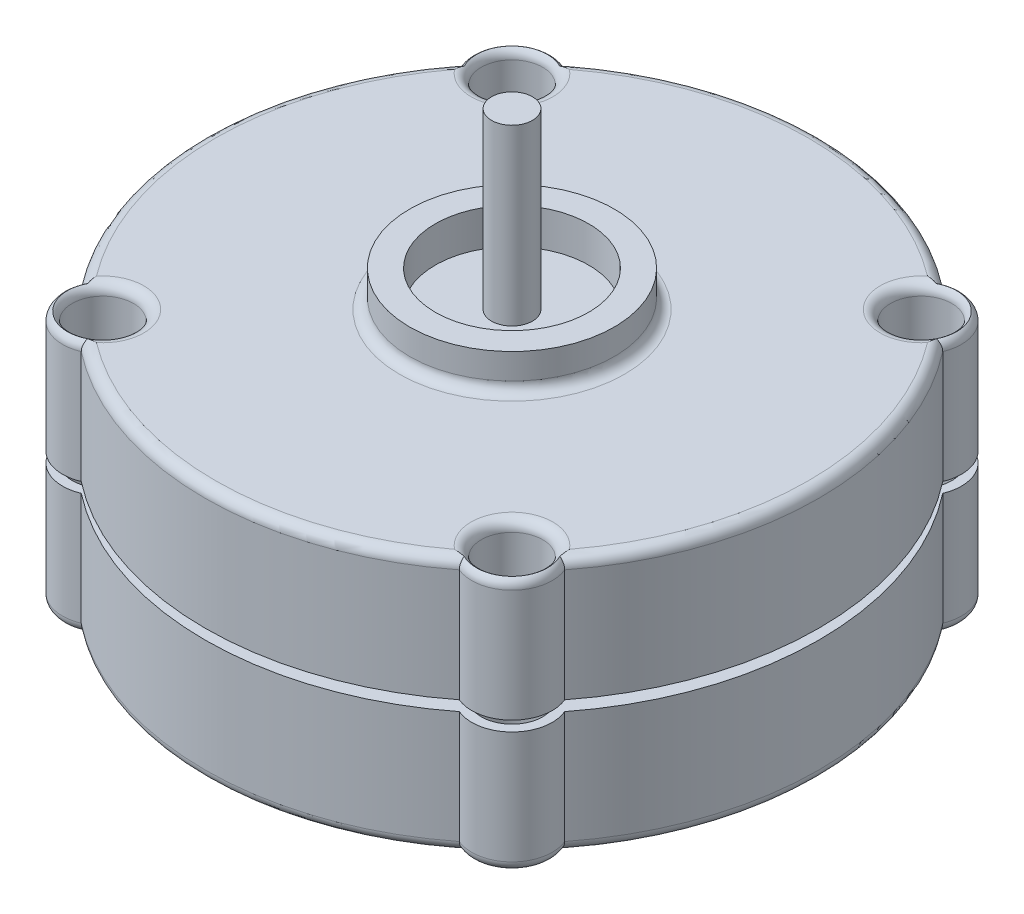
ISO-10303-21;
HEADER;
FILE_DESCRIPTION(('STEP AP214'),'2;1');
FILE_NAME('part.step','',(''),(''),'','','');
FILE_SCHEMA(('AUTOMOTIVE_DESIGN { 1 0 10303 214 1 1 1 1 }'));
ENDSEC;
DATA;
#1=APPLICATION_CONTEXT('core data for automotive mechanical design processes');
#2=APPLICATION_PROTOCOL_DEFINITION('international standard','automotive_design',2000,#1);
#3=PRODUCT_CONTEXT('',#1,'mechanical');
#4=PRODUCT('Part','Part','',(#3));
#5=PRODUCT_RELATED_PRODUCT_CATEGORY('part','',(#4));
#6=PRODUCT_DEFINITION_FORMATION('','',#4);
#7=PRODUCT_DEFINITION_CONTEXT('part definition',#1,'design');
#8=PRODUCT_DEFINITION('design','',#6,#7);
#9=PRODUCT_DEFINITION_SHAPE('','',#8);
#10=(LENGTH_UNIT() NAMED_UNIT(*) SI_UNIT(.MILLI.,.METRE.));
#11=(NAMED_UNIT(*) PLANE_ANGLE_UNIT() SI_UNIT($,.RADIAN.));
#12=(NAMED_UNIT(*) SI_UNIT($,.STERADIAN.) SOLID_ANGLE_UNIT());
#13=UNCERTAINTY_MEASURE_WITH_UNIT(LENGTH_MEASURE(1.E-05),#10,'distance_accuracy_value','');
#14=(GEOMETRIC_REPRESENTATION_CONTEXT(3) GLOBAL_UNCERTAINTY_ASSIGNED_CONTEXT((#13)) GLOBAL_UNIT_ASSIGNED_CONTEXT((#10,
#11,#12)) REPRESENTATION_CONTEXT('',''));
#15=CARTESIAN_POINT('',(0.,0.,0.));
#16=DIRECTION('',(0.,0.,1.));
#17=DIRECTION('',(1.,0.,0.));
#18=AXIS2_PLACEMENT_3D('',#15,#16,#17);
#19=CARTESIAN_POINT('',(-50.8,63.5,-50.8));
#20=DIRECTION('',(0.,-1.,0.));
#21=DIRECTION('',(0.,0.,-1.));
#22=AXIS2_PLACEMENT_3D('',#19,#20,#21);
#23=CYLINDRICAL_SURFACE('',#22,10.);
#24=DIRECTION('',(0.,-1.,0.));
#25=VECTOR('',#24,1.);
#26=CARTESIAN_POINT('',(-60.0252120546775,63.5,-46.9405359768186));
#27=LINE('',#26,#25);
#28=CARTESIAN_POINT('',(-60.0252120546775,60.96,-46.9405359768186));
#29=VERTEX_POINT('',#28);
#30=CARTESIAN_POINT('',(-60.0252120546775,33.02,-46.9405359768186));
#31=VERTEX_POINT('',#30);
#32=EDGE_CURVE('E335',#29,#31,#27,.T.);
#33=ORIENTED_EDGE('',*,*,#32,.F.);
#34=CARTESIAN_POINT('',(-50.8,60.96,-50.8));
#35=DIRECTION('',(0.,1.,0.));
#36=DIRECTION('',(0.,0.,1.));
#37=AXIS2_PLACEMENT_3D('',#34,#35,#36);
#38=CIRCLE('',#37,10.);
#39=CARTESIAN_POINT('',(-46.9405359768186,60.96,-60.0252120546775));
#40=VERTEX_POINT('',#39);
#41=EDGE_CURVE('E419',#29,#40,#38,.F.);
#42=ORIENTED_EDGE('',*,*,#41,.T.);
#43=DIRECTION('',(0.,-1.,0.));
#44=VECTOR('',#43,1.);
#45=CARTESIAN_POINT('',(-46.9405359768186,63.5,-60.0252120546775));
#46=LINE('',#45,#44);
#47=CARTESIAN_POINT('',(-46.9405359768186,33.02,-60.0252120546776));
#48=VERTEX_POINT('',#47);
#49=EDGE_CURVE('E334',#40,#48,#46,.T.);
#50=ORIENTED_EDGE('',*,*,#49,.T.);
#51=CARTESIAN_POINT('',(-50.8,33.02,-50.8));
#52=DIRECTION('',(0.,1.,0.));
#53=DIRECTION('',(0.,0.,1.));
#54=AXIS2_PLACEMENT_3D('',#51,#52,#53);
#55=CIRCLE('',#54,10.);
#56=EDGE_CURVE('E907',#48,#31,#55,.T.);
#57=ORIENTED_EDGE('',*,*,#56,.T.);
#58=EDGE_LOOP('',(#33,#42,#50,#57));
#59=FACE_BOUND('',#58,.T.);
#60=ADVANCED_FACE('F71',(#59),#23,.T.);
#61=CARTESIAN_POINT('',(0.,63.5,0.));
#62=DIRECTION('',(0.,1.,0.));
#63=DIRECTION('',(0.,0.,1.));
#64=AXIS2_PLACEMENT_3D('',#61,#62,#63);
#65=PLANE('',#64);
#66=CARTESIAN_POINT('',(0.,63.5,0.));
#67=DIRECTION('',(0.,1.,0.));
#68=DIRECTION('',(0.,0.,1.));
#69=AXIS2_PLACEMENT_3D('',#66,#67,#68);
#70=CIRCLE('',#69,27.94);
#71=CARTESIAN_POINT('',(0.,63.5,27.94));
#72=VERTEX_POINT('',#71);
#73=EDGE_CURVE('E400',#72,#72,#70,.F.);
#74=ORIENTED_EDGE('',*,*,#73,.T.);
#75=EDGE_LOOP('',(#74));
#76=FACE_BOUND('',#75,.T.);
#77=CARTESIAN_POINT('',(0.,63.5,0.));
#78=DIRECTION('',(0.,1.,0.));
#79=DIRECTION('',(0.,0.,1.));
#80=AXIS2_PLACEMENT_3D('',#77,#78,#79);
#81=CIRCLE('',#80,73.66);
#82=CARTESIAN_POINT('',(44.4535286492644,63.5,-58.7339713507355));
#83=VERTEX_POINT('',#82);
#84=CARTESIAN_POINT('',(-44.4535286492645,63.5,-58.7339713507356));
#85=VERTEX_POINT('',#84);
#86=EDGE_CURVE('E394',#83,#85,#81,.T.);
#87=ORIENTED_EDGE('',*,*,#86,.T.);
#88=CARTESIAN_POINT('',(-50.8,63.5,-50.8));
#89=DIRECTION('',(0.,1.,0.));
#90=DIRECTION('',(0.,0.,1.));
#91=AXIS2_PLACEMENT_3D('',#88,#89,#90);
#92=CIRCLE('',#91,10.16);
#93=CARTESIAN_POINT('',(-58.7339713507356,63.5,-44.4535286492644));
#94=VERTEX_POINT('',#93);
#95=EDGE_CURVE('E397',#85,#94,#92,.F.);
#96=ORIENTED_EDGE('',*,*,#95,.T.);
#97=CARTESIAN_POINT('',(0.,63.5,0.));
#98=DIRECTION('',(0.,1.,0.));
#99=DIRECTION('',(0.,0.,1.));
#100=AXIS2_PLACEMENT_3D('',#97,#98,#99);
#101=CIRCLE('',#100,73.66);
#102=CARTESIAN_POINT('',(-58.7339713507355,63.5,44.4535286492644));
#103=VERTEX_POINT('',#102);
#104=EDGE_CURVE('E391',#94,#103,#101,.T.);
#105=ORIENTED_EDGE('',*,*,#104,.T.);
#106=CARTESIAN_POINT('',(-50.8,63.5,50.8));
#107=DIRECTION('',(0.,1.,0.));
#108=DIRECTION('',(0.,0.,1.));
#109=AXIS2_PLACEMENT_3D('',#106,#107,#108);
#110=CIRCLE('',#109,10.16);
#111=CARTESIAN_POINT('',(-44.4535286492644,63.5,58.7339713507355));
#112=VERTEX_POINT('',#111);
#113=EDGE_CURVE('E385',#103,#112,#110,.F.);
#114=ORIENTED_EDGE('',*,*,#113,.T.);
#115=CARTESIAN_POINT('',(0.,63.5,0.));
#116=DIRECTION('',(0.,1.,0.));
#117=DIRECTION('',(0.,0.,1.));
#118=AXIS2_PLACEMENT_3D('',#115,#116,#117);
#119=CIRCLE('',#118,73.66);
#120=CARTESIAN_POINT('',(44.4535286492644,63.5,58.7339713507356));
#121=VERTEX_POINT('',#120);
#122=EDGE_CURVE('E379',#112,#121,#119,.T.);
#123=ORIENTED_EDGE('',*,*,#122,.T.);
#124=CARTESIAN_POINT('',(50.8,63.5,50.8));
#125=DIRECTION('',(0.,1.,0.));
#126=DIRECTION('',(0.,0.,1.));
#127=AXIS2_PLACEMENT_3D('',#124,#125,#126);
#128=CIRCLE('',#127,10.16);
#129=CARTESIAN_POINT('',(58.7339713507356,63.5,44.4535286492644));
#130=VERTEX_POINT('',#129);
#131=EDGE_CURVE('E178',#121,#130,#128,.F.);
#132=ORIENTED_EDGE('',*,*,#131,.T.);
#133=CARTESIAN_POINT('',(0.,63.5,0.));
#134=DIRECTION('',(0.,1.,0.));
#135=DIRECTION('',(0.,0.,1.));
#136=AXIS2_PLACEMENT_3D('',#133,#134,#135);
#137=CIRCLE('',#136,73.66);
#138=CARTESIAN_POINT('',(58.7339713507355,63.5,-44.4535286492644));
#139=VERTEX_POINT('',#138);
#140=EDGE_CURVE('E382',#130,#139,#137,.T.);
#141=ORIENTED_EDGE('',*,*,#140,.T.);
#142=CARTESIAN_POINT('',(50.8,63.5,-50.8));
#143=DIRECTION('',(0.,1.,0.));
#144=DIRECTION('',(0.,0.,1.));
#145=AXIS2_PLACEMENT_3D('',#142,#143,#144);
#146=CIRCLE('',#145,10.16);
#147=EDGE_CURVE('E388',#139,#83,#146,.F.);
#148=ORIENTED_EDGE('',*,*,#147,.T.);
#149=EDGE_LOOP('',(#87,#96,#105,#114,#123,#132,#141,#148));
#150=FACE_BOUND('',#149,.T.);
#151=ADVANCED_FACE('F285',(#76,#150),#65,.T.);
#152=CARTESIAN_POINT('',(50.8,63.5,50.8));
#153=DIRECTION('',(0.,-1.,0.));
#154=DIRECTION('',(0.,0.,-1.));
#155=AXIS2_PLACEMENT_3D('',#152,#153,#154);
#156=CYLINDRICAL_SURFACE('',#155,10.);
#157=DIRECTION('',(0.,-1.,0.));
#158=VECTOR('',#157,1.);
#159=CARTESIAN_POINT('',(60.0252120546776,63.5,46.9405359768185));
#160=LINE('',#159,#158);
#161=CARTESIAN_POINT('',(60.0252120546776,60.96,46.9405359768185));
#162=VERTEX_POINT('',#161);
#163=CARTESIAN_POINT('',(60.0252120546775,33.02,46.9405359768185));
#164=VERTEX_POINT('',#163);
#165=EDGE_CURVE('E868',#162,#164,#160,.T.);
#166=ORIENTED_EDGE('',*,*,#165,.F.);
#167=CARTESIAN_POINT('',(50.8,60.96,50.8));
#168=DIRECTION('',(0.,1.,0.));
#169=DIRECTION('',(0.,0.,1.));
#170=AXIS2_PLACEMENT_3D('',#167,#168,#169);
#171=CIRCLE('',#170,10.);
#172=CARTESIAN_POINT('',(46.9405359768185,60.96,60.0252120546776));
#173=VERTEX_POINT('',#172);
#174=EDGE_CURVE('E412',#162,#173,#171,.F.);
#175=ORIENTED_EDGE('',*,*,#174,.T.);
#176=DIRECTION('',(0.,-1.,0.));
#177=VECTOR('',#176,1.);
#178=CARTESIAN_POINT('',(46.9405359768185,63.5,60.0252120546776));
#179=LINE('',#178,#177);
#180=CARTESIAN_POINT('',(46.9405359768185,33.02,60.0252120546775));
#181=VERTEX_POINT('',#180);
#182=EDGE_CURVE('E670',#173,#181,#179,.T.);
#183=ORIENTED_EDGE('',*,*,#182,.T.);
#184=CARTESIAN_POINT('',(50.8,33.02,50.8));
#185=DIRECTION('',(0.,1.,0.));
#186=DIRECTION('',(0.,0.,1.));
#187=AXIS2_PLACEMENT_3D('',#184,#185,#186);
#188=CIRCLE('',#187,10.);
#189=EDGE_CURVE('E913',#181,#164,#188,.T.);
#190=ORIENTED_EDGE('',*,*,#189,.T.);
#191=EDGE_LOOP('',(#166,#175,#183,#190));
#192=FACE_BOUND('',#191,.T.);
#193=ADVANCED_FACE('F292',(#192),#156,.T.);
#194=CARTESIAN_POINT('',(-50.8,63.5,50.8));
#195=DIRECTION('',(0.,-1.,0.));
#196=DIRECTION('',(0.,0.,-1.));
#197=AXIS2_PLACEMENT_3D('',#194,#195,#196);
#198=CYLINDRICAL_SURFACE('',#197,10.);
#199=DIRECTION('',(0.,-1.,0.));
#200=VECTOR('',#199,1.);
#201=CARTESIAN_POINT('',(-46.9405359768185,63.5,60.0252120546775));
#202=LINE('',#201,#200);
#203=CARTESIAN_POINT('',(-46.9405359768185,60.96,60.0252120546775));
#204=VERTEX_POINT('',#203);
#205=CARTESIAN_POINT('',(-46.9405359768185,33.02,60.0252120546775));
#206=VERTEX_POINT('',#205);
#207=EDGE_CURVE('E667',#204,#206,#202,.T.);
#208=ORIENTED_EDGE('',*,*,#207,.F.);
#209=CARTESIAN_POINT('',(-50.8,60.96,50.8));
#210=DIRECTION('',(0.,1.,0.));
#211=DIRECTION('',(0.,0.,1.));
#212=AXIS2_PLACEMENT_3D('',#209,#210,#211);
#213=CIRCLE('',#212,10.);
#214=CARTESIAN_POINT('',(-60.0252120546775,60.96,46.9405359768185));
#215=VERTEX_POINT('',#214);
#216=EDGE_CURVE('E416',#204,#215,#213,.F.);
#217=ORIENTED_EDGE('',*,*,#216,.T.);
#218=DIRECTION('',(0.,-1.,0.));
#219=VECTOR('',#218,1.);
#220=CARTESIAN_POINT('',(-60.0252120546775,63.5,46.9405359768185));
#221=LINE('',#220,#219);
#222=CARTESIAN_POINT('',(-60.0252120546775,33.02,46.9405359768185));
#223=VERTEX_POINT('',#222);
#224=EDGE_CURVE('E869',#215,#223,#221,.T.);
#225=ORIENTED_EDGE('',*,*,#224,.T.);
#226=CARTESIAN_POINT('',(-50.8,33.02,50.8));
#227=DIRECTION('',(0.,1.,0.));
#228=DIRECTION('',(0.,0.,1.));
#229=AXIS2_PLACEMENT_3D('',#226,#227,#228);
#230=CIRCLE('',#229,10.);
#231=EDGE_CURVE('E676',#223,#206,#230,.T.);
#232=ORIENTED_EDGE('',*,*,#231,.T.);
#233=EDGE_LOOP('',(#208,#217,#225,#232));
#234=FACE_BOUND('',#233,.T.);
#235=ADVANCED_FACE('F672',(#234),#198,.T.);
#236=CARTESIAN_POINT('',(50.8,63.5,-50.8));
#237=DIRECTION('',(0.,-1.,0.));
#238=DIRECTION('',(0.,0.,-1.));
#239=AXIS2_PLACEMENT_3D('',#236,#237,#238);
#240=CYLINDRICAL_SURFACE('',#239,10.);
#241=DIRECTION('',(0.,-1.,0.));
#242=VECTOR('',#241,1.);
#243=CARTESIAN_POINT('',(46.9405359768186,63.5,-60.0252120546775));
#244=LINE('',#243,#242);
#245=CARTESIAN_POINT('',(46.9405359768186,60.96,-60.0252120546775));
#246=VERTEX_POINT('',#245);
#247=CARTESIAN_POINT('',(46.9405359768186,33.02,-60.0252120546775));
#248=VERTEX_POINT('',#247);
#249=EDGE_CURVE('E715',#246,#248,#244,.T.);
#250=ORIENTED_EDGE('',*,*,#249,.F.);
#251=CARTESIAN_POINT('',(50.8,60.96,-50.8));
#252=DIRECTION('',(0.,1.,0.));
#253=DIRECTION('',(0.,0.,1.));
#254=AXIS2_PLACEMENT_3D('',#251,#252,#253);
#255=CIRCLE('',#254,10.);
#256=CARTESIAN_POINT('',(60.0252120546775,60.96,-46.9405359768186));
#257=VERTEX_POINT('',#256);
#258=EDGE_CURVE('E406',#246,#257,#255,.F.);
#259=ORIENTED_EDGE('',*,*,#258,.T.);
#260=DIRECTION('',(0.,-1.,0.));
#261=VECTOR('',#260,1.);
#262=CARTESIAN_POINT('',(60.0252120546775,63.5,-46.9405359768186));
#263=LINE('',#262,#261);
#264=CARTESIAN_POINT('',(60.0252120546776,33.02,-46.9405359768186));
#265=VERTEX_POINT('',#264);
#266=EDGE_CURVE('E713',#257,#265,#263,.T.);
#267=ORIENTED_EDGE('',*,*,#266,.T.);
#268=CARTESIAN_POINT('',(50.8,33.02,-50.8));
#269=DIRECTION('',(0.,1.,0.));
#270=DIRECTION('',(0.,0.,1.));
#271=AXIS2_PLACEMENT_3D('',#268,#269,#270);
#272=CIRCLE('',#271,10.);
#273=EDGE_CURVE('E911',#265,#248,#272,.T.);
#274=ORIENTED_EDGE('',*,*,#273,.T.);
#275=EDGE_LOOP('',(#250,#259,#267,#274));
#276=FACE_BOUND('',#275,.T.);
#277=ADVANCED_FACE('F710',(#276),#240,.T.);
#278=CARTESIAN_POINT('',(0.,63.5,0.));
#279=DIRECTION('',(0.,-1.,0.));
#280=DIRECTION('',(0.,0.,-1.));
#281=AXIS2_PLACEMENT_3D('',#278,#279,#280);
#282=CYLINDRICAL_SURFACE('',#281,76.2);
#283=ORIENTED_EDGE('',*,*,#182,.F.);
#284=CARTESIAN_POINT('',(0.,60.96,0.));
#285=DIRECTION('',(0.,1.,0.));
#286=DIRECTION('',(0.,0.,1.));
#287=AXIS2_PLACEMENT_3D('',#284,#285,#286);
#288=CIRCLE('',#287,76.2);
#289=EDGE_CURVE('E164',#173,#204,#288,.F.);
#290=ORIENTED_EDGE('',*,*,#289,.T.);
#291=ORIENTED_EDGE('',*,*,#207,.T.);
#292=CARTESIAN_POINT('',(0.,33.02,0.));
#293=DIRECTION('',(0.,1.,0.));
#294=DIRECTION('',(0.,0.,1.));
#295=AXIS2_PLACEMENT_3D('',#292,#293,#294);
#296=CIRCLE('',#295,76.2);
#297=EDGE_CURVE('E910',#206,#181,#296,.T.);
#298=ORIENTED_EDGE('',*,*,#297,.T.);
#299=EDGE_LOOP('',(#283,#290,#291,#298));
#300=FACE_BOUND('',#299,.T.);
#301=ADVANCED_FACE('F664',(#300),#282,.T.);
#302=ORIENTED_EDGE('',*,*,#266,.F.);
#303=CARTESIAN_POINT('',(0.,60.96,0.));
#304=DIRECTION('',(0.,1.,0.));
#305=DIRECTION('',(0.,0.,1.));
#306=AXIS2_PLACEMENT_3D('',#303,#304,#305);
#307=CIRCLE('',#306,76.2);
#308=EDGE_CURVE('E409',#257,#162,#307,.F.);
#309=ORIENTED_EDGE('',*,*,#308,.T.);
#310=ORIENTED_EDGE('',*,*,#165,.T.);
#311=CARTESIAN_POINT('',(0.,33.02,0.));
#312=DIRECTION('',(0.,1.,0.));
#313=DIRECTION('',(0.,0.,1.));
#314=AXIS2_PLACEMENT_3D('',#311,#312,#313);
#315=CIRCLE('',#314,76.2);
#316=EDGE_CURVE('E722',#164,#265,#315,.T.);
#317=ORIENTED_EDGE('',*,*,#316,.T.);
#318=EDGE_LOOP('',(#302,#309,#310,#317));
#319=FACE_BOUND('',#318,.T.);
#320=ADVANCED_FACE('F718',(#319),#282,.T.);
#321=ORIENTED_EDGE('',*,*,#49,.F.);
#322=CARTESIAN_POINT('',(0.,60.96,0.));
#323=DIRECTION('',(0.,1.,0.));
#324=DIRECTION('',(0.,0.,1.));
#325=AXIS2_PLACEMENT_3D('',#322,#323,#324);
#326=CIRCLE('',#325,76.2);
#327=EDGE_CURVE('E403',#40,#246,#326,.F.);
#328=ORIENTED_EDGE('',*,*,#327,.T.);
#329=ORIENTED_EDGE('',*,*,#249,.T.);
#330=CARTESIAN_POINT('',(0.,33.02,0.));
#331=DIRECTION('',(0.,1.,0.));
#332=DIRECTION('',(0.,0.,1.));
#333=AXIS2_PLACEMENT_3D('',#330,#331,#332);
#334=CIRCLE('',#333,76.2);
#335=EDGE_CURVE('E703',#248,#48,#334,.T.);
#336=ORIENTED_EDGE('',*,*,#335,.T.);
#337=EDGE_LOOP('',(#321,#328,#329,#336));
#338=FACE_BOUND('',#337,.T.);
#339=ADVANCED_FACE('F699',(#338),#282,.T.);
#340=ORIENTED_EDGE('',*,*,#224,.F.);
#341=CARTESIAN_POINT('',(0.,60.96,0.));
#342=DIRECTION('',(0.,1.,0.));
#343=DIRECTION('',(0.,0.,1.));
#344=AXIS2_PLACEMENT_3D('',#341,#342,#343);
#345=CIRCLE('',#344,76.2);
#346=EDGE_CURVE('E95',#215,#29,#345,.F.);
#347=ORIENTED_EDGE('',*,*,#346,.T.);
#348=ORIENTED_EDGE('',*,*,#32,.T.);
#349=CARTESIAN_POINT('',(0.,33.02,0.));
#350=DIRECTION('',(0.,1.,0.));
#351=DIRECTION('',(0.,0.,1.));
#352=AXIS2_PLACEMENT_3D('',#349,#350,#351);
#353=CIRCLE('',#352,76.2);
#354=EDGE_CURVE('E903',#31,#223,#353,.T.);
#355=ORIENTED_EDGE('',*,*,#354,.T.);
#356=EDGE_LOOP('',(#340,#347,#348,#355));
#357=FACE_BOUND('',#356,.T.);
#358=ADVANCED_FACE('F296',(#357),#282,.T.);
#359=CARTESIAN_POINT('',(0.,-8.89,0.));
#360=DIRECTION('',(0.,1.,0.));
#361=DIRECTION('',(0.,0.,1.));
#362=AXIS2_PLACEMENT_3D('',#359,#360,#361);
#363=CYLINDRICAL_SURFACE('',#362,25.4);
#364=CARTESIAN_POINT('',(0.,66.04,0.));
#365=DIRECTION('',(0.,1.,0.));
#366=DIRECTION('',(0.,0.,1.));
#367=AXIS2_PLACEMENT_3D('',#364,#365,#366);
#368=CIRCLE('',#367,25.4);
#369=CARTESIAN_POINT('',(0.,66.04,25.4));
#370=VERTEX_POINT('',#369);
#371=EDGE_CURVE('E422',#370,#370,#368,.T.);
#372=ORIENTED_EDGE('',*,*,#371,.T.);
#373=EDGE_LOOP('',(#372));
#374=FACE_BOUND('',#373,.T.);
#375=CARTESIAN_POINT('',(0.,72.39,0.));
#376=DIRECTION('',(0.,1.,0.));
#377=DIRECTION('',(0.,0.,1.));
#378=AXIS2_PLACEMENT_3D('',#375,#376,#377);
#379=CIRCLE('',#378,25.4);
#380=CARTESIAN_POINT('',(0.,72.39,25.4));
#381=VERTEX_POINT('',#380);
#382=EDGE_CURVE('E954',#381,#381,#379,.T.);
#383=ORIENTED_EDGE('',*,*,#382,.F.);
#384=EDGE_LOOP('',(#383));
#385=FACE_BOUND('',#384,.T.);
#386=ADVANCED_FACE('F1108',(#374,#385),#363,.T.);
#387=CARTESIAN_POINT('',(0.,72.39,0.));
#388=DIRECTION('',(0.,1.,0.));
#389=DIRECTION('',(0.,0.,1.));
#390=AXIS2_PLACEMENT_3D('',#387,#388,#389);
#391=PLANE('',#390);
#392=ORIENTED_EDGE('',*,*,#382,.T.);
#393=EDGE_LOOP('',(#392));
#394=FACE_BOUND('',#393,.T.);
#395=CARTESIAN_POINT('',(0.,72.39,0.));
#396=DIRECTION('',(0.,1.,0.));
#397=DIRECTION('',(0.,0.,1.));
#398=AXIS2_PLACEMENT_3D('',#395,#396,#397);
#399=CIRCLE('',#398,19.05);
#400=CARTESIAN_POINT('',(0.,72.39,19.05));
#401=VERTEX_POINT('',#400);
#402=EDGE_CURVE('E949',#401,#401,#399,.T.);
#403=ORIENTED_EDGE('',*,*,#402,.F.);
#404=EDGE_LOOP('',(#403));
#405=FACE_BOUND('',#404,.T.);
#406=ADVANCED_FACE('F1104',(#394,#405),#391,.T.);
#407=CARTESIAN_POINT('',(0.,-8.89,0.));
#408=DIRECTION('',(0.,1.,0.));
#409=DIRECTION('',(0.,0.,1.));
#410=AXIS2_PLACEMENT_3D('',#407,#408,#409);
#411=CYLINDRICAL_SURFACE('',#410,19.05);
#412=CARTESIAN_POINT('',(0.,63.5,0.));
#413=DIRECTION('',(0.,1.,0.));
#414=DIRECTION('',(0.,0.,1.));
#415=AXIS2_PLACEMENT_3D('',#412,#413,#414);
#416=CIRCLE('',#415,19.05);
#417=CARTESIAN_POINT('',(0.,63.5,19.05));
#418=VERTEX_POINT('',#417);
#419=EDGE_CURVE('E764',#418,#418,#416,.T.);
#420=ORIENTED_EDGE('',*,*,#419,.F.);
#421=EDGE_LOOP('',(#420));
#422=FACE_BOUND('',#421,.T.);
#423=ORIENTED_EDGE('',*,*,#402,.T.);
#424=EDGE_LOOP('',(#423));
#425=FACE_BOUND('',#424,.T.);
#426=ADVANCED_FACE('F1107',(#422,#425),#411,.F.);
#427=CARTESIAN_POINT('',(0.,63.5,0.));
#428=DIRECTION('',(0.,1.,0.));
#429=DIRECTION('',(0.,0.,1.));
#430=AXIS2_PLACEMENT_3D('',#427,#428,#429);
#431=CIRCLE('',#430,5.08);
#432=CARTESIAN_POINT('',(0.,63.5,5.08));
#433=VERTEX_POINT('',#432);
#434=EDGE_CURVE('E945',#433,#433,#431,.T.);
#435=ORIENTED_EDGE('',*,*,#434,.F.);
#436=EDGE_LOOP('',(#435));
#437=FACE_BOUND('',#436,.T.);
#438=ORIENTED_EDGE('',*,*,#419,.T.);
#439=EDGE_LOOP('',(#438));
#440=FACE_BOUND('',#439,.T.);
#441=ADVANCED_FACE('F295',(#437,#440),#65,.T.);
#442=CARTESIAN_POINT('',(0.,106.68,0.));
#443=DIRECTION('',(0.,-1.,0.));
#444=DIRECTION('',(0.,0.,-1.));
#445=AXIS2_PLACEMENT_3D('',#442,#443,#444);
#446=CYLINDRICAL_SURFACE('',#445,5.08);
#447=CARTESIAN_POINT('',(0.,106.68,0.));
#448=DIRECTION('',(0.,1.,0.));
#449=DIRECTION('',(0.,0.,1.));
#450=AXIS2_PLACEMENT_3D('',#447,#448,#449);
#451=CIRCLE('',#450,5.08);
#452=CARTESIAN_POINT('',(0.,106.68,5.08));
#453=VERTEX_POINT('',#452);
#454=EDGE_CURVE('E946',#453,#453,#451,.T.);
#455=ORIENTED_EDGE('',*,*,#454,.F.);
#456=EDGE_LOOP('',(#455));
#457=FACE_BOUND('',#456,.T.);
#458=ORIENTED_EDGE('',*,*,#434,.T.);
#459=EDGE_LOOP('',(#458));
#460=FACE_BOUND('',#459,.T.);
#461=ADVANCED_FACE('F1099',(#457,#460),#446,.T.);
#462=CARTESIAN_POINT('',(0.,106.68,0.));
#463=DIRECTION('',(0.,1.,0.));
#464=DIRECTION('',(0.,0.,1.));
#465=AXIS2_PLACEMENT_3D('',#462,#463,#464);
#466=PLANE('',#465);
#467=ORIENTED_EDGE('',*,*,#454,.T.);
#468=EDGE_LOOP('',(#467));
#469=FACE_BOUND('',#468,.T.);
#470=ADVANCED_FACE('F1095',(#469),#466,.T.);
#471=CARTESIAN_POINT('',(50.8,-8.89,-50.8));
#472=DIRECTION('',(0.,1.,0.));
#473=DIRECTION('',(0.,0.,1.));
#474=AXIS2_PLACEMENT_3D('',#471,#472,#473);
#475=CYLINDRICAL_SURFACE('',#474,7.62);
#476=CARTESIAN_POINT('',(50.8,60.96,-50.8));
#477=DIRECTION('',(0.,1.,0.));
#478=DIRECTION('',(0.,0.,1.));
#479=AXIS2_PLACEMENT_3D('',#476,#477,#478);
#480=CIRCLE('',#479,7.62);
#481=CARTESIAN_POINT('',(50.8,60.96,-43.18));
#482=VERTEX_POINT('',#481);
#483=EDGE_CURVE('E425',#482,#482,#480,.T.);
#484=ORIENTED_EDGE('',*,*,#483,.T.);
#485=EDGE_LOOP('',(#484));
#486=FACE_BOUND('',#485,.T.);
#487=CARTESIAN_POINT('',(50.8,33.02,-50.8));
#488=DIRECTION('',(0.,1.,0.));
#489=DIRECTION('',(0.,0.,1.));
#490=AXIS2_PLACEMENT_3D('',#487,#488,#489);
#491=CIRCLE('',#490,7.62);
#492=CARTESIAN_POINT('',(45.4118463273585,33.02,-45.4118463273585));
#493=VERTEX_POINT('',#492);
#494=EDGE_CURVE('E900',#493,#493,#491,.F.);
#495=ORIENTED_EDGE('',*,*,#494,.T.);
#496=EDGE_LOOP('',(#495));
#497=FACE_BOUND('',#496,.T.);
#498=ADVANCED_FACE('F310',(#486,#497),#475,.F.);
#499=CARTESIAN_POINT('',(-50.8,-8.89,-50.8));
#500=DIRECTION('',(0.,1.,0.));
#501=DIRECTION('',(0.,0.,1.));
#502=AXIS2_PLACEMENT_3D('',#499,#500,#501);
#503=CYLINDRICAL_SURFACE('',#502,7.62);
#504=CARTESIAN_POINT('',(-50.8,60.96,-50.8));
#505=DIRECTION('',(0.,1.,0.));
#506=DIRECTION('',(0.,0.,1.));
#507=AXIS2_PLACEMENT_3D('',#504,#505,#506);
#508=CIRCLE('',#507,7.62);
#509=CARTESIAN_POINT('',(-50.8,60.96,-43.18));
#510=VERTEX_POINT('',#509);
#511=EDGE_CURVE('E428',#510,#510,#508,.T.);
#512=ORIENTED_EDGE('',*,*,#511,.T.);
#513=EDGE_LOOP('',(#512));
#514=FACE_BOUND('',#513,.T.);
#515=CARTESIAN_POINT('',(-50.8,33.02,-50.8));
#516=DIRECTION('',(0.,1.,0.));
#517=DIRECTION('',(0.,0.,1.));
#518=AXIS2_PLACEMENT_3D('',#515,#516,#517);
#519=CIRCLE('',#518,7.62);
#520=CARTESIAN_POINT('',(-45.4118463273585,33.02,-45.4118463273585));
#521=VERTEX_POINT('',#520);
#522=EDGE_CURVE('E897',#521,#521,#519,.F.);
#523=ORIENTED_EDGE('',*,*,#522,.T.);
#524=EDGE_LOOP('',(#523));
#525=FACE_BOUND('',#524,.T.);
#526=ADVANCED_FACE('F1065',(#514,#525),#503,.F.);
#527=CARTESIAN_POINT('',(-50.8,-8.89,50.8));
#528=DIRECTION('',(0.,1.,0.));
#529=DIRECTION('',(0.,0.,1.));
#530=AXIS2_PLACEMENT_3D('',#527,#528,#529);
#531=CYLINDRICAL_SURFACE('',#530,7.62);
#532=CARTESIAN_POINT('',(-50.8,60.96,50.8));
#533=DIRECTION('',(0.,1.,0.));
#534=DIRECTION('',(0.,0.,1.));
#535=AXIS2_PLACEMENT_3D('',#532,#533,#534);
#536=CIRCLE('',#535,7.62);
#537=CARTESIAN_POINT('',(-50.8,60.96,58.42));
#538=VERTEX_POINT('',#537);
#539=EDGE_CURVE('E86',#538,#538,#536,.T.);
#540=ORIENTED_EDGE('',*,*,#539,.T.);
#541=EDGE_LOOP('',(#540));
#542=FACE_BOUND('',#541,.T.);
#543=CARTESIAN_POINT('',(-50.8,33.02,50.8));
#544=DIRECTION('',(0.,1.,0.));
#545=DIRECTION('',(0.,0.,1.));
#546=AXIS2_PLACEMENT_3D('',#543,#544,#545);
#547=CIRCLE('',#546,7.62);
#548=CARTESIAN_POINT('',(-45.4118463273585,33.02,45.4118463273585));
#549=VERTEX_POINT('',#548);
#550=EDGE_CURVE('E889',#549,#549,#547,.F.);
#551=ORIENTED_EDGE('',*,*,#550,.T.);
#552=EDGE_LOOP('',(#551));
#553=FACE_BOUND('',#552,.T.);
#554=ADVANCED_FACE('F746',(#542,#553),#531,.F.);
#555=CARTESIAN_POINT('',(50.8,-8.89,50.8));
#556=DIRECTION('',(0.,1.,0.));
#557=DIRECTION('',(0.,0.,1.));
#558=AXIS2_PLACEMENT_3D('',#555,#556,#557);
#559=CYLINDRICAL_SURFACE('',#558,7.62);
#560=CARTESIAN_POINT('',(50.8,60.96,50.8));
#561=DIRECTION('',(0.,1.,0.));
#562=DIRECTION('',(0.,0.,1.));
#563=AXIS2_PLACEMENT_3D('',#560,#561,#562);
#564=CIRCLE('',#563,7.62);
#565=CARTESIAN_POINT('',(50.8,60.96,58.42));
#566=VERTEX_POINT('',#565);
#567=EDGE_CURVE('E12',#566,#566,#564,.T.);
#568=ORIENTED_EDGE('',*,*,#567,.T.);
#569=EDGE_LOOP('',(#568));
#570=FACE_BOUND('',#569,.T.);
#571=CARTESIAN_POINT('',(50.8,33.02,50.8));
#572=DIRECTION('',(0.,1.,0.));
#573=DIRECTION('',(0.,0.,1.));
#574=AXIS2_PLACEMENT_3D('',#571,#572,#573);
#575=CIRCLE('',#574,7.62);
#576=CARTESIAN_POINT('',(45.4118463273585,33.02,45.4118463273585));
#577=VERTEX_POINT('',#576);
#578=EDGE_CURVE('E704',#577,#577,#575,.F.);
#579=ORIENTED_EDGE('',*,*,#578,.T.);
#580=EDGE_LOOP('',(#579));
#581=FACE_BOUND('',#580,.T.);
#582=ADVANCED_FACE('F742',(#570,#581),#559,.F.);
#583=CARTESIAN_POINT('',(0.,30.48,0.));
#584=DIRECTION('',(0.,1.,0.));
#585=DIRECTION('',(0.,0.,1.));
#586=AXIS2_PLACEMENT_3D('',#583,#584,#585);
#587=PLANE('',#586);
#588=CARTESIAN_POINT('',(0.,30.48,0.));
#589=DIRECTION('',(0.,1.,0.));
#590=DIRECTION('',(0.,0.,1.));
#591=AXIS2_PLACEMENT_3D('',#588,#589,#590);
#592=CIRCLE('',#591,64.2220489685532);
#593=CARTESIAN_POINT('',(45.4118463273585,30.48,45.4118463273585));
#594=VERTEX_POINT('',#593);
#595=CARTESIAN_POINT('',(45.4118463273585,30.48,-45.4118463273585));
#596=VERTEX_POINT('',#595);
#597=EDGE_CURVE('E886',#594,#596,#592,.T.);
#598=ORIENTED_EDGE('',*,*,#597,.F.);
#599=CARTESIAN_POINT('',(50.8,30.48,50.8));
#600=DIRECTION('',(0.,1.,0.));
#601=DIRECTION('',(0.,0.,1.));
#602=AXIS2_PLACEMENT_3D('',#599,#600,#601);
#603=CIRCLE('',#602,7.62);
#604=EDGE_CURVE('E758',#594,#594,#603,.F.);
#605=ORIENTED_EDGE('',*,*,#604,.T.);
#606=CARTESIAN_POINT('',(-45.4118463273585,30.48,45.4118463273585));
#607=VERTEX_POINT('',#606);
#608=EDGE_CURVE('E891',#607,#594,#592,.T.);
#609=ORIENTED_EDGE('',*,*,#608,.F.);
#610=CARTESIAN_POINT('',(-50.8,30.48,50.8));
#611=DIRECTION('',(0.,1.,0.));
#612=DIRECTION('',(0.,0.,1.));
#613=AXIS2_PLACEMENT_3D('',#610,#611,#612);
#614=CIRCLE('',#613,7.62);
#615=EDGE_CURVE('E918',#607,#607,#614,.F.);
#616=ORIENTED_EDGE('',*,*,#615,.T.);
#617=CARTESIAN_POINT('',(-45.4118463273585,30.48,-45.4118463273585));
#618=VERTEX_POINT('',#617);
#619=EDGE_CURVE('E1071',#618,#607,#592,.T.);
#620=ORIENTED_EDGE('',*,*,#619,.F.);
#621=CARTESIAN_POINT('',(-50.8,30.48,-50.8));
#622=DIRECTION('',(0.,1.,0.));
#623=DIRECTION('',(0.,0.,1.));
#624=AXIS2_PLACEMENT_3D('',#621,#622,#623);
#625=CIRCLE('',#624,7.62);
#626=EDGE_CURVE('E921',#618,#618,#625,.F.);
#627=ORIENTED_EDGE('',*,*,#626,.T.);
#628=EDGE_CURVE('E890',#596,#618,#592,.T.);
#629=ORIENTED_EDGE('',*,*,#628,.F.);
#630=CARTESIAN_POINT('',(50.8,30.48,-50.8));
#631=DIRECTION('',(0.,1.,0.));
#632=DIRECTION('',(0.,0.,1.));
#633=AXIS2_PLACEMENT_3D('',#630,#631,#632);
#634=CIRCLE('',#633,7.62);
#635=EDGE_CURVE('E924',#596,#596,#634,.F.);
#636=ORIENTED_EDGE('',*,*,#635,.T.);
#637=EDGE_LOOP('',(#598,#605,#609,#616,#620,#627,#629,#636));
#638=FACE_BOUND('',#637,.T.);
#639=CARTESIAN_POINT('',(0.,30.48,0.));
#640=DIRECTION('',(0.,1.,0.));
#641=DIRECTION('',(0.,0.,1.));
#642=AXIS2_PLACEMENT_3D('',#639,#640,#641);
#643=CIRCLE('',#642,76.2);
#644=CARTESIAN_POINT('',(60.0252120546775,30.48,46.9405359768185));
#645=VERTEX_POINT('',#644);
#646=CARTESIAN_POINT('',(60.0252120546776,30.48,-46.9405359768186));
#647=VERTEX_POINT('',#646);
#648=EDGE_CURVE('E867',#645,#647,#643,.T.);
#649=ORIENTED_EDGE('',*,*,#648,.T.);
#650=CARTESIAN_POINT('',(50.8,30.48,-50.8));
#651=DIRECTION('',(0.,1.,0.));
#652=DIRECTION('',(0.,0.,1.));
#653=AXIS2_PLACEMENT_3D('',#650,#651,#652);
#654=CIRCLE('',#653,10.);
#655=CARTESIAN_POINT('',(46.9405359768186,30.48,-60.0252120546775));
#656=VERTEX_POINT('',#655);
#657=EDGE_CURVE('E936',#647,#656,#654,.T.);
#658=ORIENTED_EDGE('',*,*,#657,.T.);
#659=CARTESIAN_POINT('',(0.,30.48,0.));
#660=DIRECTION('',(0.,1.,0.));
#661=DIRECTION('',(0.,0.,1.));
#662=AXIS2_PLACEMENT_3D('',#659,#660,#661);
#663=CIRCLE('',#662,76.2);
#664=CARTESIAN_POINT('',(-46.9405359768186,30.48,-60.0252120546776));
#665=VERTEX_POINT('',#664);
#666=EDGE_CURVE('E826',#656,#665,#663,.T.);
#667=ORIENTED_EDGE('',*,*,#666,.T.);
#668=CARTESIAN_POINT('',(-50.8,30.48,-50.8));
#669=DIRECTION('',(0.,1.,0.));
#670=DIRECTION('',(0.,0.,1.));
#671=AXIS2_PLACEMENT_3D('',#668,#669,#670);
#672=CIRCLE('',#671,10.);
#673=CARTESIAN_POINT('',(-60.0252120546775,30.48,-46.9405359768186));
#674=VERTEX_POINT('',#673);
#675=EDGE_CURVE('E328',#665,#674,#672,.T.);
#676=ORIENTED_EDGE('',*,*,#675,.T.);
#677=CARTESIAN_POINT('',(0.,30.48,0.));
#678=DIRECTION('',(0.,1.,0.));
#679=DIRECTION('',(0.,0.,1.));
#680=AXIS2_PLACEMENT_3D('',#677,#678,#679);
#681=CIRCLE('',#680,76.2);
#682=CARTESIAN_POINT('',(-60.0252120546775,30.48,46.9405359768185));
#683=VERTEX_POINT('',#682);
#684=EDGE_CURVE('E927',#674,#683,#681,.T.);
#685=ORIENTED_EDGE('',*,*,#684,.T.);
#686=CARTESIAN_POINT('',(-50.8,30.48,50.8));
#687=DIRECTION('',(0.,1.,0.));
#688=DIRECTION('',(0.,0.,1.));
#689=AXIS2_PLACEMENT_3D('',#686,#687,#688);
#690=CIRCLE('',#689,10.);
#691=CARTESIAN_POINT('',(-46.9405359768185,30.48,60.0252120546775));
#692=VERTEX_POINT('',#691);
#693=EDGE_CURVE('E930',#683,#692,#690,.T.);
#694=ORIENTED_EDGE('',*,*,#693,.T.);
#695=CARTESIAN_POINT('',(0.,30.48,0.));
#696=DIRECTION('',(0.,1.,0.));
#697=DIRECTION('',(0.,0.,1.));
#698=AXIS2_PLACEMENT_3D('',#695,#696,#697);
#699=CIRCLE('',#698,76.2);
#700=CARTESIAN_POINT('',(46.9405359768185,30.48,60.0252120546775));
#701=VERTEX_POINT('',#700);
#702=EDGE_CURVE('E933',#692,#701,#699,.T.);
#703=ORIENTED_EDGE('',*,*,#702,.T.);
#704=CARTESIAN_POINT('',(50.8,30.48,50.8));
#705=DIRECTION('',(0.,1.,0.));
#706=DIRECTION('',(0.,0.,1.));
#707=AXIS2_PLACEMENT_3D('',#704,#705,#706);
#708=CIRCLE('',#707,10.);
#709=EDGE_CURVE('E939',#701,#645,#708,.T.);
#710=ORIENTED_EDGE('',*,*,#709,.T.);
#711=EDGE_LOOP('',(#649,#658,#667,#676,#685,#694,#703,#710));
#712=FACE_BOUND('',#711,.T.);
#713=ADVANCED_FACE('F745',(#638,#712),#587,.T.);
#714=CARTESIAN_POINT('',(0.,33.02,0.));
#715=DIRECTION('',(0.,1.,0.));
#716=DIRECTION('',(0.,0.,1.));
#717=AXIS2_PLACEMENT_3D('',#714,#715,#716);
#718=PLANE('',#717);
#719=CARTESIAN_POINT('',(0.,33.02,0.));
#720=DIRECTION('',(0.,1.,0.));
#721=DIRECTION('',(0.,0.,1.));
#722=AXIS2_PLACEMENT_3D('',#719,#720,#721);
#723=CIRCLE('',#722,64.2220489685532);
#724=EDGE_CURVE('E894',#493,#521,#723,.T.);
#725=ORIENTED_EDGE('',*,*,#724,.T.);
#726=ORIENTED_EDGE('',*,*,#522,.F.);
#727=EDGE_CURVE('E1419',#521,#549,#723,.T.);
#728=ORIENTED_EDGE('',*,*,#727,.T.);
#729=ORIENTED_EDGE('',*,*,#550,.F.);
#730=EDGE_CURVE('E572',#549,#577,#723,.T.);
#731=ORIENTED_EDGE('',*,*,#730,.T.);
#732=ORIENTED_EDGE('',*,*,#578,.F.);
#733=EDGE_CURVE('E892',#577,#493,#723,.T.);
#734=ORIENTED_EDGE('',*,*,#733,.T.);
#735=ORIENTED_EDGE('',*,*,#494,.F.);
#736=EDGE_LOOP('',(#725,#726,#728,#729,#731,#732,#734,#735));
#737=FACE_BOUND('',#736,.T.);
#738=ORIENTED_EDGE('',*,*,#189,.F.);
#739=ORIENTED_EDGE('',*,*,#297,.F.);
#740=ORIENTED_EDGE('',*,*,#231,.F.);
#741=ORIENTED_EDGE('',*,*,#354,.F.);
#742=ORIENTED_EDGE('',*,*,#56,.F.);
#743=ORIENTED_EDGE('',*,*,#335,.F.);
#744=ORIENTED_EDGE('',*,*,#273,.F.);
#745=ORIENTED_EDGE('',*,*,#316,.F.);
#746=EDGE_LOOP('',(#738,#739,#740,#741,#742,#743,#744,#745));
#747=FACE_BOUND('',#746,.T.);
#748=ADVANCED_FACE('F1087',(#737,#747),#718,.F.);
#749=CARTESIAN_POINT('',(0.,30.48,0.));
#750=DIRECTION('',(0.,1.,0.));
#751=DIRECTION('',(0.,0.,1.));
#752=AXIS2_PLACEMENT_3D('',#749,#750,#751);
#753=CYLINDRICAL_SURFACE('',#752,64.2220489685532);
#754=ORIENTED_EDGE('',*,*,#724,.F.);
#755=ORIENTED_EDGE('',*,*,#733,.F.);
#756=ORIENTED_EDGE('',*,*,#730,.F.);
#757=ORIENTED_EDGE('',*,*,#727,.F.);
#758=EDGE_LOOP('',(#754,#755,#756,#757));
#759=FACE_BOUND('',#758,.T.);
#760=ORIENTED_EDGE('',*,*,#597,.T.);
#761=ORIENTED_EDGE('',*,*,#628,.T.);
#762=ORIENTED_EDGE('',*,*,#619,.T.);
#763=ORIENTED_EDGE('',*,*,#608,.T.);
#764=EDGE_LOOP('',(#760,#761,#762,#763));
#765=FACE_BOUND('',#764,.T.);
#766=ADVANCED_FACE('F1076',(#759,#765),#753,.T.);
#767=CARTESIAN_POINT('',(0.,-8.89,0.));
#768=DIRECTION('',(0.,1.,0.));
#769=DIRECTION('',(0.,0.,1.));
#770=AXIS2_PLACEMENT_3D('',#767,#768,#769);
#771=CIRCLE('',#770,19.05);
#772=CARTESIAN_POINT('',(0.,-8.89,19.05));
#773=VERTEX_POINT('',#772);
#774=EDGE_CURVE('E957',#773,#773,#771,.T.);
#775=ORIENTED_EDGE('',*,*,#774,.F.);
#776=EDGE_LOOP('',(#775));
#777=FACE_BOUND('',#776,.T.);
#778=CARTESIAN_POINT('',(0.,5.08,0.));
#779=DIRECTION('',(0.,-1.,0.));
#780=DIRECTION('',(0.,0.,-1.));
#781=AXIS2_PLACEMENT_3D('',#778,#779,#780);
#782=CIRCLE('',#781,19.05);
#783=CARTESIAN_POINT('',(0.,5.08,-19.05));
#784=VERTEX_POINT('',#783);
#785=EDGE_CURVE('E880',#784,#784,#782,.T.);
#786=ORIENTED_EDGE('',*,*,#785,.F.);
#787=EDGE_LOOP('',(#786));
#788=FACE_BOUND('',#787,.T.);
#789=ADVANCED_FACE('F1113',(#777,#788),#411,.F.);
#790=CARTESIAN_POINT('',(0.,-8.89,0.));
#791=DIRECTION('',(0.,1.,0.));
#792=DIRECTION('',(0.,0.,1.));
#793=AXIS2_PLACEMENT_3D('',#790,#791,#792);
#794=PLANE('',#793);
#795=ORIENTED_EDGE('',*,*,#774,.T.);
#796=EDGE_LOOP('',(#795));
#797=FACE_BOUND('',#796,.T.);
#798=CARTESIAN_POINT('',(0.,-8.89,0.));
#799=DIRECTION('',(0.,1.,0.));
#800=DIRECTION('',(0.,0.,1.));
#801=AXIS2_PLACEMENT_3D('',#798,#799,#800);
#802=CIRCLE('',#801,25.4);
#803=CARTESIAN_POINT('',(0.,-8.89,25.4));
#804=VERTEX_POINT('',#803);
#805=EDGE_CURVE('E960',#804,#804,#802,.T.);
#806=ORIENTED_EDGE('',*,*,#805,.F.);
#807=EDGE_LOOP('',(#806));
#808=FACE_BOUND('',#807,.T.);
#809=ADVANCED_FACE('F1114',(#797,#808),#794,.F.);
#810=CARTESIAN_POINT('',(0.,-2.54,0.));
#811=DIRECTION('',(0.,1.,0.));
#812=DIRECTION('',(0.,0.,1.));
#813=AXIS2_PLACEMENT_3D('',#810,#811,#812);
#814=CIRCLE('',#813,25.4);
#815=CARTESIAN_POINT('',(0.,-2.54,25.4));
#816=VERTEX_POINT('',#815);
#817=EDGE_CURVE('E358',#816,#816,#814,.F.);
#818=ORIENTED_EDGE('',*,*,#817,.T.);
#819=EDGE_LOOP('',(#818));
#820=FACE_BOUND('',#819,.T.);
#821=ORIENTED_EDGE('',*,*,#805,.T.);
#822=EDGE_LOOP('',(#821));
#823=FACE_BOUND('',#822,.T.);
#824=ADVANCED_FACE('F1117',(#820,#823),#363,.T.);
#825=CARTESIAN_POINT('',(46.9405359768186,2.54,-60.0252120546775));
#826=VERTEX_POINT('',#825);
#827=EDGE_CURVE('E816',#656,#826,#244,.T.);
#828=ORIENTED_EDGE('',*,*,#827,.T.);
#829=CARTESIAN_POINT('',(0.,2.54,0.));
#830=DIRECTION('',(0.,1.,0.));
#831=DIRECTION('',(0.,0.,1.));
#832=AXIS2_PLACEMENT_3D('',#829,#830,#831);
#833=CIRCLE('',#832,76.2);
#834=CARTESIAN_POINT('',(-46.9405359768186,2.54,-60.0252120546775));
#835=VERTEX_POINT('',#834);
#836=EDGE_CURVE('E344',#826,#835,#833,.T.);
#837=ORIENTED_EDGE('',*,*,#836,.T.);
#838=EDGE_CURVE('E319',#665,#835,#46,.T.);
#839=ORIENTED_EDGE('',*,*,#838,.F.);
#840=ORIENTED_EDGE('',*,*,#666,.F.);
#841=EDGE_LOOP('',(#828,#837,#839,#840));
#842=FACE_BOUND('',#841,.T.);
#843=ADVANCED_FACE('F824',(#842),#282,.T.);
#844=CARTESIAN_POINT('',(60.0252120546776,2.54,46.9405359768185));
#845=VERTEX_POINT('',#844);
#846=EDGE_CURVE('E858',#645,#845,#160,.T.);
#847=ORIENTED_EDGE('',*,*,#846,.T.);
#848=CARTESIAN_POINT('',(0.,2.54,0.));
#849=DIRECTION('',(0.,1.,0.));
#850=DIRECTION('',(0.,0.,1.));
#851=AXIS2_PLACEMENT_3D('',#848,#849,#850);
#852=CIRCLE('',#851,76.2);
#853=CARTESIAN_POINT('',(60.0252120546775,2.54,-46.9405359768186));
#854=VERTEX_POINT('',#853);
#855=EDGE_CURVE('E805',#845,#854,#852,.T.);
#856=ORIENTED_EDGE('',*,*,#855,.T.);
#857=EDGE_CURVE('E724',#647,#854,#263,.T.);
#858=ORIENTED_EDGE('',*,*,#857,.F.);
#859=ORIENTED_EDGE('',*,*,#648,.F.);
#860=EDGE_LOOP('',(#847,#856,#858,#859));
#861=FACE_BOUND('',#860,.T.);
#862=ADVANCED_FACE('F865',(#861),#282,.T.);
#863=ORIENTED_EDGE('',*,*,#857,.T.);
#864=CARTESIAN_POINT('',(50.8,2.54,-50.8));
#865=DIRECTION('',(0.,1.,0.));
#866=DIRECTION('',(0.,0.,1.));
#867=AXIS2_PLACEMENT_3D('',#864,#865,#866);
#868=CIRCLE('',#867,10.);
#869=EDGE_CURVE('E363',#854,#826,#868,.T.);
#870=ORIENTED_EDGE('',*,*,#869,.T.);
#871=ORIENTED_EDGE('',*,*,#827,.F.);
#872=ORIENTED_EDGE('',*,*,#657,.F.);
#873=EDGE_LOOP('',(#863,#870,#871,#872));
#874=FACE_BOUND('',#873,.T.);
#875=ADVANCED_FACE('F813',(#874),#240,.T.);
#876=CARTESIAN_POINT('',(-46.9405359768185,2.54,60.0252120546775));
#877=VERTEX_POINT('',#876);
#878=EDGE_CURVE('E679',#692,#877,#202,.T.);
#879=ORIENTED_EDGE('',*,*,#878,.T.);
#880=CARTESIAN_POINT('',(0.,2.54,0.));
#881=DIRECTION('',(0.,1.,0.));
#882=DIRECTION('',(0.,0.,1.));
#883=AXIS2_PLACEMENT_3D('',#880,#881,#882);
#884=CIRCLE('',#883,76.2);
#885=CARTESIAN_POINT('',(46.9405359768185,2.54,60.0252120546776));
#886=VERTEX_POINT('',#885);
#887=EDGE_CURVE('E799',#877,#886,#884,.T.);
#888=ORIENTED_EDGE('',*,*,#887,.T.);
#889=EDGE_CURVE('E860',#701,#886,#179,.T.);
#890=ORIENTED_EDGE('',*,*,#889,.F.);
#891=ORIENTED_EDGE('',*,*,#702,.F.);
#892=EDGE_LOOP('',(#879,#888,#890,#891));
#893=FACE_BOUND('',#892,.T.);
#894=ADVANCED_FACE('F1124',(#893),#282,.T.);
#895=CARTESIAN_POINT('',(-60.0252120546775,2.54,-46.9405359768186));
#896=VERTEX_POINT('',#895);
#897=EDGE_CURVE('E723',#674,#896,#27,.T.);
#898=ORIENTED_EDGE('',*,*,#897,.T.);
#899=CARTESIAN_POINT('',(0.,2.54,0.));
#900=DIRECTION('',(0.,1.,0.));
#901=DIRECTION('',(0.,0.,1.));
#902=AXIS2_PLACEMENT_3D('',#899,#900,#901);
#903=CIRCLE('',#902,76.2);
#904=CARTESIAN_POINT('',(-60.0252120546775,2.54,46.9405359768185));
#905=VERTEX_POINT('',#904);
#906=EDGE_CURVE('E761',#896,#905,#903,.T.);
#907=ORIENTED_EDGE('',*,*,#906,.T.);
#908=EDGE_CURVE('E678',#683,#905,#221,.T.);
#909=ORIENTED_EDGE('',*,*,#908,.F.);
#910=ORIENTED_EDGE('',*,*,#684,.F.);
#911=EDGE_LOOP('',(#898,#907,#909,#910));
#912=FACE_BOUND('',#911,.T.);
#913=ADVANCED_FACE('F979',(#912),#282,.T.);
#914=ORIENTED_EDGE('',*,*,#908,.T.);
#915=CARTESIAN_POINT('',(-50.8,2.54,50.8));
#916=DIRECTION('',(0.,1.,0.));
#917=DIRECTION('',(0.,0.,1.));
#918=AXIS2_PLACEMENT_3D('',#915,#916,#917);
#919=CIRCLE('',#918,10.);
#920=EDGE_CURVE('E796',#905,#877,#919,.T.);
#921=ORIENTED_EDGE('',*,*,#920,.T.);
#922=ORIENTED_EDGE('',*,*,#878,.F.);
#923=ORIENTED_EDGE('',*,*,#693,.F.);
#924=EDGE_LOOP('',(#914,#921,#922,#923));
#925=FACE_BOUND('',#924,.T.);
#926=ADVANCED_FACE('F311',(#925),#198,.T.);
#927=ORIENTED_EDGE('',*,*,#889,.T.);
#928=CARTESIAN_POINT('',(50.8,2.54,50.8));
#929=DIRECTION('',(0.,1.,0.));
#930=DIRECTION('',(0.,0.,1.));
#931=AXIS2_PLACEMENT_3D('',#928,#929,#930);
#932=CIRCLE('',#931,10.);
#933=EDGE_CURVE('E802',#886,#845,#932,.T.);
#934=ORIENTED_EDGE('',*,*,#933,.T.);
#935=ORIENTED_EDGE('',*,*,#846,.F.);
#936=ORIENTED_EDGE('',*,*,#709,.F.);
#937=EDGE_LOOP('',(#927,#934,#935,#936));
#938=FACE_BOUND('',#937,.T.);
#939=ADVANCED_FACE('F301',(#938),#156,.T.);
#940=ORIENTED_EDGE('',*,*,#838,.T.);
#941=CARTESIAN_POINT('',(-50.8,2.54,-50.8));
#942=DIRECTION('',(0.,1.,0.));
#943=DIRECTION('',(0.,0.,1.));
#944=AXIS2_PLACEMENT_3D('',#941,#942,#943);
#945=CIRCLE('',#944,10.);
#946=EDGE_CURVE('E324',#835,#896,#945,.T.);
#947=ORIENTED_EDGE('',*,*,#946,.T.);
#948=ORIENTED_EDGE('',*,*,#897,.F.);
#949=ORIENTED_EDGE('',*,*,#675,.F.);
#950=EDGE_LOOP('',(#940,#947,#948,#949));
#951=FACE_BOUND('',#950,.T.);
#952=ADVANCED_FACE('F288',(#951),#23,.T.);
#953=CARTESIAN_POINT('',(50.8,2.54,-50.8));
#954=DIRECTION('',(0.,1.,0.));
#955=DIRECTION('',(0.,0.,1.));
#956=AXIS2_PLACEMENT_3D('',#953,#954,#955);
#957=CIRCLE('',#956,7.62);
#958=CARTESIAN_POINT('',(50.8,2.54,-43.18));
#959=VERTEX_POINT('',#958);
#960=EDGE_CURVE('E361',#959,#959,#957,.F.);
#961=ORIENTED_EDGE('',*,*,#960,.T.);
#962=EDGE_LOOP('',(#961));
#963=FACE_BOUND('',#962,.T.);
#964=ORIENTED_EDGE('',*,*,#635,.F.);
#965=EDGE_LOOP('',(#964));
#966=FACE_BOUND('',#965,.T.);
#967=ADVANCED_FACE('F300',(#963,#966),#475,.F.);
#968=CARTESIAN_POINT('',(-50.8,2.54,-50.8));
#969=DIRECTION('',(0.,1.,0.));
#970=DIRECTION('',(0.,0.,1.));
#971=AXIS2_PLACEMENT_3D('',#968,#969,#970);
#972=CIRCLE('',#971,7.62);
#973=CARTESIAN_POINT('',(-50.8,2.54,-43.18));
#974=VERTEX_POINT('',#973);
#975=EDGE_CURVE('E369',#974,#974,#972,.F.);
#976=ORIENTED_EDGE('',*,*,#975,.T.);
#977=EDGE_LOOP('',(#976));
#978=FACE_BOUND('',#977,.T.);
#979=ORIENTED_EDGE('',*,*,#626,.F.);
#980=EDGE_LOOP('',(#979));
#981=FACE_BOUND('',#980,.T.);
#982=ADVANCED_FACE('F307',(#978,#981),#503,.F.);
#983=CARTESIAN_POINT('',(-50.8,2.54,50.8));
#984=DIRECTION('',(0.,1.,0.));
#985=DIRECTION('',(0.,0.,1.));
#986=AXIS2_PLACEMENT_3D('',#983,#984,#985);
#987=CIRCLE('',#986,7.62);
#988=CARTESIAN_POINT('',(-50.8,2.54,58.42));
#989=VERTEX_POINT('',#988);
#990=EDGE_CURVE('E372',#989,#989,#987,.F.);
#991=ORIENTED_EDGE('',*,*,#990,.T.);
#992=EDGE_LOOP('',(#991));
#993=FACE_BOUND('',#992,.T.);
#994=ORIENTED_EDGE('',*,*,#615,.F.);
#995=EDGE_LOOP('',(#994));
#996=FACE_BOUND('',#995,.T.);
#997=ADVANCED_FACE('F1063',(#993,#996),#531,.F.);
#998=CARTESIAN_POINT('',(0.,0.,0.));
#999=DIRECTION('',(0.,1.,0.));
#1000=DIRECTION('',(0.,0.,1.));
#1001=AXIS2_PLACEMENT_3D('',#998,#999,#1000);
#1002=PLANE('',#1001);
#1003=CARTESIAN_POINT('',(0.,0.,0.));
#1004=DIRECTION('',(0.,1.,0.));
#1005=DIRECTION('',(0.,0.,1.));
#1006=AXIS2_PLACEMENT_3D('',#1003,#1004,#1005);
#1007=CIRCLE('',#1006,27.94);
#1008=CARTESIAN_POINT('',(0.,0.,27.94));
#1009=VERTEX_POINT('',#1008);
#1010=EDGE_CURVE('E793',#1009,#1009,#1007,.T.);
#1011=ORIENTED_EDGE('',*,*,#1010,.T.);
#1012=EDGE_LOOP('',(#1011));
#1013=FACE_BOUND('',#1012,.T.);
#1014=CARTESIAN_POINT('',(0.,0.,0.));
#1015=DIRECTION('',(0.,1.,0.));
#1016=DIRECTION('',(0.,0.,1.));
#1017=AXIS2_PLACEMENT_3D('',#1014,#1015,#1016);
#1018=CIRCLE('',#1017,73.66);
#1019=CARTESIAN_POINT('',(-58.7339713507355,0.,44.4535286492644));
#1020=VERTEX_POINT('',#1019);
#1021=CARTESIAN_POINT('',(-58.7339713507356,0.,-44.4535286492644));
#1022=VERTEX_POINT('',#1021);
#1023=EDGE_CURVE('E787',#1020,#1022,#1018,.F.);
#1024=ORIENTED_EDGE('',*,*,#1023,.T.);
#1025=CARTESIAN_POINT('',(-50.8,0.,-50.8));
#1026=DIRECTION('',(0.,1.,0.));
#1027=DIRECTION('',(0.,0.,1.));
#1028=AXIS2_PLACEMENT_3D('',#1025,#1026,#1027);
#1029=CIRCLE('',#1028,10.16);
#1030=CARTESIAN_POINT('',(-44.4535286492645,0.,-58.7339713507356));
#1031=VERTEX_POINT('',#1030);
#1032=EDGE_CURVE('E790',#1022,#1031,#1029,.T.);
#1033=ORIENTED_EDGE('',*,*,#1032,.T.);
#1034=CARTESIAN_POINT('',(0.,0.,0.));
#1035=DIRECTION('',(0.,1.,0.));
#1036=DIRECTION('',(0.,0.,1.));
#1037=AXIS2_PLACEMENT_3D('',#1034,#1035,#1036);
#1038=CIRCLE('',#1037,73.66);
#1039=CARTESIAN_POINT('',(44.4535286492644,0.,-58.7339713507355));
#1040=VERTEX_POINT('',#1039);
#1041=EDGE_CURVE('E784',#1031,#1040,#1038,.F.);
#1042=ORIENTED_EDGE('',*,*,#1041,.T.);
#1043=CARTESIAN_POINT('',(50.8,0.,-50.8));
#1044=DIRECTION('',(0.,1.,0.));
#1045=DIRECTION('',(0.,0.,1.));
#1046=AXIS2_PLACEMENT_3D('',#1043,#1044,#1045);
#1047=CIRCLE('',#1046,10.16);
#1048=CARTESIAN_POINT('',(58.7339713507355,0.,-44.4535286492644));
#1049=VERTEX_POINT('',#1048);
#1050=EDGE_CURVE('E781',#1040,#1049,#1047,.T.);
#1051=ORIENTED_EDGE('',*,*,#1050,.T.);
#1052=CARTESIAN_POINT('',(0.,0.,0.));
#1053=DIRECTION('',(0.,1.,0.));
#1054=DIRECTION('',(0.,0.,1.));
#1055=AXIS2_PLACEMENT_3D('',#1052,#1053,#1054);
#1056=CIRCLE('',#1055,73.66);
#1057=CARTESIAN_POINT('',(58.7339713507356,0.,44.4535286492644));
#1058=VERTEX_POINT('',#1057);
#1059=EDGE_CURVE('E772',#1049,#1058,#1056,.F.);
#1060=ORIENTED_EDGE('',*,*,#1059,.T.);
#1061=CARTESIAN_POINT('',(50.8,0.,50.8));
#1062=DIRECTION('',(0.,1.,0.));
#1063=DIRECTION('',(0.,0.,1.));
#1064=AXIS2_PLACEMENT_3D('',#1061,#1062,#1063);
#1065=CIRCLE('',#1064,10.16);
#1066=CARTESIAN_POINT('',(44.4535286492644,0.,58.7339713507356));
#1067=VERTEX_POINT('',#1066);
#1068=EDGE_CURVE('E769',#1058,#1067,#1065,.T.);
#1069=ORIENTED_EDGE('',*,*,#1068,.T.);
#1070=CARTESIAN_POINT('',(0.,0.,0.));
#1071=DIRECTION('',(0.,1.,0.));
#1072=DIRECTION('',(0.,0.,1.));
#1073=AXIS2_PLACEMENT_3D('',#1070,#1071,#1072);
#1074=CIRCLE('',#1073,73.66);
#1075=CARTESIAN_POINT('',(-44.4535286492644,0.,58.7339713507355));
#1076=VERTEX_POINT('',#1075);
#1077=EDGE_CURVE('E775',#1067,#1076,#1074,.F.);
#1078=ORIENTED_EDGE('',*,*,#1077,.T.);
#1079=CARTESIAN_POINT('',(-50.8,0.,50.8));
#1080=DIRECTION('',(0.,1.,0.));
#1081=DIRECTION('',(0.,0.,1.));
#1082=AXIS2_PLACEMENT_3D('',#1079,#1080,#1081);
#1083=CIRCLE('',#1082,10.16);
#1084=EDGE_CURVE('E778',#1076,#1020,#1083,.T.);
#1085=ORIENTED_EDGE('',*,*,#1084,.T.);
#1086=EDGE_LOOP('',(#1024,#1033,#1042,#1051,#1060,#1069,#1078,#1085));
#1087=FACE_BOUND('',#1086,.T.);
#1088=ADVANCED_FACE('F1038',(#1013,#1087),#1002,.F.);
#1089=CARTESIAN_POINT('',(50.8,2.54,50.8));
#1090=DIRECTION('',(0.,1.,0.));
#1091=DIRECTION('',(0.,0.,1.));
#1092=AXIS2_PLACEMENT_3D('',#1089,#1090,#1091);
#1093=CIRCLE('',#1092,7.62);
#1094=CARTESIAN_POINT('',(50.8,2.54,58.42));
#1095=VERTEX_POINT('',#1094);
#1096=EDGE_CURVE('E375',#1095,#1095,#1093,.F.);
#1097=ORIENTED_EDGE('',*,*,#1096,.T.);
#1098=EDGE_LOOP('',(#1097));
#1099=FACE_BOUND('',#1098,.T.);
#1100=ORIENTED_EDGE('',*,*,#604,.F.);
#1101=EDGE_LOOP('',(#1100));
#1102=FACE_BOUND('',#1101,.T.);
#1103=ADVANCED_FACE('F552',(#1099,#1102),#559,.F.);
#1104=CARTESIAN_POINT('',(0.,2.54,0.));
#1105=DIRECTION('',(0.,1.,0.));
#1106=DIRECTION('',(0.,0.,1.));
#1107=AXIS2_PLACEMENT_3D('',#1104,#1105,#1106);
#1108=TOROIDAL_SURFACE('',#1107,73.66,2.54);
#1109=CARTESIAN_POINT('',(58.5996970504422,0.518825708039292,47.1260449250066));
#1110=CARTESIAN_POINT('',(58.6101137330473,0.483307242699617,47.0386039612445));
#1111=CARTESIAN_POINT('',(58.6199824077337,0.449686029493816,46.9503357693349));
#1112=CARTESIAN_POINT('',(58.6385753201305,0.386146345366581,46.7723678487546));
#1113=CARTESIAN_POINT('',(58.6472996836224,0.356227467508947,46.6826682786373));
#1114=CARTESIAN_POINT('',(58.6635617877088,0.299979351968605,46.5019976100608));
#1115=CARTESIAN_POINT('',(58.6710989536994,0.273651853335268,46.4110259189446));
#1116=CARTESIAN_POINT('',(58.6849527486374,0.224565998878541,46.22803604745));
#1117=CARTESIAN_POINT('',(58.6912693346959,0.20180776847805,46.1360178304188));
#1118=CARTESIAN_POINT('',(58.7083049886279,0.139055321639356,45.8594650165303));
#1119=CARTESIAN_POINT('',(58.7171858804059,0.104322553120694,45.6735898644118));
#1120=CARTESIAN_POINT('',(58.7299694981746,0.0492496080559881,45.2996617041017));
#1121=CARTESIAN_POINT('',(58.7338746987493,0.0289022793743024,45.1116098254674));
#1122=CARTESIAN_POINT('',(58.7365153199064,0.00568844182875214,44.770151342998));
#1123=CARTESIAN_POINT('',(58.736090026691,0.000240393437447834,44.6169309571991));
#1124=CARTESIAN_POINT('',(58.7340620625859,2.59582698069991E-06,44.4603532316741));
#1125=CARTESIAN_POINT('',(58.734017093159,2.09255460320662E-09,44.4569409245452));
#1126=CARTESIAN_POINT('',(58.7339713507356,0.,44.4535286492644));
#1127=B_SPLINE_CURVE_WITH_KNOTS('',3,(#1109,#1110,#1111,#1112,#1113,#1114,#1115,#1116,#1117,
#1118,#1119,#1120,#1121,#1122,#1123,#1124,#1125,#1126),.UNSPECIFIED.,.F.,.F.,(4,2,2,2,2,2,2,2,
4),(0.,0.28482140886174,0.569611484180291,0.854538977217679,1.13947648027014,1.70670405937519,
2.2736494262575,2.73318175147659,2.74341956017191),.UNSPECIFIED.);
#1128=CARTESIAN_POINT('',(58.637887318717,0.388465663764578,46.777112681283));
#1129=VERTEX_POINT('',#1128);
#1130=EDGE_CURVE('E559',#1058,#1129,#1127,.F.);
#1131=ORIENTED_EDGE('',*,*,#1130,.F.);
#1132=ORIENTED_EDGE('',*,*,#1059,.F.);
#1133=CARTESIAN_POINT('',(58.7339713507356,0.,-44.4535286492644));
#1134=CARTESIAN_POINT('',(58.7340170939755,3.56170310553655E-09,-44.4569409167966));
#1135=CARTESIAN_POINT('',(58.7340620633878,2.59725637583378E-06,-44.4603532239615));
#1136=CARTESIAN_POINT('',(58.7365767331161,0.000297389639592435,-44.654513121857));
#1137=CARTESIAN_POINT('',(58.7366276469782,0.00867147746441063,-44.8453699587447));
#1138=CARTESIAN_POINT('',(58.7317139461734,0.040598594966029,-45.2258617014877));
#1139=CARTESIAN_POINT('',(58.7267443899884,0.064166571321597,-45.4154952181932));
#1140=CARTESIAN_POINT('',(58.711726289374,0.125900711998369,-45.7923824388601));
#1141=CARTESIAN_POINT('',(58.7016721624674,0.164082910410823,-45.979633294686));
#1142=CARTESIAN_POINT('',(58.6765621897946,0.254806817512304,-46.3501531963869));
#1143=CARTESIAN_POINT('',(58.6615105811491,0.307336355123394,-46.5334254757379));
#1144=CARTESIAN_POINT('',(58.6373686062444,0.390280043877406,-46.7836034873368));
#1145=CARTESIAN_POINT('',(58.6302978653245,0.414451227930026,-46.8528182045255));
#1146=CARTESIAN_POINT('',(58.6154917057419,0.464978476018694,-46.9901997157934));
#1147=CARTESIAN_POINT('',(58.6077577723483,0.491329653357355,-47.0583684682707));
#1148=CARTESIAN_POINT('',(58.5996970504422,0.518825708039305,-47.1260449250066));
#1149=B_SPLINE_CURVE_WITH_KNOTS('',3,(#1133,#1134,#1135,#1136,#1137,#1138,#1139,#1140,#1141,
#1142,#1143,#1144,#1145,#1146,#1147,#1148),.UNSPECIFIED.,.F.,.F.,(4,2,2,2,2,2,2,4),(0.,
0.0102378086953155,0.582524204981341,1.15537443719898,1.72885498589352,2.30185054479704,
2.52277840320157,2.74322379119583),.UNSPECIFIED.);
#1150=CARTESIAN_POINT('',(58.6378873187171,0.388465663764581,-46.777112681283));
#1151=VERTEX_POINT('',#1150);
#1152=EDGE_CURVE('E566',#1151,#1049,#1149,.F.);
#1153=ORIENTED_EDGE('',*,*,#1152,.F.);
#1154=CARTESIAN_POINT('',(60.0252120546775,2.54,-46.9405359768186));
#1155=CARTESIAN_POINT('',(60.0252236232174,2.47588214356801,-46.9405386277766));
#1156=CARTESIAN_POINT('',(60.0224236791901,2.41177009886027,-46.9401608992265));
#1157=CARTESIAN_POINT('',(60.0112894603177,2.28405558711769,-46.9386645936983));
#1158=CARTESIAN_POINT('',(60.0029568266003,2.22045297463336,-46.9375462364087));
#1159=CARTESIAN_POINT('',(59.9808894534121,2.0944657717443,-46.9345943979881));
#1160=CARTESIAN_POINT('',(59.9671761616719,2.03207736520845,-46.9327637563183));
#1161=CARTESIAN_POINT('',(59.9345261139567,1.90872282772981,-46.928426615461));
#1162=CARTESIAN_POINT('',(59.9155891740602,1.84775674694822,-46.9259200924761));
#1163=CARTESIAN_POINT('',(59.8512758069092,1.66771342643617,-46.9174598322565));
#1164=CARTESIAN_POINT('',(59.7983598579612,1.55128426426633,-46.9105603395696));
#1165=CARTESIAN_POINT('',(59.6747019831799,1.3285100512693,-46.8947474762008));
#1166=CARTESIAN_POINT('',(59.6039472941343,1.22217229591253,-46.8858326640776));
#1167=CARTESIAN_POINT('',(59.4436072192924,1.01689210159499,-46.8661351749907));
#1168=CARTESIAN_POINT('',(59.3533015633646,0.918520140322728,-46.8552851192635));
#1169=CARTESIAN_POINT('',(59.1591765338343,0.736376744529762,-46.8327272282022));
#1170=CARTESIAN_POINT('',(59.0553543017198,0.652608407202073,-46.8210192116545));
#1171=CARTESIAN_POINT('',(58.8232773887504,0.49066016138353,-46.7959043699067));
#1172=CARTESIAN_POINT('',(58.6935939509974,0.414535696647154,-46.7824703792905));
#1173=CARTESIAN_POINT('',(58.4244833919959,0.28177197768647,-46.756172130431));
#1174=CARTESIAN_POINT('',(58.2850446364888,0.225156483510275,-46.7433085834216));
#1175=CARTESIAN_POINT('',(57.9605819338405,0.118208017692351,-46.7155048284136));
#1176=CARTESIAN_POINT('',(57.7735497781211,0.0738633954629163,-46.7009635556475));
#1177=CARTESIAN_POINT('',(57.3949682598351,0.0150420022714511,-46.6751099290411));
#1178=CARTESIAN_POINT('',(57.2034268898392,0.000515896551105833,-46.6637922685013));
#1179=CARTESIAN_POINT('',(57.0086395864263,4.49478975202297E-06,-46.6543031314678));
#1180=CARTESIAN_POINT('',(57.0052083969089,-4.70848773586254E-09,-46.6541366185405));
#1181=CARTESIAN_POINT('',(57.0017772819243,0.,-46.6539707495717));
#1182=B_SPLINE_CURVE_WITH_KNOTS('',3,(#1154,#1155,#1156,#1157,#1158,#1159,#1160,#1161,#1162,
#1163,#1164,#1165,#1166,#1167,#1168,#1169,#1170,#1171,#1172,#1173,#1174,#1175,#1176,#1177,#1178,
#1179,#1180,#1181),.UNSPECIFIED.,.F.,.F.,(4,2,2,2,2,2,2,2,2,2,2,2,2,4),(0.,0.192281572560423,
0.384506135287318,0.575972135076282,0.767444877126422,1.14976786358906,1.53236517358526,
1.93267938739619,2.33307839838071,2.7842477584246,3.23596467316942,3.81165134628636,
4.38638477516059,4.3966904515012),.UNSPECIFIED.);
#1183=EDGE_CURVE('E539',#854,#1151,#1182,.T.);
#1184=ORIENTED_EDGE('',*,*,#1183,.F.);
#1185=ORIENTED_EDGE('',*,*,#855,.F.);
#1186=CARTESIAN_POINT('',(60.0252120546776,2.54,46.9405359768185));
#1187=CARTESIAN_POINT('',(60.0252236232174,2.47588214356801,46.9405386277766));
#1188=CARTESIAN_POINT('',(60.0224236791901,2.41177009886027,46.9401608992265));
#1189=CARTESIAN_POINT('',(60.0112894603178,2.28405558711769,46.9386645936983));
#1190=CARTESIAN_POINT('',(60.0029568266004,2.22045297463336,46.9375462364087));
#1191=CARTESIAN_POINT('',(59.9808894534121,2.0944657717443,46.934594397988));
#1192=CARTESIAN_POINT('',(59.9671761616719,2.03207736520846,46.9327637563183));
#1193=CARTESIAN_POINT('',(59.9345261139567,1.90872282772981,46.9284266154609));
#1194=CARTESIAN_POINT('',(59.9155891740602,1.84775674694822,46.925920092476));
#1195=CARTESIAN_POINT('',(59.8512758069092,1.66771342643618,46.9174598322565));
#1196=CARTESIAN_POINT('',(59.7983598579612,1.55128426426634,46.9105603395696));
#1197=CARTESIAN_POINT('',(59.6747019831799,1.3285100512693,46.8947474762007));
#1198=CARTESIAN_POINT('',(59.6039472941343,1.22217229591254,46.8858326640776));
#1199=CARTESIAN_POINT('',(59.4436072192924,1.01689210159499,46.8661351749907));
#1200=CARTESIAN_POINT('',(59.3533015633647,0.918520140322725,46.8552851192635));
#1201=CARTESIAN_POINT('',(59.1591765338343,0.736376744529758,46.8327272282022));
#1202=CARTESIAN_POINT('',(59.0553543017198,0.652608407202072,46.8210192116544));
#1203=CARTESIAN_POINT('',(58.8232773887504,0.490660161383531,46.7959043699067));
#1204=CARTESIAN_POINT('',(58.6935939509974,0.414535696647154,46.7824703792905));
#1205=CARTESIAN_POINT('',(58.4244833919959,0.281771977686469,46.756172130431));
#1206=CARTESIAN_POINT('',(58.2850446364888,0.225156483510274,46.7433085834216));
#1207=CARTESIAN_POINT('',(57.9605819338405,0.118208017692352,46.7155048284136));
#1208=CARTESIAN_POINT('',(57.7735497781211,0.0738633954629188,46.7009635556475));
#1209=CARTESIAN_POINT('',(57.3949682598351,0.0150420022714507,46.6751099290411));
#1210=CARTESIAN_POINT('',(57.2034268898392,0.000515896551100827,46.6637922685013));
#1211=CARTESIAN_POINT('',(57.0086395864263,4.49478975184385E-06,46.6543031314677));
#1212=CARTESIAN_POINT('',(57.005208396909,-4.70848782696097E-09,46.6541366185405));
#1213=CARTESIAN_POINT('',(57.0017772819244,0.,46.6539707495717));
#1214=B_SPLINE_CURVE_WITH_KNOTS('',3,(#1186,#1187,#1188,#1189,#1190,#1191,#1192,#1193,#1194,
#1195,#1196,#1197,#1198,#1199,#1200,#1201,#1202,#1203,#1204,#1205,#1206,#1207,#1208,#1209,#1210,
#1211,#1212,#1213),.UNSPECIFIED.,.F.,.F.,(4,2,2,2,2,2,2,2,2,2,2,2,2,4),(0.,0.192281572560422,
0.384506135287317,0.575972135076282,0.767444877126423,1.14976786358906,1.53236517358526,
1.9326793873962,2.33307839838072,2.78424775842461,3.23596467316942,3.81165134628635,
4.38638477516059,4.39669045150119),.UNSPECIFIED.);
#1215=EDGE_CURVE('E531',#1129,#845,#1214,.F.);
#1216=ORIENTED_EDGE('',*,*,#1215,.F.);
#1217=EDGE_LOOP('',(#1131,#1132,#1153,#1184,#1185,#1216));
#1218=FACE_BOUND('',#1217,.T.);
#1219=ADVANCED_FACE('F546',(#1218),#1108,.T.);
#1220=CARTESIAN_POINT('',(50.8,2.54,-50.8));
#1221=DIRECTION('',(0.,1.,0.));
#1222=DIRECTION('',(0.,0.,1.));
#1223=AXIS2_PLACEMENT_3D('',#1220,#1221,#1222);
#1224=TOROIDAL_SURFACE('',#1223,10.16,2.54);
#1225=ORIENTED_EDGE('',*,*,#960,.F.);
#1226=EDGE_LOOP('',(#1225));
#1227=FACE_BOUND('',#1226,.T.);
#1228=CARTESIAN_POINT('',(50.8,0.388465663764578,-50.8));
#1229=DIRECTION('',(0.,1.,0.));
#1230=DIRECTION('',(0.,0.,1.));
#1231=AXIS2_PLACEMENT_3D('',#1228,#1229,#1230);
#1232=CIRCLE('',#1231,8.81);
#1233=CARTESIAN_POINT('',(46.777112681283,0.388465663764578,-58.6378873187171));
#1234=VERTEX_POINT('',#1233);
#1235=EDGE_CURVE('E573',#1151,#1234,#1232,.T.);
#1236=ORIENTED_EDGE('',*,*,#1235,.F.);
#1237=ORIENTED_EDGE('',*,*,#1152,.T.);
#1238=ORIENTED_EDGE('',*,*,#1050,.F.);
#1239=CARTESIAN_POINT('',(47.1260449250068,0.518825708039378,-58.5996970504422));
#1240=CARTESIAN_POINT('',(47.0386039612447,0.483307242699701,-58.6101137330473));
#1241=CARTESIAN_POINT('',(46.9503357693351,0.449686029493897,-58.6199824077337));
#1242=CARTESIAN_POINT('',(46.7723678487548,0.386146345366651,-58.6385753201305));
#1243=CARTESIAN_POINT('',(46.6826682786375,0.35622746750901,-58.6472996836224));
#1244=CARTESIAN_POINT('',(46.5019976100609,0.299979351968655,-58.6635617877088));
#1245=CARTESIAN_POINT('',(46.4110259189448,0.273651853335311,-58.6710989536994));
#1246=CARTESIAN_POINT('',(46.2280360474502,0.224565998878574,-58.6849527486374));
#1247=CARTESIAN_POINT('',(46.136017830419,0.20180776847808,-58.6912693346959));
#1248=CARTESIAN_POINT('',(45.8594650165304,0.139055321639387,-58.7083049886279));
#1249=CARTESIAN_POINT('',(45.673589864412,0.104322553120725,-58.7171858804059));
#1250=CARTESIAN_POINT('',(45.2996617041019,0.0492496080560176,-58.7299694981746));
#1251=CARTESIAN_POINT('',(45.1116098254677,0.0289022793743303,-58.7338746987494));
#1252=CARTESIAN_POINT('',(44.7701513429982,0.00568844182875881,-58.7365153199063));
#1253=CARTESIAN_POINT('',(44.6169309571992,0.000240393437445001,-58.7360900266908));
#1254=CARTESIAN_POINT('',(44.4603532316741,2.59582698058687E-06,-58.7340620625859));
#1255=CARTESIAN_POINT('',(44.4569409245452,2.09255455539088E-09,-58.734017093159));
#1256=CARTESIAN_POINT('',(44.4535286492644,0.,-58.7339713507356));
#1257=B_SPLINE_CURVE_WITH_KNOTS('',3,(#1239,#1240,#1241,#1242,#1243,#1244,#1245,#1246,#1247,
#1248,#1249,#1250,#1251,#1252,#1253,#1254,#1255,#1256),.UNSPECIFIED.,.F.,.F.,(4,2,2,2,2,2,2,2,
4),(0.,0.284821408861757,0.569611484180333,0.854538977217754,1.13947648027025,1.70670405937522,
2.27364942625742,2.73318175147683,2.74341956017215),.UNSPECIFIED.);
#1258=EDGE_CURVE('E831',#1234,#1040,#1257,.T.);
#1259=ORIENTED_EDGE('',*,*,#1258,.F.);
#1260=EDGE_LOOP('',(#1236,#1237,#1238,#1259));
#1261=FACE_BOUND('',#1260,.T.);
#1262=ADVANCED_FACE('F551',(#1227,#1261),#1224,.T.);
#1263=CARTESIAN_POINT('',(50.8,2.54,-50.8));
#1264=DIRECTION('',(0.,1.,0.));
#1265=DIRECTION('',(0.,0.,1.));
#1266=AXIS2_PLACEMENT_3D('',#1263,#1264,#1265);
#1267=TOROIDAL_SURFACE('',#1266,7.46,2.54);
#1268=ORIENTED_EDGE('',*,*,#1183,.T.);
#1269=ORIENTED_EDGE('',*,*,#1235,.T.);
#1270=CARTESIAN_POINT('',(46.9405359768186,2.54,-60.0252120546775));
#1271=CARTESIAN_POINT('',(46.9405386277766,2.47588214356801,-60.0252236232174));
#1272=CARTESIAN_POINT('',(46.9401608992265,2.41177009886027,-60.0224236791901));
#1273=CARTESIAN_POINT('',(46.9386645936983,2.28405558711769,-60.0112894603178));
#1274=CARTESIAN_POINT('',(46.9375462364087,2.22045297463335,-60.0029568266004));
#1275=CARTESIAN_POINT('',(46.9345943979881,2.0944657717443,-59.9808894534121));
#1276=CARTESIAN_POINT('',(46.9327637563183,2.03207736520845,-59.9671761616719));
#1277=CARTESIAN_POINT('',(46.928426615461,1.90872282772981,-59.9345261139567));
#1278=CARTESIAN_POINT('',(46.9259200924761,1.84775674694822,-59.9155891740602));
#1279=CARTESIAN_POINT('',(46.9174598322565,1.66771342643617,-59.8512758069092));
#1280=CARTESIAN_POINT('',(46.9105603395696,1.55128426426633,-59.7983598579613));
#1281=CARTESIAN_POINT('',(46.8947474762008,1.32851005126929,-59.6747019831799));
#1282=CARTESIAN_POINT('',(46.8858326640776,1.22217229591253,-59.6039472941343));
#1283=CARTESIAN_POINT('',(46.8661351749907,1.01689210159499,-59.4436072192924));
#1284=CARTESIAN_POINT('',(46.8552851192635,0.918520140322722,-59.3533015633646));
#1285=CARTESIAN_POINT('',(46.8327272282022,0.736376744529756,-59.1591765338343));
#1286=CARTESIAN_POINT('',(46.8210192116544,0.65260840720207,-59.0553543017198));
#1287=CARTESIAN_POINT('',(46.7959043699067,0.490660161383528,-58.8232773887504));
#1288=CARTESIAN_POINT('',(46.7824703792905,0.414535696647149,-58.6935939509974));
#1289=CARTESIAN_POINT('',(46.756172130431,0.281771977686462,-58.4244833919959));
#1290=CARTESIAN_POINT('',(46.7433085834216,0.225156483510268,-58.2850446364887));
#1291=CARTESIAN_POINT('',(46.7155048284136,0.118208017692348,-57.9605819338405));
#1292=CARTESIAN_POINT('',(46.7009635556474,0.0738633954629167,-57.7735497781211));
#1293=CARTESIAN_POINT('',(46.6751099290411,0.0150420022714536,-57.3949682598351));
#1294=CARTESIAN_POINT('',(46.6637922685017,0.000515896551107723,-57.2034268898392));
#1295=CARTESIAN_POINT('',(46.6543031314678,4.49478975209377E-06,-57.0086395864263));
#1296=CARTESIAN_POINT('',(46.6541366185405,-4.70848769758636E-09,-57.0052083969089));
#1297=CARTESIAN_POINT('',(46.6539707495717,0.,-57.0017772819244));
#1298=B_SPLINE_CURVE_WITH_KNOTS('',3,(#1270,#1271,#1272,#1273,#1274,#1275,#1276,#1277,#1278,
#1279,#1280,#1281,#1282,#1283,#1284,#1285,#1286,#1287,#1288,#1289,#1290,#1291,#1292,#1293,#1294,
#1295,#1296,#1297),.UNSPECIFIED.,.F.,.F.,(4,2,2,2,2,2,2,2,2,2,2,2,2,4),(0.,0.192281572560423,
0.384506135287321,0.575972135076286,0.767444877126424,1.14976786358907,1.53236517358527,
1.9326793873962,2.33307839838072,2.78424775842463,3.23596467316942,3.81165134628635,
4.3863847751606,4.39669045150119),.UNSPECIFIED.);
#1299=EDGE_CURVE('E828',#826,#1234,#1298,.T.);
#1300=ORIENTED_EDGE('',*,*,#1299,.F.);
#1301=ORIENTED_EDGE('',*,*,#869,.F.);
#1302=EDGE_LOOP('',(#1268,#1269,#1300,#1301));
#1303=FACE_BOUND('',#1302,.T.);
#1304=ADVANCED_FACE('F525',(#1303),#1267,.T.);
#1305=CARTESIAN_POINT('',(50.8,2.54,50.8));
#1306=DIRECTION('',(0.,1.,0.));
#1307=DIRECTION('',(0.,0.,1.));
#1308=AXIS2_PLACEMENT_3D('',#1305,#1306,#1307);
#1309=TOROIDAL_SURFACE('',#1308,7.46000000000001,2.54);
#1310=CARTESIAN_POINT('',(50.8,0.388465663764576,50.8));
#1311=DIRECTION('',(0.,1.,0.));
#1312=DIRECTION('',(0.,0.,1.));
#1313=AXIS2_PLACEMENT_3D('',#1310,#1311,#1312);
#1314=CIRCLE('',#1313,8.81000000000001);
#1315=CARTESIAN_POINT('',(46.7771126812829,0.388465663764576,58.6378873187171));
#1316=VERTEX_POINT('',#1315);
#1317=EDGE_CURVE('E540',#1129,#1316,#1314,.F.);
#1318=ORIENTED_EDGE('',*,*,#1317,.F.);
#1319=ORIENTED_EDGE('',*,*,#1215,.T.);
#1320=ORIENTED_EDGE('',*,*,#933,.F.);
#1321=CARTESIAN_POINT('',(46.9405359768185,2.54,60.0252120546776));
#1322=CARTESIAN_POINT('',(46.9405386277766,2.47588214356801,60.0252236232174));
#1323=CARTESIAN_POINT('',(46.9401608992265,2.41177009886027,60.0224236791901));
#1324=CARTESIAN_POINT('',(46.9386645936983,2.28405558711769,60.0112894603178));
#1325=CARTESIAN_POINT('',(46.9375462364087,2.22045297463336,60.0029568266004));
#1326=CARTESIAN_POINT('',(46.934594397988,2.0944657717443,59.9808894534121));
#1327=CARTESIAN_POINT('',(46.9327637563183,2.03207736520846,59.9671761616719));
#1328=CARTESIAN_POINT('',(46.9284266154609,1.90872282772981,59.9345261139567));
#1329=CARTESIAN_POINT('',(46.925920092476,1.84775674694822,59.9155891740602));
#1330=CARTESIAN_POINT('',(46.9174598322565,1.66771342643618,59.8512758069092));
#1331=CARTESIAN_POINT('',(46.9105603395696,1.55128426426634,59.7983598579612));
#1332=CARTESIAN_POINT('',(46.8947474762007,1.3285100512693,59.6747019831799));
#1333=CARTESIAN_POINT('',(46.8858326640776,1.22217229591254,59.6039472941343));
#1334=CARTESIAN_POINT('',(46.8661351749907,1.01689210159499,59.4436072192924));
#1335=CARTESIAN_POINT('',(46.8552851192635,0.91852014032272,59.3533015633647));
#1336=CARTESIAN_POINT('',(46.8327272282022,0.736376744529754,59.1591765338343));
#1337=CARTESIAN_POINT('',(46.8210192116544,0.65260840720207,59.0553543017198));
#1338=CARTESIAN_POINT('',(46.7959043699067,0.490660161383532,58.8232773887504));
#1339=CARTESIAN_POINT('',(46.7824703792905,0.414535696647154,58.6935939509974));
#1340=CARTESIAN_POINT('',(46.756172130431,0.281771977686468,58.4244833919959));
#1341=CARTESIAN_POINT('',(46.7433085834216,0.225156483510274,58.2850446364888));
#1342=CARTESIAN_POINT('',(46.7155048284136,0.118208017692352,57.9605819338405));
#1343=CARTESIAN_POINT('',(46.7009635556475,0.0738633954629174,57.7735497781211));
#1344=CARTESIAN_POINT('',(46.6751099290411,0.0150420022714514,57.3949682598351));
#1345=CARTESIAN_POINT('',(46.6637922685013,0.000515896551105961,57.2034268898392));
#1346=CARTESIAN_POINT('',(46.6543031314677,4.49478975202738E-06,57.0086395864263));
#1347=CARTESIAN_POINT('',(46.6541366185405,-4.70848773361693E-09,57.005208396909));
#1348=CARTESIAN_POINT('',(46.6539707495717,0.,57.0017772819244));
#1349=B_SPLINE_CURVE_WITH_KNOTS('',3,(#1321,#1322,#1323,#1324,#1325,#1326,#1327,#1328,#1329,
#1330,#1331,#1332,#1333,#1334,#1335,#1336,#1337,#1338,#1339,#1340,#1341,#1342,#1343,#1344,#1345,
#1346,#1347,#1348),.UNSPECIFIED.,.F.,.F.,(4,2,2,2,2,2,2,2,2,2,2,2,2,4),(0.,0.192281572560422,
0.384506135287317,0.57597213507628,0.767444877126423,1.14976786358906,1.53236517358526,
1.9326793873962,2.33307839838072,2.78424775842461,3.23596467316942,3.81165134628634,
4.38638477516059,4.39669045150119),.UNSPECIFIED.);
#1350=EDGE_CURVE('E512',#1316,#886,#1349,.F.);
#1351=ORIENTED_EDGE('',*,*,#1350,.F.);
#1352=EDGE_LOOP('',(#1318,#1319,#1320,#1351));
#1353=FACE_BOUND('',#1352,.T.);
#1354=ADVANCED_FACE('F520',(#1353),#1309,.T.);
#1355=CARTESIAN_POINT('',(50.8,2.54,50.8));
#1356=DIRECTION('',(0.,1.,0.));
#1357=DIRECTION('',(0.,0.,1.));
#1358=AXIS2_PLACEMENT_3D('',#1355,#1356,#1357);
#1359=TOROIDAL_SURFACE('',#1358,10.16,2.54);
#1360=ORIENTED_EDGE('',*,*,#1096,.F.);
#1361=EDGE_LOOP('',(#1360));
#1362=FACE_BOUND('',#1361,.T.);
#1363=ORIENTED_EDGE('',*,*,#1130,.T.);
#1364=ORIENTED_EDGE('',*,*,#1317,.T.);
#1365=CARTESIAN_POINT('',(44.4535286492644,0.,58.7339713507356));
#1366=CARTESIAN_POINT('',(44.4569409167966,3.56170299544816E-09,58.7340170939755));
#1367=CARTESIAN_POINT('',(44.4603532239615,2.59725637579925E-06,58.7340620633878));
#1368=CARTESIAN_POINT('',(44.6545131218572,0.000297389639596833,58.7365767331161));
#1369=CARTESIAN_POINT('',(44.845369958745,0.00867147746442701,58.7366276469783));
#1370=CARTESIAN_POINT('',(45.2258617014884,0.0405985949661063,58.7317139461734));
#1371=CARTESIAN_POINT('',(45.4154952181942,0.064166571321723,58.7267443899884));
#1372=CARTESIAN_POINT('',(45.7923824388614,0.125900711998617,58.711726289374));
#1373=CARTESIAN_POINT('',(45.9796332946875,0.164082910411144,58.7016721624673));
#1374=CARTESIAN_POINT('',(46.3501531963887,0.254806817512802,58.6765621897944));
#1375=CARTESIAN_POINT('',(46.5334254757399,0.307336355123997,58.6615105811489));
#1376=CARTESIAN_POINT('',(46.7836034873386,0.390280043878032,58.6373686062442));
#1377=CARTESIAN_POINT('',(46.8528182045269,0.414451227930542,58.6302978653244));
#1378=CARTESIAN_POINT('',(46.9901997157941,0.464978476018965,58.6154917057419));
#1379=CARTESIAN_POINT('',(47.0583684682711,0.49132965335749,58.6077577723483));
#1380=CARTESIAN_POINT('',(47.1260449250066,0.51882570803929,58.5996970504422));
#1381=B_SPLINE_CURVE_WITH_KNOTS('',3,(#1365,#1366,#1367,#1368,#1369,#1370,#1371,#1372,#1373,
#1374,#1375,#1376,#1377,#1378,#1379,#1380),.UNSPECIFIED.,.F.,.F.,(4,2,2,2,2,2,2,4),(0.,
0.0102378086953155,0.582524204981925,1.15537443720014,1.72885498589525,2.30185054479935,
2.52277840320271,2.74322379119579),.UNSPECIFIED.);
#1382=EDGE_CURVE('E505',#1067,#1316,#1381,.T.);
#1383=ORIENTED_EDGE('',*,*,#1382,.F.);
#1384=ORIENTED_EDGE('',*,*,#1068,.F.);
#1385=EDGE_LOOP('',(#1363,#1364,#1383,#1384));
#1386=FACE_BOUND('',#1385,.T.);
#1387=ADVANCED_FACE('F494',(#1362,#1386),#1359,.T.);
#1388=CARTESIAN_POINT('',(0.,2.54,0.));
#1389=DIRECTION('',(0.,1.,0.));
#1390=DIRECTION('',(0.,0.,1.));
#1391=AXIS2_PLACEMENT_3D('',#1388,#1389,#1390);
#1392=TOROIDAL_SURFACE('',#1391,73.66,2.54);
#1393=ORIENTED_EDGE('',*,*,#1258,.T.);
#1394=ORIENTED_EDGE('',*,*,#1041,.F.);
#1395=CARTESIAN_POINT('',(-44.4535286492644,0.,-58.7339713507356));
#1396=CARTESIAN_POINT('',(-44.4569409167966,3.5617030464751E-09,-58.7340170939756));
#1397=CARTESIAN_POINT('',(-44.4603532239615,2.59725637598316E-06,-58.7340620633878));
#1398=CARTESIAN_POINT('',(-44.6545131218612,0.000297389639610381,-58.7365767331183));
#1399=CARTESIAN_POINT('',(-44.845369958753,0.00867147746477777,-58.7366276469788));
#1400=CARTESIAN_POINT('',(-45.2258617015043,0.0405985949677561,-58.7317139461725));
#1401=CARTESIAN_POINT('',(-45.415495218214,0.0641665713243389,-58.7267443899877));
#1402=CARTESIAN_POINT('',(-45.792382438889,0.125900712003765,-58.7117262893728));
#1403=CARTESIAN_POINT('',(-45.9796332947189,0.164082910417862,-58.7016721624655));
#1404=CARTESIAN_POINT('',(-46.3501531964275,0.254806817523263,-58.6765621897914));
#1405=CARTESIAN_POINT('',(-46.5334254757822,0.307336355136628,-58.6615105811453));
#1406=CARTESIAN_POINT('',(-46.7836034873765,0.39028004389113,-58.6373686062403));
#1407=CARTESIAN_POINT('',(-46.8528182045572,0.414451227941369,-58.6302978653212));
#1408=CARTESIAN_POINT('',(-46.9901997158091,0.464978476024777,-58.6154917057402));
#1409=CARTESIAN_POINT('',(-47.0583684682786,0.49132965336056,-58.6077577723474));
#1410=CARTESIAN_POINT('',(-47.1260449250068,0.518825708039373,-58.5996970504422));
#1411=B_SPLINE_CURVE_WITH_KNOTS('',3,(#1395,#1396,#1397,#1398,#1399,#1400,#1401,#1402,#1403,
#1404,#1405,#1406,#1407,#1408,#1409,#1410),.UNSPECIFIED.,.F.,.F.,(4,2,2,2,2,2,2,4),(0.,
0.0102378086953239,0.582524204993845,1.15537443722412,1.72885498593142,2.3018505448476,
2.52277840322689,2.74322379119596),.UNSPECIFIED.);
#1412=CARTESIAN_POINT('',(-46.777112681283,0.38846566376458,-58.6378873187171));
#1413=VERTEX_POINT('',#1412);
#1414=EDGE_CURVE('E347',#1413,#1031,#1411,.F.);
#1415=ORIENTED_EDGE('',*,*,#1414,.F.);
#1416=CARTESIAN_POINT('',(-46.9405359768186,2.54,-60.0252120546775));
#1417=CARTESIAN_POINT('',(-46.9405386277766,2.47588214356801,-60.0252236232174));
#1418=CARTESIAN_POINT('',(-46.9401608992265,2.41177009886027,-60.0224236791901));
#1419=CARTESIAN_POINT('',(-46.9386645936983,2.28405558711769,-60.0112894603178));
#1420=CARTESIAN_POINT('',(-46.9375462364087,2.22045297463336,-60.0029568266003));
#1421=CARTESIAN_POINT('',(-46.934594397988,2.0944657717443,-59.980889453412));
#1422=CARTESIAN_POINT('',(-46.9327637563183,2.03207736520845,-59.9671761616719));
#1423=CARTESIAN_POINT('',(-46.928426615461,1.90872282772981,-59.9345261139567));
#1424=CARTESIAN_POINT('',(-46.9259200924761,1.84775674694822,-59.9155891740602));
#1425=CARTESIAN_POINT('',(-46.9174598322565,1.66771342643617,-59.8512758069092));
#1426=CARTESIAN_POINT('',(-46.9105603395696,1.55128426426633,-59.7983598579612));
#1427=CARTESIAN_POINT('',(-46.8947474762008,1.3285100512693,-59.6747019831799));
#1428=CARTESIAN_POINT('',(-46.8858326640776,1.22217229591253,-59.6039472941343));
#1429=CARTESIAN_POINT('',(-46.8661351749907,1.01689210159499,-59.4436072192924));
#1430=CARTESIAN_POINT('',(-46.8552851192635,0.918520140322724,-59.3533015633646));
#1431=CARTESIAN_POINT('',(-46.8327272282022,0.736376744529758,-59.1591765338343));
#1432=CARTESIAN_POINT('',(-46.8210192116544,0.65260840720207,-59.0553543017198));
#1433=CARTESIAN_POINT('',(-46.7959043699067,0.490660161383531,-58.8232773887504));
#1434=CARTESIAN_POINT('',(-46.7824703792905,0.414535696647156,-58.6935939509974));
#1435=CARTESIAN_POINT('',(-46.756172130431,0.281771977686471,-58.4244833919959));
#1436=CARTESIAN_POINT('',(-46.7433085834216,0.225156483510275,-58.2850446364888));
#1437=CARTESIAN_POINT('',(-46.7155048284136,0.118208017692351,-57.9605819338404));
#1438=CARTESIAN_POINT('',(-46.7009635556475,0.073863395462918,-57.7735497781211));
#1439=CARTESIAN_POINT('',(-46.675109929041,0.015042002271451,-57.3949682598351));
#1440=CARTESIAN_POINT('',(-46.6637922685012,0.000515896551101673,-57.2034268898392));
#1441=CARTESIAN_POINT('',(-46.6543031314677,4.49478975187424E-06,-57.0086395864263));
#1442=CARTESIAN_POINT('',(-46.6541366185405,-4.70848781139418E-09,-57.0052083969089));
#1443=CARTESIAN_POINT('',(-46.6539707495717,0.,-57.0017772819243));
#1444=B_SPLINE_CURVE_WITH_KNOTS('',3,(#1416,#1417,#1418,#1419,#1420,#1421,#1422,#1423,#1424,
#1425,#1426,#1427,#1428,#1429,#1430,#1431,#1432,#1433,#1434,#1435,#1436,#1437,#1438,#1439,#1440,
#1441,#1442,#1443),.UNSPECIFIED.,.F.,.F.,(4,2,2,2,2,2,2,2,2,2,2,2,2,4),(0.,0.192281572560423,
0.38450613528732,0.575972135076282,0.767444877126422,1.14976786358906,1.53236517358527,
1.9326793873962,2.33307839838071,2.7842477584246,3.23596467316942,3.81165134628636,
4.38638477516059,4.3966904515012),.UNSPECIFIED.);
#1445=EDGE_CURVE('E340',#835,#1413,#1444,.T.);
#1446=ORIENTED_EDGE('',*,*,#1445,.F.);
#1447=ORIENTED_EDGE('',*,*,#836,.F.);
#1448=ORIENTED_EDGE('',*,*,#1299,.T.);
#1449=EDGE_LOOP('',(#1393,#1394,#1415,#1446,#1447,#1448));
#1450=FACE_BOUND('',#1449,.T.);
#1451=ADVANCED_FACE('F342',(#1450),#1392,.T.);
#1452=CARTESIAN_POINT('',(0.,2.54,0.));
#1453=DIRECTION('',(0.,1.,0.));
#1454=DIRECTION('',(0.,0.,1.));
#1455=AXIS2_PLACEMENT_3D('',#1452,#1453,#1454);
#1456=TOROIDAL_SURFACE('',#1455,73.66,2.54);
#1457=ORIENTED_EDGE('',*,*,#1350,.T.);
#1458=ORIENTED_EDGE('',*,*,#887,.F.);
#1459=CARTESIAN_POINT('',(-46.9405359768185,2.54,60.0252120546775));
#1460=CARTESIAN_POINT('',(-46.9405386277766,2.47588214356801,60.0252236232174));
#1461=CARTESIAN_POINT('',(-46.9401608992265,2.41177009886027,60.0224236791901));
#1462=CARTESIAN_POINT('',(-46.9386645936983,2.28405558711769,60.0112894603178));
#1463=CARTESIAN_POINT('',(-46.9375462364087,2.22045297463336,60.0029568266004));
#1464=CARTESIAN_POINT('',(-46.934594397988,2.0944657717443,59.9808894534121));
#1465=CARTESIAN_POINT('',(-46.9327637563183,2.03207736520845,59.9671761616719));
#1466=CARTESIAN_POINT('',(-46.9284266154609,1.90872282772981,59.9345261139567));
#1467=CARTESIAN_POINT('',(-46.925920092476,1.84775674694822,59.9155891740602));
#1468=CARTESIAN_POINT('',(-46.9174598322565,1.66771342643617,59.8512758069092));
#1469=CARTESIAN_POINT('',(-46.9105603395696,1.55128426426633,59.7983598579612));
#1470=CARTESIAN_POINT('',(-46.8947474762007,1.3285100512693,59.6747019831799));
#1471=CARTESIAN_POINT('',(-46.8858326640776,1.22217229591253,59.6039472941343));
#1472=CARTESIAN_POINT('',(-46.8661351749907,1.01689210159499,59.4436072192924));
#1473=CARTESIAN_POINT('',(-46.8552851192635,0.918520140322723,59.3533015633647));
#1474=CARTESIAN_POINT('',(-46.8327272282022,0.736376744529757,59.1591765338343));
#1475=CARTESIAN_POINT('',(-46.8210192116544,0.652608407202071,59.0553543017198));
#1476=CARTESIAN_POINT('',(-46.7959043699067,0.49066016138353,58.8232773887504));
#1477=CARTESIAN_POINT('',(-46.7824703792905,0.414535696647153,58.6935939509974));
#1478=CARTESIAN_POINT('',(-46.756172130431,0.281771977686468,58.4244833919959));
#1479=CARTESIAN_POINT('',(-46.7433085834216,0.225156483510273,58.2850446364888));
#1480=CARTESIAN_POINT('',(-46.7155048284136,0.118208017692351,57.9605819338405));
#1481=CARTESIAN_POINT('',(-46.7009635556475,0.0738633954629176,57.7735497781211));
#1482=CARTESIAN_POINT('',(-46.675109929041,0.0150420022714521,57.3949682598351));
#1483=CARTESIAN_POINT('',(-46.6637922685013,0.00051589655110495,57.2034268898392));
#1484=CARTESIAN_POINT('',(-46.6543031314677,4.49478975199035E-06,57.0086395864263));
#1485=CARTESIAN_POINT('',(-46.6541366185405,-4.70848775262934E-09,57.005208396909));
#1486=CARTESIAN_POINT('',(-46.6539707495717,0.,57.0017772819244));
#1487=B_SPLINE_CURVE_WITH_KNOTS('',3,(#1459,#1460,#1461,#1462,#1463,#1464,#1465,#1466,#1467,
#1468,#1469,#1470,#1471,#1472,#1473,#1474,#1475,#1476,#1477,#1478,#1479,#1480,#1481,#1482,#1483,
#1484,#1485,#1486),.UNSPECIFIED.,.F.,.F.,(4,2,2,2,2,2,2,2,2,2,2,2,2,4),(0.,0.192281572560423,
0.384506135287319,0.575972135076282,0.767444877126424,1.14976786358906,1.53236517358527,
1.9326793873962,2.33307839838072,2.78424775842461,3.23596467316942,3.81165134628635,
4.38638477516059,4.39669045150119),.UNSPECIFIED.);
#1488=CARTESIAN_POINT('',(-46.7771126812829,0.388465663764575,58.6378873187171));
#1489=VERTEX_POINT('',#1488);
#1490=EDGE_CURVE('E351',#1489,#877,#1487,.F.);
#1491=ORIENTED_EDGE('',*,*,#1490,.F.);
#1492=CARTESIAN_POINT('',(-47.1260449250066,0.518825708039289,58.5996970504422));
#1493=CARTESIAN_POINT('',(-47.0386039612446,0.483307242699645,58.6101137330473));
#1494=CARTESIAN_POINT('',(-46.950335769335,0.449686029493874,58.6199824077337));
#1495=CARTESIAN_POINT('',(-46.7723678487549,0.38614634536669,58.6385753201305));
#1496=CARTESIAN_POINT('',(-46.6826682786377,0.356227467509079,58.6472996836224));
#1497=CARTESIAN_POINT('',(-46.5019976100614,0.299979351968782,58.6635617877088));
#1498=CARTESIAN_POINT('',(-46.4110259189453,0.273651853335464,58.6710989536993));
#1499=CARTESIAN_POINT('',(-46.2280360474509,0.224565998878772,58.6849527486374));
#1500=CARTESIAN_POINT('',(-46.1360178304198,0.201807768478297,58.6912693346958));
#1501=CARTESIAN_POINT('',(-45.8594650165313,0.139055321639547,58.7083049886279));
#1502=CARTESIAN_POINT('',(-45.6735898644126,0.10432255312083,58.717185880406));
#1503=CARTESIAN_POINT('',(-45.2996617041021,0.0492496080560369,58.7299694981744));
#1504=CARTESIAN_POINT('',(-45.1116098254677,0.0289022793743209,58.7338746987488));
#1505=CARTESIAN_POINT('',(-44.770151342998,0.00568844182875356,58.7365153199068));
#1506=CARTESIAN_POINT('',(-44.6169309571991,0.000240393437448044,58.7360900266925));
#1507=CARTESIAN_POINT('',(-44.4603532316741,2.59582698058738E-06,58.7340620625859));
#1508=CARTESIAN_POINT('',(-44.4569409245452,2.09255448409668E-09,58.7340170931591));
#1509=CARTESIAN_POINT('',(-44.4535286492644,0.,58.7339713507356));
#1510=B_SPLINE_CURVE_WITH_KNOTS('',3,(#1492,#1493,#1494,#1495,#1496,#1497,#1498,#1499,#1500,
#1501,#1502,#1503,#1504,#1505,#1506,#1507,#1508,#1509),.UNSPECIFIED.,.F.,.F.,(4,2,2,2,2,2,2,2,
4),(0.,0.284821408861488,0.569611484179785,0.854538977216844,1.13947648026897,1.70670405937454,
2.27364942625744,2.7331817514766,2.74341956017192),.UNSPECIFIED.);
#1511=EDGE_CURVE('E1036',#1076,#1489,#1510,.F.);
#1512=ORIENTED_EDGE('',*,*,#1511,.F.);
#1513=ORIENTED_EDGE('',*,*,#1077,.F.);
#1514=ORIENTED_EDGE('',*,*,#1382,.T.);
#1515=EDGE_LOOP('',(#1457,#1458,#1491,#1512,#1513,#1514));
#1516=FACE_BOUND('',#1515,.T.);
#1517=ADVANCED_FACE('F493',(#1516),#1456,.T.);
#1518=CARTESIAN_POINT('',(-50.8,2.54,-50.8));
#1519=DIRECTION('',(0.,1.,0.));
#1520=DIRECTION('',(0.,0.,1.));
#1521=AXIS2_PLACEMENT_3D('',#1518,#1519,#1520);
#1522=TOROIDAL_SURFACE('',#1521,10.16,2.54);
#1523=ORIENTED_EDGE('',*,*,#975,.F.);
#1524=EDGE_LOOP('',(#1523));
#1525=FACE_BOUND('',#1524,.T.);
#1526=CARTESIAN_POINT('',(-50.8,0.388465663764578,-50.8));
#1527=DIRECTION('',(0.,1.,0.));
#1528=DIRECTION('',(0.,0.,1.));
#1529=AXIS2_PLACEMENT_3D('',#1526,#1527,#1528);
#1530=CIRCLE('',#1529,8.81);
#1531=CARTESIAN_POINT('',(-58.6378873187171,0.388465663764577,-46.777112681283));
#1532=VERTEX_POINT('',#1531);
#1533=EDGE_CURVE('E350',#1413,#1532,#1530,.T.);
#1534=ORIENTED_EDGE('',*,*,#1533,.F.);
#1535=ORIENTED_EDGE('',*,*,#1414,.T.);
#1536=ORIENTED_EDGE('',*,*,#1032,.F.);
#1537=CARTESIAN_POINT('',(-58.5996970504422,0.51882570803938,-47.1260449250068));
#1538=CARTESIAN_POINT('',(-58.6101137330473,0.483307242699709,-47.0386039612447));
#1539=CARTESIAN_POINT('',(-58.6199824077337,0.449686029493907,-46.9503357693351));
#1540=CARTESIAN_POINT('',(-58.6385753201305,0.386146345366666,-46.7723678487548));
#1541=CARTESIAN_POINT('',(-58.6472996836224,0.356227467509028,-46.6826682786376));
#1542=CARTESIAN_POINT('',(-58.6635617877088,0.299979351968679,-46.501997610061));
#1543=CARTESIAN_POINT('',(-58.6710989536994,0.273651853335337,-46.4110259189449));
#1544=CARTESIAN_POINT('',(-58.6849527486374,0.224565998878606,-46.2280360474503));
#1545=CARTESIAN_POINT('',(-58.6912693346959,0.201807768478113,-46.1360178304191));
#1546=CARTESIAN_POINT('',(-58.7083049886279,0.139055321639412,-45.8594650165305));
#1547=CARTESIAN_POINT('',(-58.7171858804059,0.104322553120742,-45.6735898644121));
#1548=CARTESIAN_POINT('',(-58.7299694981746,0.0492496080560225,-45.299661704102));
#1549=CARTESIAN_POINT('',(-58.7338746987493,0.0289022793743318,-45.1116098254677));
#1550=CARTESIAN_POINT('',(-58.7365153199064,0.00568844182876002,-44.7701513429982));
#1551=CARTESIAN_POINT('',(-58.736090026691,0.000240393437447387,-44.6169309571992));
#1552=CARTESIAN_POINT('',(-58.7340620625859,2.59582698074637E-06,-44.4603532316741));
#1553=CARTESIAN_POINT('',(-58.734017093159,2.09255466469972E-09,-44.4569409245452));
#1554=CARTESIAN_POINT('',(-58.7339713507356,0.,-44.4535286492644));
#1555=B_SPLINE_CURVE_WITH_KNOTS('',3,(#1537,#1538,#1539,#1540,#1541,#1542,#1543,#1544,#1545,
#1546,#1547,#1548,#1549,#1550,#1551,#1552,#1553,#1554),.UNSPECIFIED.,.F.,.F.,(4,2,2,2,2,2,2,2,
4),(0.,0.284821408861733,0.569611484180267,0.854538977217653,1.1394764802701,1.70670405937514,
2.27364942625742,2.73318175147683,2.74341956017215),.UNSPECIFIED.);
#1556=EDGE_CURVE('E465',#1532,#1022,#1555,.T.);
#1557=ORIENTED_EDGE('',*,*,#1556,.F.);
#1558=EDGE_LOOP('',(#1534,#1535,#1536,#1557));
#1559=FACE_BOUND('',#1558,.T.);
#1560=ADVANCED_FACE('F474',(#1525,#1559),#1522,.T.);
#1561=CARTESIAN_POINT('',(-50.8,2.54,-50.8));
#1562=DIRECTION('',(0.,1.,0.));
#1563=DIRECTION('',(0.,0.,1.));
#1564=AXIS2_PLACEMENT_3D('',#1561,#1562,#1563);
#1565=TOROIDAL_SURFACE('',#1564,7.46,2.54);
#1566=ORIENTED_EDGE('',*,*,#1445,.T.);
#1567=ORIENTED_EDGE('',*,*,#1533,.T.);
#1568=CARTESIAN_POINT('',(-60.0252120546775,2.54,-46.9405359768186));
#1569=CARTESIAN_POINT('',(-60.0252236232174,2.47588214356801,-46.9405386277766));
#1570=CARTESIAN_POINT('',(-60.0224236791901,2.41177009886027,-46.9401608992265));
#1571=CARTESIAN_POINT('',(-60.0112894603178,2.28405558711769,-46.9386645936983));
#1572=CARTESIAN_POINT('',(-60.0029568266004,2.22045297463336,-46.9375462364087));
#1573=CARTESIAN_POINT('',(-59.9808894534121,2.0944657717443,-46.9345943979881));
#1574=CARTESIAN_POINT('',(-59.9671761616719,2.03207736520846,-46.9327637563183));
#1575=CARTESIAN_POINT('',(-59.9345261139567,1.90872282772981,-46.928426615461));
#1576=CARTESIAN_POINT('',(-59.9155891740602,1.84775674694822,-46.9259200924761));
#1577=CARTESIAN_POINT('',(-59.8512758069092,1.66771342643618,-46.9174598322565));
#1578=CARTESIAN_POINT('',(-59.7983598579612,1.55128426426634,-46.9105603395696));
#1579=CARTESIAN_POINT('',(-59.6747019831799,1.3285100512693,-46.8947474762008));
#1580=CARTESIAN_POINT('',(-59.6039472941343,1.22217229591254,-46.8858326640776));
#1581=CARTESIAN_POINT('',(-59.4436072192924,1.01689210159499,-46.8661351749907));
#1582=CARTESIAN_POINT('',(-59.3533015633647,0.918520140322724,-46.8552851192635));
#1583=CARTESIAN_POINT('',(-59.1591765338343,0.736376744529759,-46.8327272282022));
#1584=CARTESIAN_POINT('',(-59.0553543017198,0.652608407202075,-46.8210192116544));
#1585=CARTESIAN_POINT('',(-58.8232773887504,0.490660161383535,-46.7959043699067));
#1586=CARTESIAN_POINT('',(-58.6935939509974,0.414535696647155,-46.7824703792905));
#1587=CARTESIAN_POINT('',(-58.4244833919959,0.281771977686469,-46.756172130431));
#1588=CARTESIAN_POINT('',(-58.2850446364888,0.225156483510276,-46.7433085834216));
#1589=CARTESIAN_POINT('',(-57.9605819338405,0.118208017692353,-46.7155048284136));
#1590=CARTESIAN_POINT('',(-57.7735497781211,0.073863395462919,-46.7009635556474));
#1591=CARTESIAN_POINT('',(-57.3949682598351,0.0150420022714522,-46.6751099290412));
#1592=CARTESIAN_POINT('',(-57.2034268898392,0.000515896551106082,-46.6637922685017));
#1593=CARTESIAN_POINT('',(-57.0086395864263,4.4947897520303E-06,-46.6543031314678));
#1594=CARTESIAN_POINT('',(-57.0052083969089,-4.70848773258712E-09,-46.6541366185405));
#1595=CARTESIAN_POINT('',(-57.0017772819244,0.,-46.6539707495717));
#1596=B_SPLINE_CURVE_WITH_KNOTS('',3,(#1568,#1569,#1570,#1571,#1572,#1573,#1574,#1575,#1576,
#1577,#1578,#1579,#1580,#1581,#1582,#1583,#1584,#1585,#1586,#1587,#1588,#1589,#1590,#1591,#1592,
#1593,#1594,#1595),.UNSPECIFIED.,.F.,.F.,(4,2,2,2,2,2,2,2,2,2,2,2,2,4),(0.,0.192281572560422,
0.384506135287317,0.575972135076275,0.767444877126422,1.14976786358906,1.53236517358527,
1.9326793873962,2.33307839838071,2.78424775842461,3.23596467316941,3.81165134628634,
4.38638477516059,4.3966904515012),.UNSPECIFIED.);
#1597=EDGE_CURVE('E356',#896,#1532,#1596,.T.);
#1598=ORIENTED_EDGE('',*,*,#1597,.F.);
#1599=ORIENTED_EDGE('',*,*,#946,.F.);
#1600=EDGE_LOOP('',(#1566,#1567,#1598,#1599));
#1601=FACE_BOUND('',#1600,.T.);
#1602=ADVANCED_FACE('F354',(#1601),#1565,.T.);
#1603=CARTESIAN_POINT('',(-50.8,2.54,50.8));
#1604=DIRECTION('',(0.,1.,0.));
#1605=DIRECTION('',(0.,0.,1.));
#1606=AXIS2_PLACEMENT_3D('',#1603,#1604,#1605);
#1607=TOROIDAL_SURFACE('',#1606,7.46000000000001,2.54);
#1608=CARTESIAN_POINT('',(-50.8,0.388465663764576,50.8));
#1609=DIRECTION('',(0.,1.,0.));
#1610=DIRECTION('',(0.,0.,1.));
#1611=AXIS2_PLACEMENT_3D('',#1608,#1609,#1610);
#1612=CIRCLE('',#1611,8.81000000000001);
#1613=CARTESIAN_POINT('',(-58.637887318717,0.388465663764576,46.777112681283));
#1614=VERTEX_POINT('',#1613);
#1615=EDGE_CURVE('E1044',#1489,#1614,#1612,.F.);
#1616=ORIENTED_EDGE('',*,*,#1615,.F.);
#1617=ORIENTED_EDGE('',*,*,#1490,.T.);
#1618=ORIENTED_EDGE('',*,*,#920,.F.);
#1619=CARTESIAN_POINT('',(-60.0252120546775,2.54,46.9405359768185));
#1620=CARTESIAN_POINT('',(-60.0252236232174,2.47588214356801,46.9405386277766));
#1621=CARTESIAN_POINT('',(-60.0224236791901,2.41177009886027,46.9401608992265));
#1622=CARTESIAN_POINT('',(-60.0112894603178,2.28405558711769,46.9386645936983));
#1623=CARTESIAN_POINT('',(-60.0029568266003,2.22045297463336,46.9375462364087));
#1624=CARTESIAN_POINT('',(-59.9808894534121,2.0944657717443,46.934594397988));
#1625=CARTESIAN_POINT('',(-59.9671761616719,2.03207736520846,46.9327637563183));
#1626=CARTESIAN_POINT('',(-59.9345261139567,1.90872282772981,46.928426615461));
#1627=CARTESIAN_POINT('',(-59.9155891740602,1.84775674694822,46.9259200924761));
#1628=CARTESIAN_POINT('',(-59.8512758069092,1.66771342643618,46.9174598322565));
#1629=CARTESIAN_POINT('',(-59.7983598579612,1.55128426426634,46.9105603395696));
#1630=CARTESIAN_POINT('',(-59.6747019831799,1.3285100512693,46.8947474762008));
#1631=CARTESIAN_POINT('',(-59.6039472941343,1.22217229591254,46.8858326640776));
#1632=CARTESIAN_POINT('',(-59.4436072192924,1.01689210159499,46.8661351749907));
#1633=CARTESIAN_POINT('',(-59.3533015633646,0.918520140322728,46.8552851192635));
#1634=CARTESIAN_POINT('',(-59.1591765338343,0.736376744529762,46.8327272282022));
#1635=CARTESIAN_POINT('',(-59.0553543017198,0.652608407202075,46.8210192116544));
#1636=CARTESIAN_POINT('',(-58.8232773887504,0.49066016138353,46.7959043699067));
#1637=CARTESIAN_POINT('',(-58.6935939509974,0.414535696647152,46.7824703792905));
#1638=CARTESIAN_POINT('',(-58.4244833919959,0.281771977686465,46.756172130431));
#1639=CARTESIAN_POINT('',(-58.2850446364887,0.22515648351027,46.7433085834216));
#1640=CARTESIAN_POINT('',(-57.9605819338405,0.118208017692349,46.7155048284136));
#1641=CARTESIAN_POINT('',(-57.7735497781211,0.0738633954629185,46.7009635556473));
#1642=CARTESIAN_POINT('',(-57.3949682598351,0.0150420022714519,46.6751099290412));
#1643=CARTESIAN_POINT('',(-57.2034268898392,0.000515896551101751,46.6637922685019));
#1644=CARTESIAN_POINT('',(-57.0086395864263,4.49478975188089E-06,46.6543031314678));
#1645=CARTESIAN_POINT('',(-57.0052083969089,-4.70848780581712E-09,46.6541366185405));
#1646=CARTESIAN_POINT('',(-57.0017772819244,0.,46.6539707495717));
#1647=B_SPLINE_CURVE_WITH_KNOTS('',3,(#1619,#1620,#1621,#1622,#1623,#1624,#1625,#1626,#1627,
#1628,#1629,#1630,#1631,#1632,#1633,#1634,#1635,#1636,#1637,#1638,#1639,#1640,#1641,#1642,#1643,
#1644,#1645,#1646),.UNSPECIFIED.,.F.,.F.,(4,2,2,2,2,2,2,2,2,2,2,2,2,4),(0.,0.192281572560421,
0.384506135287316,0.575972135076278,0.767444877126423,1.14976786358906,1.53236517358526,
1.9326793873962,2.33307839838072,2.78424775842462,3.23596467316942,3.81165134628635,
4.38638477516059,4.39669045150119),.UNSPECIFIED.);
#1648=EDGE_CURVE('E440',#1614,#905,#1647,.F.);
#1649=ORIENTED_EDGE('',*,*,#1648,.F.);
#1650=EDGE_LOOP('',(#1616,#1617,#1618,#1649));
#1651=FACE_BOUND('',#1650,.T.);
#1652=ADVANCED_FACE('F453',(#1651),#1607,.T.);
#1653=CARTESIAN_POINT('',(-50.8,2.54,50.8));
#1654=DIRECTION('',(0.,1.,0.));
#1655=DIRECTION('',(0.,0.,1.));
#1656=AXIS2_PLACEMENT_3D('',#1653,#1654,#1655);
#1657=TOROIDAL_SURFACE('',#1656,10.16,2.54);
#1658=ORIENTED_EDGE('',*,*,#990,.F.);
#1659=EDGE_LOOP('',(#1658));
#1660=FACE_BOUND('',#1659,.T.);
#1661=ORIENTED_EDGE('',*,*,#1511,.T.);
#1662=ORIENTED_EDGE('',*,*,#1615,.T.);
#1663=CARTESIAN_POINT('',(-58.7339713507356,0.,44.4535286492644));
#1664=CARTESIAN_POINT('',(-58.7340170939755,3.56170304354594E-09,44.4569409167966));
#1665=CARTESIAN_POINT('',(-58.7340620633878,2.59725637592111E-06,44.4603532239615));
#1666=CARTESIAN_POINT('',(-58.7365767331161,0.000297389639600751,44.654513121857));
#1667=CARTESIAN_POINT('',(-58.7366276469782,0.00867147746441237,44.8453699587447));
#1668=CARTESIAN_POINT('',(-58.7317139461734,0.0405985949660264,45.2258617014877));
#1669=CARTESIAN_POINT('',(-58.7267443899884,0.0641665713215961,45.4154952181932));
#1670=CARTESIAN_POINT('',(-58.711726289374,0.12590071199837,45.7923824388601));
#1671=CARTESIAN_POINT('',(-58.7016721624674,0.164082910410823,45.979633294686));
#1672=CARTESIAN_POINT('',(-58.6765621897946,0.254806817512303,46.3501531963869));
#1673=CARTESIAN_POINT('',(-58.6615105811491,0.307336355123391,46.5334254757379));
#1674=CARTESIAN_POINT('',(-58.6373686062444,0.390280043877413,46.7836034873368));
#1675=CARTESIAN_POINT('',(-58.6302978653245,0.414451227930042,46.8528182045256));
#1676=CARTESIAN_POINT('',(-58.6154917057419,0.464978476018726,46.9901997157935));
#1677=CARTESIAN_POINT('',(-58.6077577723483,0.491329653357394,47.0583684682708));
#1678=CARTESIAN_POINT('',(-58.5996970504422,0.518825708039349,47.1260449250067));
#1679=B_SPLINE_CURVE_WITH_KNOTS('',3,(#1663,#1664,#1665,#1666,#1667,#1668,#1669,#1670,#1671,
#1672,#1673,#1674,#1675,#1676,#1677,#1678),.UNSPECIFIED.,.F.,.F.,(4,2,2,2,2,2,2,4),(0.,
0.0102378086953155,0.582524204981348,1.15537443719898,1.72885498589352,2.30185054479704,
2.52277840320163,2.74322379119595),.UNSPECIFIED.);
#1680=EDGE_CURVE('E167',#1020,#1614,#1679,.T.);
#1681=ORIENTED_EDGE('',*,*,#1680,.F.);
#1682=ORIENTED_EDGE('',*,*,#1084,.F.);
#1683=EDGE_LOOP('',(#1661,#1662,#1681,#1682));
#1684=FACE_BOUND('',#1683,.T.);
#1685=ADVANCED_FACE('F449',(#1660,#1684),#1657,.T.);
#1686=CARTESIAN_POINT('',(0.,2.54,0.));
#1687=DIRECTION('',(0.,1.,0.));
#1688=DIRECTION('',(0.,0.,1.));
#1689=AXIS2_PLACEMENT_3D('',#1686,#1687,#1688);
#1690=TOROIDAL_SURFACE('',#1689,73.66,2.54);
#1691=ORIENTED_EDGE('',*,*,#1556,.T.);
#1692=ORIENTED_EDGE('',*,*,#1023,.F.);
#1693=ORIENTED_EDGE('',*,*,#1680,.T.);
#1694=ORIENTED_EDGE('',*,*,#1648,.T.);
#1695=ORIENTED_EDGE('',*,*,#906,.F.);
#1696=ORIENTED_EDGE('',*,*,#1597,.T.);
#1697=EDGE_LOOP('',(#1691,#1692,#1693,#1694,#1695,#1696));
#1698=FACE_BOUND('',#1697,.T.);
#1699=ADVANCED_FACE('F452',(#1698),#1690,.T.);
#1700=CARTESIAN_POINT('',(0.,-2.54,0.));
#1701=DIRECTION('',(0.,1.,0.));
#1702=DIRECTION('',(0.,0.,1.));
#1703=AXIS2_PLACEMENT_3D('',#1700,#1701,#1702);
#1704=TOROIDAL_SURFACE('',#1703,27.94,2.54);
#1705=ORIENTED_EDGE('',*,*,#817,.F.);
#1706=EDGE_LOOP('',(#1705));
#1707=FACE_BOUND('',#1706,.T.);
#1708=ORIENTED_EDGE('',*,*,#1010,.F.);
#1709=EDGE_LOOP('',(#1708));
#1710=FACE_BOUND('',#1709,.T.);
#1711=ADVANCED_FACE('F194',(#1707,#1710),#1704,.F.);
#1712=CARTESIAN_POINT('',(0.,60.96,0.));
#1713=DIRECTION('',(0.,1.,0.));
#1714=DIRECTION('',(0.,0.,1.));
#1715=AXIS2_PLACEMENT_3D('',#1712,#1713,#1714);
#1716=TOROIDAL_SURFACE('',#1715,73.66,2.54);
#1717=CARTESIAN_POINT('',(-46.9405359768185,60.96,60.0252120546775));
#1718=CARTESIAN_POINT('',(-46.9405386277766,61.024117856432,60.0252236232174));
#1719=CARTESIAN_POINT('',(-46.9401608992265,61.0882299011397,60.0224236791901));
#1720=CARTESIAN_POINT('',(-46.9386645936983,61.2159444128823,60.0112894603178));
#1721=CARTESIAN_POINT('',(-46.9375462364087,61.2795470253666,60.0029568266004));
#1722=CARTESIAN_POINT('',(-46.934594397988,61.4055342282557,59.9808894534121));
#1723=CARTESIAN_POINT('',(-46.9327637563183,61.4679226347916,59.9671761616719));
#1724=CARTESIAN_POINT('',(-46.928426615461,61.5912771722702,59.9345261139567));
#1725=CARTESIAN_POINT('',(-46.925920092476,61.6522432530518,59.9155891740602));
#1726=CARTESIAN_POINT('',(-46.9174598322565,61.8322865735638,59.8512758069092));
#1727=CARTESIAN_POINT('',(-46.9105603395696,61.9487157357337,59.7983598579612));
#1728=CARTESIAN_POINT('',(-46.8947474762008,62.1714899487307,59.6747019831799));
#1729=CARTESIAN_POINT('',(-46.8858326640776,62.2778277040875,59.6039472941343));
#1730=CARTESIAN_POINT('',(-46.8661351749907,62.483107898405,59.4436072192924));
#1731=CARTESIAN_POINT('',(-46.8552851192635,62.5814798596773,59.3533015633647));
#1732=CARTESIAN_POINT('',(-46.8327272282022,62.7636232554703,59.1591765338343));
#1733=CARTESIAN_POINT('',(-46.8210192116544,62.8473915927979,59.0553543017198));
#1734=CARTESIAN_POINT('',(-46.7959043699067,63.0093398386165,58.8232773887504));
#1735=CARTESIAN_POINT('',(-46.7824703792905,63.0854643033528,58.6935939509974));
#1736=CARTESIAN_POINT('',(-46.756172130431,63.2182280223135,58.4244833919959));
#1737=CARTESIAN_POINT('',(-46.7433085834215,63.2748435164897,58.2850446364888));
#1738=CARTESIAN_POINT('',(-46.7155048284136,63.3817919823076,57.9605819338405));
#1739=CARTESIAN_POINT('',(-46.7009635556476,63.4261366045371,57.7735497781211));
#1740=CARTESIAN_POINT('',(-46.6751099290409,63.4849579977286,57.3949682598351));
#1741=CARTESIAN_POINT('',(-46.6637922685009,63.4994841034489,57.2034268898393));
#1742=CARTESIAN_POINT('',(-46.6543031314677,63.4999955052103,57.0086395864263));
#1743=CARTESIAN_POINT('',(-46.6541366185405,63.5000000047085,57.005208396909));
#1744=CARTESIAN_POINT('',(-46.6539707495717,63.5,57.0017772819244));
#1745=B_SPLINE_CURVE_WITH_KNOTS('',3,(#1717,#1718,#1719,#1720,#1721,#1722,#1723,#1724,#1725,
#1726,#1727,#1728,#1729,#1730,#1731,#1732,#1733,#1734,#1735,#1736,#1737,#1738,#1739,#1740,#1741,
#1742,#1743,#1744),.UNSPECIFIED.,.F.,.F.,(4,2,2,2,2,2,2,2,2,2,2,2,2,4),(0.,0.192281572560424,
0.384506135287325,0.575972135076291,0.767444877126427,1.14976786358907,1.53236517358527,
1.9326793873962,2.33307839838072,2.78424775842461,3.23596467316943,3.81165134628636,
4.38638477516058,4.39669045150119),.UNSPECIFIED.);
#1746=CARTESIAN_POINT('',(-46.777112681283,63.1115343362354,58.6378873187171));
#1747=VERTEX_POINT('',#1746);
#1748=EDGE_CURVE('E200',#204,#1747,#1745,.T.);
#1749=ORIENTED_EDGE('',*,*,#1748,.F.);
#1750=ORIENTED_EDGE('',*,*,#289,.F.);
#1751=CARTESIAN_POINT('',(46.9405359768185,60.96,60.0252120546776));
#1752=CARTESIAN_POINT('',(46.9405386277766,61.024117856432,60.0252236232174));
#1753=CARTESIAN_POINT('',(46.9401608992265,61.0882299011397,60.0224236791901));
#1754=CARTESIAN_POINT('',(46.9386645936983,61.2159444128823,60.0112894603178));
#1755=CARTESIAN_POINT('',(46.9375462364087,61.2795470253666,60.0029568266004));
#1756=CARTESIAN_POINT('',(46.934594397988,61.4055342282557,59.9808894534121));
#1757=CARTESIAN_POINT('',(46.9327637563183,61.4679226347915,59.9671761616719));
#1758=CARTESIAN_POINT('',(46.928426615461,61.5912771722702,59.9345261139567));
#1759=CARTESIAN_POINT('',(46.925920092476,61.6522432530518,59.9155891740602));
#1760=CARTESIAN_POINT('',(46.9174598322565,61.8322865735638,59.8512758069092));
#1761=CARTESIAN_POINT('',(46.9105603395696,61.9487157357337,59.7983598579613));
#1762=CARTESIAN_POINT('',(46.8947474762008,62.1714899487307,59.6747019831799));
#1763=CARTESIAN_POINT('',(46.8858326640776,62.2778277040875,59.6039472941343));
#1764=CARTESIAN_POINT('',(46.8661351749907,62.483107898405,59.4436072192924));
#1765=CARTESIAN_POINT('',(46.8552851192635,62.5814798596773,59.3533015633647));
#1766=CARTESIAN_POINT('',(46.8327272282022,62.7636232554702,59.1591765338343));
#1767=CARTESIAN_POINT('',(46.8210192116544,62.8473915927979,59.0553543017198));
#1768=CARTESIAN_POINT('',(46.7959043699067,63.0093398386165,58.8232773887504));
#1769=CARTESIAN_POINT('',(46.7824703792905,63.0854643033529,58.6935939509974));
#1770=CARTESIAN_POINT('',(46.756172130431,63.2182280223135,58.4244833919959));
#1771=CARTESIAN_POINT('',(46.7433085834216,63.2748435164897,58.2850446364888));
#1772=CARTESIAN_POINT('',(46.7155048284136,63.3817919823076,57.9605819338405));
#1773=CARTESIAN_POINT('',(46.7009635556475,63.4261366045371,57.7735497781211));
#1774=CARTESIAN_POINT('',(46.675109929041,63.4849579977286,57.3949682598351));
#1775=CARTESIAN_POINT('',(46.6637922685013,63.4994841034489,57.2034268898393));
#1776=CARTESIAN_POINT('',(46.6543031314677,63.4999955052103,57.0086395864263));
#1777=CARTESIAN_POINT('',(46.6541366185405,63.5000000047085,57.005208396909));
#1778=CARTESIAN_POINT('',(46.6539707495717,63.5,57.0017772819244));
#1779=B_SPLINE_CURVE_WITH_KNOTS('',3,(#1751,#1752,#1753,#1754,#1755,#1756,#1757,#1758,#1759,
#1760,#1761,#1762,#1763,#1764,#1765,#1766,#1767,#1768,#1769,#1770,#1771,#1772,#1773,#1774,#1775,
#1776,#1777,#1778),.UNSPECIFIED.,.F.,.F.,(4,2,2,2,2,2,2,2,2,2,2,2,2,4),(0.,0.192281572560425,
0.384506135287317,0.575972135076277,0.76744487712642,1.14976786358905,1.53236517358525,
1.93267938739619,2.33307839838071,2.78424775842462,3.23596467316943,3.81165134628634,
4.38638477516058,4.39669045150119),.UNSPECIFIED.);
#1780=CARTESIAN_POINT('',(46.777112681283,63.1115343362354,58.637887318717));
#1781=VERTEX_POINT('',#1780);
#1782=EDGE_CURVE('E75',#1781,#173,#1779,.F.);
#1783=ORIENTED_EDGE('',*,*,#1782,.F.);
#1784=CARTESIAN_POINT('',(47.1260449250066,62.9811742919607,58.5996970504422));
#1785=CARTESIAN_POINT('',(47.0386039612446,63.0166927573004,58.6101137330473));
#1786=CARTESIAN_POINT('',(46.950335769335,63.0503139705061,58.6199824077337));
#1787=CARTESIAN_POINT('',(46.7723678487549,63.1138536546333,58.6385753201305));
#1788=CARTESIAN_POINT('',(46.6826682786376,63.143772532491,58.6472996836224));
#1789=CARTESIAN_POINT('',(46.5019976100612,63.2000206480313,58.6635617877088));
#1790=CARTESIAN_POINT('',(46.4110259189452,63.2263481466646,58.6710989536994));
#1791=CARTESIAN_POINT('',(46.2280360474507,63.2754340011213,58.6849527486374));
#1792=CARTESIAN_POINT('',(46.1360178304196,63.2981922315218,58.6912693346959));
#1793=CARTESIAN_POINT('',(45.859465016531,63.3609446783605,58.7083049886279));
#1794=CARTESIAN_POINT('',(45.6735898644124,63.3956774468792,58.717185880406));
#1795=CARTESIAN_POINT('',(45.299661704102,63.450750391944,58.7299694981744));
#1796=CARTESIAN_POINT('',(45.1116098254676,63.4710977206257,58.7338746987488));
#1797=CARTESIAN_POINT('',(44.770151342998,63.4943115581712,58.7365153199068));
#1798=CARTESIAN_POINT('',(44.6169309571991,63.4997596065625,58.7360900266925));
#1799=CARTESIAN_POINT('',(44.4603532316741,63.499997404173,58.7340620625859));
#1800=CARTESIAN_POINT('',(44.4569409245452,63.4999999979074,58.7340170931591));
#1801=CARTESIAN_POINT('',(44.4535286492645,63.5,58.7339713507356));
#1802=B_SPLINE_CURVE_WITH_KNOTS('',3,(#1784,#1785,#1786,#1787,#1788,#1789,#1790,#1791,#1792,
#1793,#1794,#1795,#1796,#1797,#1798,#1799,#1800,#1801),.UNSPECIFIED.,.F.,.F.,(4,2,2,2,2,2,2,2,
4),(0.,0.284821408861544,0.569611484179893,0.854538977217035,1.13947648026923,1.70670405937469,
2.27364942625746,2.73318175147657,2.74341956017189),.UNSPECIFIED.);
#1803=EDGE_CURVE('E160',#121,#1781,#1802,.F.);
#1804=ORIENTED_EDGE('',*,*,#1803,.F.);
#1805=ORIENTED_EDGE('',*,*,#122,.F.);
#1806=CARTESIAN_POINT('',(-44.4535286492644,63.5,58.7339713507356));
#1807=CARTESIAN_POINT('',(-44.4569409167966,63.4999999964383,58.7340170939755));
#1808=CARTESIAN_POINT('',(-44.4603532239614,63.4999974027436,58.7340620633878));
#1809=CARTESIAN_POINT('',(-44.6545131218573,63.4997026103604,58.7365767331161));
#1810=CARTESIAN_POINT('',(-44.8453699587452,63.4913285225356,58.7366276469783));
#1811=CARTESIAN_POINT('',(-45.2258617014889,63.4594014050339,58.7317139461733));
#1812=CARTESIAN_POINT('',(-45.4154952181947,63.4358334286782,58.7267443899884));
#1813=CARTESIAN_POINT('',(-45.7923824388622,63.3740992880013,58.7117262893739));
#1814=CARTESIAN_POINT('',(-45.9796332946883,63.3359170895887,58.7016721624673));
#1815=CARTESIAN_POINT('',(-46.3501531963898,63.2451931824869,58.6765621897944));
#1816=CARTESIAN_POINT('',(-46.533425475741,63.1926636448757,58.6615105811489));
#1817=CARTESIAN_POINT('',(-46.7836034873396,63.1097199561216,58.6373686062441));
#1818=CARTESIAN_POINT('',(-46.8528182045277,63.0855487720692,58.6302978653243));
#1819=CARTESIAN_POINT('',(-46.9901997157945,63.0350215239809,58.6154917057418));
#1820=CARTESIAN_POINT('',(-47.0583684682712,63.0086703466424,58.6077577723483));
#1821=CARTESIAN_POINT('',(-47.1260449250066,62.9811742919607,58.5996970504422));
#1822=B_SPLINE_CURVE_WITH_KNOTS('',3,(#1806,#1807,#1808,#1809,#1810,#1811,#1812,#1813,#1814,
#1815,#1816,#1817,#1818,#1819,#1820,#1821),.UNSPECIFIED.,.F.,.F.,(4,2,2,2,2,2,2,4),(0.,
0.0102378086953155,0.582524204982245,1.15537443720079,1.72885498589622,2.30185054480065,
2.52277840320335,2.74322379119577),.UNSPECIFIED.);
#1823=EDGE_CURVE('E150',#1747,#112,#1822,.F.);
#1824=ORIENTED_EDGE('',*,*,#1823,.F.);
#1825=EDGE_LOOP('',(#1749,#1750,#1783,#1804,#1805,#1824));
#1826=FACE_BOUND('',#1825,.T.);
#1827=ADVANCED_FACE('F157',(#1826),#1716,.T.);
#1828=CARTESIAN_POINT('',(50.8,60.96,50.8));
#1829=DIRECTION('',(0.,1.,0.));
#1830=DIRECTION('',(0.,0.,1.));
#1831=AXIS2_PLACEMENT_3D('',#1828,#1829,#1830);
#1832=TOROIDAL_SURFACE('',#1831,7.46000000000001,2.54);
#1833=CARTESIAN_POINT('',(50.8,63.1115343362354,50.8));
#1834=DIRECTION('',(0.,-1.,0.));
#1835=DIRECTION('',(0.,0.,-1.));
#1836=AXIS2_PLACEMENT_3D('',#1833,#1834,#1835);
#1837=CIRCLE('',#1836,8.81000000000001);
#1838=CARTESIAN_POINT('',(58.6378873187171,63.1115343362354,46.777112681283));
#1839=VERTEX_POINT('',#1838);
#1840=EDGE_CURVE('E168',#1781,#1839,#1837,.F.);
#1841=ORIENTED_EDGE('',*,*,#1840,.F.);
#1842=ORIENTED_EDGE('',*,*,#1782,.T.);
#1843=ORIENTED_EDGE('',*,*,#174,.F.);
#1844=CARTESIAN_POINT('',(60.0252120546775,60.96,46.9405359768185));
#1845=CARTESIAN_POINT('',(60.0252236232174,61.024117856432,46.9405386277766));
#1846=CARTESIAN_POINT('',(60.0224236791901,61.0882299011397,46.9401608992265));
#1847=CARTESIAN_POINT('',(60.0112894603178,61.2159444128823,46.9386645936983));
#1848=CARTESIAN_POINT('',(60.0029568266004,61.2795470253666,46.9375462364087));
#1849=CARTESIAN_POINT('',(59.9808894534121,61.4055342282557,46.934594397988));
#1850=CARTESIAN_POINT('',(59.9671761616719,61.4679226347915,46.9327637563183));
#1851=CARTESIAN_POINT('',(59.9345261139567,61.5912771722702,46.928426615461));
#1852=CARTESIAN_POINT('',(59.9155891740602,61.6522432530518,46.925920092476));
#1853=CARTESIAN_POINT('',(59.8512758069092,61.8322865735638,46.9174598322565));
#1854=CARTESIAN_POINT('',(59.7983598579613,61.9487157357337,46.9105603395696));
#1855=CARTESIAN_POINT('',(59.6747019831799,62.1714899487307,46.8947474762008));
#1856=CARTESIAN_POINT('',(59.6039472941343,62.2778277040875,46.8858326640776));
#1857=CARTESIAN_POINT('',(59.4436072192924,62.483107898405,46.8661351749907));
#1858=CARTESIAN_POINT('',(59.3533015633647,62.5814798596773,46.8552851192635));
#1859=CARTESIAN_POINT('',(59.1591765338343,62.7636232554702,46.8327272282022));
#1860=CARTESIAN_POINT('',(59.0553543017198,62.8473915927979,46.8210192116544));
#1861=CARTESIAN_POINT('',(58.8232773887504,63.0093398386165,46.7959043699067));
#1862=CARTESIAN_POINT('',(58.6935939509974,63.0854643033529,46.7824703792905));
#1863=CARTESIAN_POINT('',(58.4244833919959,63.2182280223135,46.756172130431));
#1864=CARTESIAN_POINT('',(58.2850446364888,63.2748435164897,46.7433085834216));
#1865=CARTESIAN_POINT('',(57.9605819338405,63.3817919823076,46.7155048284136));
#1866=CARTESIAN_POINT('',(57.7735497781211,63.4261366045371,46.7009635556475));
#1867=CARTESIAN_POINT('',(57.3949682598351,63.4849579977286,46.675109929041));
#1868=CARTESIAN_POINT('',(57.2034268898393,63.4994841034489,46.6637922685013));
#1869=CARTESIAN_POINT('',(57.0086395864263,63.4999955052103,46.6543031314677));
#1870=CARTESIAN_POINT('',(57.005208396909,63.5000000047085,46.6541366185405));
#1871=CARTESIAN_POINT('',(57.0017772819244,63.5,46.6539707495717));
#1872=B_SPLINE_CURVE_WITH_KNOTS('',3,(#1844,#1845,#1846,#1847,#1848,#1849,#1850,#1851,#1852,
#1853,#1854,#1855,#1856,#1857,#1858,#1859,#1860,#1861,#1862,#1863,#1864,#1865,#1866,#1867,#1868,
#1869,#1870,#1871),.UNSPECIFIED.,.F.,.F.,(4,2,2,2,2,2,2,2,2,2,2,2,2,4),(0.,0.192281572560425,
0.384506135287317,0.57597213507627,0.767444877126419,1.14976786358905,1.53236517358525,
1.93267938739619,2.33307839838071,2.78424775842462,3.23596467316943,3.81165134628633,
4.38638477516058,4.39669045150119),.UNSPECIFIED.);
#1873=EDGE_CURVE('E172',#1839,#162,#1872,.F.);
#1874=ORIENTED_EDGE('',*,*,#1873,.F.);
#1875=EDGE_LOOP('',(#1841,#1842,#1843,#1874));
#1876=FACE_BOUND('',#1875,.T.);
#1877=ADVANCED_FACE('F170',(#1876),#1832,.T.);
#1878=CARTESIAN_POINT('',(50.8,60.96,50.8));
#1879=DIRECTION('',(0.,1.,0.));
#1880=DIRECTION('',(0.,0.,1.));
#1881=AXIS2_PLACEMENT_3D('',#1878,#1879,#1880);
#1882=TOROIDAL_SURFACE('',#1881,10.16,2.54);
#1883=ORIENTED_EDGE('',*,*,#567,.F.);
#1884=EDGE_LOOP('',(#1883));
#1885=FACE_BOUND('',#1884,.T.);
#1886=ORIENTED_EDGE('',*,*,#1803,.T.);
#1887=ORIENTED_EDGE('',*,*,#1840,.T.);
#1888=CARTESIAN_POINT('',(58.7339713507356,63.5,44.4535286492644));
#1889=CARTESIAN_POINT('',(58.7340170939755,63.4999999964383,44.4569409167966));
#1890=CARTESIAN_POINT('',(58.7340620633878,63.4999974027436,44.4603532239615));
#1891=CARTESIAN_POINT('',(58.7365767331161,63.4997026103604,44.6545131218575));
#1892=CARTESIAN_POINT('',(58.7366276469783,63.4913285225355,44.8453699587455));
#1893=CARTESIAN_POINT('',(58.7317139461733,63.4594014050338,45.2258617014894));
#1894=CARTESIAN_POINT('',(58.7267443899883,63.4358334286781,45.4154952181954));
#1895=CARTESIAN_POINT('',(58.7117262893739,63.3740992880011,45.7923824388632));
#1896=CARTESIAN_POINT('',(58.7016721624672,63.3359170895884,45.9796332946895));
#1897=CARTESIAN_POINT('',(58.6765621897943,63.2451931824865,46.3501531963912));
#1898=CARTESIAN_POINT('',(58.6615105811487,63.1926636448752,46.5334254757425));
#1899=CARTESIAN_POINT('',(58.6373686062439,63.1097199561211,46.7836034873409));
#1900=CARTESIAN_POINT('',(58.6302978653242,63.0855487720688,46.8528182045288));
#1901=CARTESIAN_POINT('',(58.6154917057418,63.0350215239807,46.990199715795));
#1902=CARTESIAN_POINT('',(58.6077577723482,63.0086703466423,47.0583684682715));
#1903=CARTESIAN_POINT('',(58.5996970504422,62.9811742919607,47.1260449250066));
#1904=B_SPLINE_CURVE_WITH_KNOTS('',3,(#1888,#1889,#1890,#1891,#1892,#1893,#1894,#1895,#1896,
#1897,#1898,#1899,#1900,#1901,#1902,#1903),.UNSPECIFIED.,.F.,.F.,(4,2,2,2,2,2,2,4),(0.,
0.0102378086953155,0.582524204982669,1.15537443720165,1.72885498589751,2.30185054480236,
2.52277840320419,2.74322379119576),.UNSPECIFIED.);
#1905=EDGE_CURVE('E726',#130,#1839,#1904,.T.);
#1906=ORIENTED_EDGE('',*,*,#1905,.F.);
#1907=ORIENTED_EDGE('',*,*,#131,.F.);
#1908=EDGE_LOOP('',(#1886,#1887,#1906,#1907));
#1909=FACE_BOUND('',#1908,.T.);
#1910=ADVANCED_FACE('F176',(#1885,#1909),#1882,.T.);
#1911=CARTESIAN_POINT('',(-50.8,60.96,50.8));
#1912=DIRECTION('',(0.,1.,0.));
#1913=DIRECTION('',(0.,0.,1.));
#1914=AXIS2_PLACEMENT_3D('',#1911,#1912,#1913);
#1915=TOROIDAL_SURFACE('',#1914,10.16,2.54);
#1916=ORIENTED_EDGE('',*,*,#539,.F.);
#1917=EDGE_LOOP('',(#1916));
#1918=FACE_BOUND('',#1917,.T.);
#1919=CARTESIAN_POINT('',(-50.8,63.1115343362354,50.8));
#1920=DIRECTION('',(0.,-1.,0.));
#1921=DIRECTION('',(0.,0.,-1.));
#1922=AXIS2_PLACEMENT_3D('',#1919,#1920,#1921);
#1923=CIRCLE('',#1922,8.81000000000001);
#1924=CARTESIAN_POINT('',(-58.637887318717,63.1115343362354,46.777112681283));
#1925=VERTEX_POINT('',#1924);
#1926=EDGE_CURVE('E180',#1747,#1925,#1923,.T.);
#1927=ORIENTED_EDGE('',*,*,#1926,.F.);
#1928=ORIENTED_EDGE('',*,*,#1823,.T.);
#1929=ORIENTED_EDGE('',*,*,#113,.F.);
#1930=CARTESIAN_POINT('',(-58.5996970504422,62.9811742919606,47.1260449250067));
#1931=CARTESIAN_POINT('',(-58.6101137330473,63.0166927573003,47.0386039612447));
#1932=CARTESIAN_POINT('',(-58.6199824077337,63.0503139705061,46.950335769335));
#1933=CARTESIAN_POINT('',(-58.6385753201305,63.1138536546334,46.7723678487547));
#1934=CARTESIAN_POINT('',(-58.6472996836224,63.143772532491,46.6826682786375));
#1935=CARTESIAN_POINT('',(-58.6635617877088,63.2000206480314,46.5019976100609));
#1936=CARTESIAN_POINT('',(-58.6710989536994,63.2263481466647,46.4110259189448));
#1937=CARTESIAN_POINT('',(-58.6849527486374,63.2754340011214,46.2280360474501));
#1938=CARTESIAN_POINT('',(-58.6912693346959,63.2981922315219,46.1360178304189));
#1939=CARTESIAN_POINT('',(-58.7083049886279,63.3609446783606,45.8594650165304));
#1940=CARTESIAN_POINT('',(-58.7171858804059,63.3956774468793,45.6735898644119));
#1941=CARTESIAN_POINT('',(-58.7299694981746,63.450750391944,45.2996617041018));
#1942=CARTESIAN_POINT('',(-58.7338746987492,63.4710977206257,45.1116098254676));
#1943=CARTESIAN_POINT('',(-58.7365153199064,63.4943115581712,44.7701513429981));
#1944=CARTESIAN_POINT('',(-58.7360900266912,63.4997596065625,44.6169309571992));
#1945=CARTESIAN_POINT('',(-58.7340620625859,63.499997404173,44.4603532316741));
#1946=CARTESIAN_POINT('',(-58.734017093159,63.4999999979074,44.4569409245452));
#1947=CARTESIAN_POINT('',(-58.7339713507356,63.5,44.4535286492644));
#1948=B_SPLINE_CURVE_WITH_KNOTS('',3,(#1930,#1931,#1932,#1933,#1934,#1935,#1936,#1937,#1938,
#1939,#1940,#1941,#1942,#1943,#1944,#1945,#1946,#1947),.UNSPECIFIED.,.F.,.F.,(4,2,2,2,2,2,2,2,
4),(0.,0.28482140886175,0.569611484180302,0.854538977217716,1.13947648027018,1.7067040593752,
2.27364942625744,2.73318175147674,2.74341956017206),.UNSPECIFIED.);
#1949=EDGE_CURVE('E234',#1925,#103,#1948,.T.);
#1950=ORIENTED_EDGE('',*,*,#1949,.F.);
#1951=EDGE_LOOP('',(#1927,#1928,#1929,#1950));
#1952=FACE_BOUND('',#1951,.T.);
#1953=ADVANCED_FACE('F219',(#1918,#1952),#1915,.T.);
#1954=CARTESIAN_POINT('',(-50.8,60.96,50.8));
#1955=DIRECTION('',(0.,1.,0.));
#1956=DIRECTION('',(0.,0.,1.));
#1957=AXIS2_PLACEMENT_3D('',#1954,#1955,#1956);
#1958=TOROIDAL_SURFACE('',#1957,7.46000000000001,2.54);
#1959=ORIENTED_EDGE('',*,*,#1748,.T.);
#1960=ORIENTED_EDGE('',*,*,#1926,.T.);
#1961=CARTESIAN_POINT('',(-60.0252120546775,60.96,46.9405359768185));
#1962=CARTESIAN_POINT('',(-60.0252236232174,61.024117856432,46.9405386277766));
#1963=CARTESIAN_POINT('',(-60.0224236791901,61.0882299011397,46.9401608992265));
#1964=CARTESIAN_POINT('',(-60.0112894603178,61.2159444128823,46.9386645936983));
#1965=CARTESIAN_POINT('',(-60.0029568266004,61.2795470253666,46.9375462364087));
#1966=CARTESIAN_POINT('',(-59.9808894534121,61.4055342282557,46.9345943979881));
#1967=CARTESIAN_POINT('',(-59.9671761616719,61.4679226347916,46.9327637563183));
#1968=CARTESIAN_POINT('',(-59.9345261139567,61.5912771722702,46.928426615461));
#1969=CARTESIAN_POINT('',(-59.9155891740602,61.6522432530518,46.9259200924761));
#1970=CARTESIAN_POINT('',(-59.8512758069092,61.8322865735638,46.9174598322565));
#1971=CARTESIAN_POINT('',(-59.7983598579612,61.9487157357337,46.9105603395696));
#1972=CARTESIAN_POINT('',(-59.6747019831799,62.1714899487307,46.8947474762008));
#1973=CARTESIAN_POINT('',(-59.6039472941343,62.2778277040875,46.8858326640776));
#1974=CARTESIAN_POINT('',(-59.4436072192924,62.483107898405,46.8661351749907));
#1975=CARTESIAN_POINT('',(-59.3533015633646,62.5814798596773,46.8552851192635));
#1976=CARTESIAN_POINT('',(-59.1591765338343,62.7636232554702,46.8327272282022));
#1977=CARTESIAN_POINT('',(-59.0553543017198,62.8473915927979,46.8210192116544));
#1978=CARTESIAN_POINT('',(-58.8232773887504,63.0093398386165,46.7959043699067));
#1979=CARTESIAN_POINT('',(-58.6935939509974,63.0854643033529,46.7824703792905));
#1980=CARTESIAN_POINT('',(-58.4244833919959,63.2182280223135,46.756172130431));
#1981=CARTESIAN_POINT('',(-58.2850446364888,63.2748435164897,46.7433085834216));
#1982=CARTESIAN_POINT('',(-57.9605819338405,63.3817919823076,46.7155048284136));
#1983=CARTESIAN_POINT('',(-57.7735497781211,63.4261366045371,46.7009635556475));
#1984=CARTESIAN_POINT('',(-57.3949682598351,63.4849579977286,46.6751099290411));
#1985=CARTESIAN_POINT('',(-57.2034268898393,63.4994841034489,46.6637922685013));
#1986=CARTESIAN_POINT('',(-57.0086395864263,63.4999955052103,46.6543031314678));
#1987=CARTESIAN_POINT('',(-57.005208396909,63.5000000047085,46.6541366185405));
#1988=CARTESIAN_POINT('',(-57.0017772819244,63.5,46.6539707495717));
#1989=B_SPLINE_CURVE_WITH_KNOTS('',3,(#1961,#1962,#1963,#1964,#1965,#1966,#1967,#1968,#1969,
#1970,#1971,#1972,#1973,#1974,#1975,#1976,#1977,#1978,#1979,#1980,#1981,#1982,#1983,#1984,#1985,
#1986,#1987,#1988),.UNSPECIFIED.,.F.,.F.,(4,2,2,2,2,2,2,2,2,2,2,2,2,4),(0.,0.192281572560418,
0.384506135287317,0.575972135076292,0.767444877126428,1.14976786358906,1.53236517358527,
1.93267938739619,2.33307839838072,2.78424775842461,3.23596467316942,3.81165134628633,
4.38638477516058,4.39669045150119),.UNSPECIFIED.);
#1990=EDGE_CURVE('E226',#215,#1925,#1989,.T.);
#1991=ORIENTED_EDGE('',*,*,#1990,.F.);
#1992=ORIENTED_EDGE('',*,*,#216,.F.);
#1993=EDGE_LOOP('',(#1959,#1960,#1991,#1992));
#1994=FACE_BOUND('',#1993,.T.);
#1995=ADVANCED_FACE('F213',(#1994),#1958,.T.);
#1996=CARTESIAN_POINT('',(0.,60.96,0.));
#1997=DIRECTION('',(0.,1.,0.));
#1998=DIRECTION('',(0.,0.,1.));
#1999=AXIS2_PLACEMENT_3D('',#1996,#1997,#1998);
#2000=TOROIDAL_SURFACE('',#1999,73.66,2.54);
#2001=ORIENTED_EDGE('',*,*,#1873,.T.);
#2002=ORIENTED_EDGE('',*,*,#308,.F.);
#2003=CARTESIAN_POINT('',(60.0252120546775,60.96,-46.9405359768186));
#2004=CARTESIAN_POINT('',(60.0252236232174,61.024117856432,-46.9405386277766));
#2005=CARTESIAN_POINT('',(60.0224236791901,61.0882299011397,-46.9401608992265));
#2006=CARTESIAN_POINT('',(60.0112894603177,61.2159444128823,-46.9386645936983));
#2007=CARTESIAN_POINT('',(60.0029568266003,61.2795470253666,-46.9375462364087));
#2008=CARTESIAN_POINT('',(59.9808894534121,61.4055342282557,-46.9345943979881));
#2009=CARTESIAN_POINT('',(59.9671761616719,61.4679226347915,-46.9327637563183));
#2010=CARTESIAN_POINT('',(59.9345261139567,61.5912771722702,-46.928426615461));
#2011=CARTESIAN_POINT('',(59.9155891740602,61.6522432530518,-46.9259200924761));
#2012=CARTESIAN_POINT('',(59.8512758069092,61.8322865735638,-46.9174598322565));
#2013=CARTESIAN_POINT('',(59.7983598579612,61.9487157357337,-46.9105603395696));
#2014=CARTESIAN_POINT('',(59.6747019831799,62.1714899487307,-46.8947474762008));
#2015=CARTESIAN_POINT('',(59.6039472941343,62.2778277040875,-46.8858326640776));
#2016=CARTESIAN_POINT('',(59.4436072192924,62.483107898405,-46.8661351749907));
#2017=CARTESIAN_POINT('',(59.3533015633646,62.5814798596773,-46.8552851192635));
#2018=CARTESIAN_POINT('',(59.1591765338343,62.7636232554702,-46.8327272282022));
#2019=CARTESIAN_POINT('',(59.0553543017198,62.8473915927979,-46.8210192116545));
#2020=CARTESIAN_POINT('',(58.8232773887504,63.0093398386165,-46.7959043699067));
#2021=CARTESIAN_POINT('',(58.6935939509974,63.0854643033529,-46.7824703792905));
#2022=CARTESIAN_POINT('',(58.4244833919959,63.2182280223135,-46.756172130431));
#2023=CARTESIAN_POINT('',(58.2850446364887,63.2748435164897,-46.7433085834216));
#2024=CARTESIAN_POINT('',(57.9605819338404,63.3817919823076,-46.7155048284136));
#2025=CARTESIAN_POINT('',(57.7735497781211,63.4261366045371,-46.7009635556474));
#2026=CARTESIAN_POINT('',(57.3949682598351,63.4849579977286,-46.6751099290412));
#2027=CARTESIAN_POINT('',(57.2034268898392,63.4994841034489,-46.6637922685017));
#2028=CARTESIAN_POINT('',(57.0086395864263,63.4999955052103,-46.6543031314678));
#2029=CARTESIAN_POINT('',(57.0052083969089,63.5000000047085,-46.6541366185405));
#2030=CARTESIAN_POINT('',(57.0017772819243,63.5,-46.6539707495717));
#2031=B_SPLINE_CURVE_WITH_KNOTS('',3,(#2003,#2004,#2005,#2006,#2007,#2008,#2009,#2010,#2011,
#2012,#2013,#2014,#2015,#2016,#2017,#2018,#2019,#2020,#2021,#2022,#2023,#2024,#2025,#2026,#2027,
#2028,#2029,#2030),.UNSPECIFIED.,.F.,.F.,(4,2,2,2,2,2,2,2,2,2,2,2,2,4),(0.,0.192281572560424,
0.384506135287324,0.575972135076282,0.767444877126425,1.14976786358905,1.53236517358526,
1.93267938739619,2.33307839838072,2.78424775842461,3.23596467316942,3.81165134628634,
4.38638477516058,4.39669045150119),.UNSPECIFIED.);
#2032=CARTESIAN_POINT('',(58.6378873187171,63.1115343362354,-46.777112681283));
#2033=VERTEX_POINT('',#2032);
#2034=EDGE_CURVE('E235',#2033,#257,#2031,.F.);
#2035=ORIENTED_EDGE('',*,*,#2034,.F.);
#2036=CARTESIAN_POINT('',(58.5996970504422,62.9811742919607,-47.1260449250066));
#2037=CARTESIAN_POINT('',(58.6101137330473,63.0166927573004,-47.0386039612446));
#2038=CARTESIAN_POINT('',(58.6199824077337,63.0503139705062,-46.9503357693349));
#2039=CARTESIAN_POINT('',(58.6385753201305,63.1138536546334,-46.7723678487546));
#2040=CARTESIAN_POINT('',(58.6472996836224,63.143772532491,-46.6826682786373));
#2041=CARTESIAN_POINT('',(58.6635617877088,63.2000206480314,-46.5019976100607));
#2042=CARTESIAN_POINT('',(58.6710989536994,63.2263481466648,-46.4110259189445));
#2043=CARTESIAN_POINT('',(58.6849527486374,63.2754340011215,-46.2280360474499));
#2044=CARTESIAN_POINT('',(58.6912693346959,63.298192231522,-46.1360178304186));
#2045=CARTESIAN_POINT('',(58.7083049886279,63.3609446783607,-45.8594650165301));
#2046=CARTESIAN_POINT('',(58.7171858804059,63.3956774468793,-45.6735898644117));
#2047=CARTESIAN_POINT('',(58.7299694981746,63.450750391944,-45.2996617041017));
#2048=CARTESIAN_POINT('',(58.7338746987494,63.4710977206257,-45.1116098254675));
#2049=CARTESIAN_POINT('',(58.7365153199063,63.4943115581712,-44.770151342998));
#2050=CARTESIAN_POINT('',(58.7360900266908,63.4997596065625,-44.6169309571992));
#2051=CARTESIAN_POINT('',(58.7340620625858,63.499997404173,-44.4603532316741));
#2052=CARTESIAN_POINT('',(58.734017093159,63.4999999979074,-44.4569409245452));
#2053=CARTESIAN_POINT('',(58.7339713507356,63.5,-44.4535286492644));
#2054=B_SPLINE_CURVE_WITH_KNOTS('',3,(#2036,#2037,#2038,#2039,#2040,#2041,#2042,#2043,#2044,
#2045,#2046,#2047,#2048,#2049,#2050,#2051,#2052,#2053),.UNSPECIFIED.,.F.,.F.,(4,2,2,2,2,2,2,2,
4),(0.,0.284821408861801,0.569611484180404,0.854538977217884,1.13947648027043,1.70670405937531,
2.27364942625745,2.73318175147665,2.74341956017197),.UNSPECIFIED.);
#2055=EDGE_CURVE('E270',#139,#2033,#2054,.F.);
#2056=ORIENTED_EDGE('',*,*,#2055,.F.);
#2057=ORIENTED_EDGE('',*,*,#140,.F.);
#2058=ORIENTED_EDGE('',*,*,#1905,.T.);
#2059=EDGE_LOOP('',(#2001,#2002,#2035,#2056,#2057,#2058));
#2060=FACE_BOUND('',#2059,.T.);
#2061=ADVANCED_FACE('F218',(#2060),#2000,.T.);
#2062=CARTESIAN_POINT('',(0.,60.96,0.));
#2063=DIRECTION('',(0.,1.,0.));
#2064=DIRECTION('',(0.,0.,1.));
#2065=AXIS2_PLACEMENT_3D('',#2062,#2063,#2064);
#2066=TOROIDAL_SURFACE('',#2065,73.66,2.54);
#2067=ORIENTED_EDGE('',*,*,#1949,.T.);
#2068=ORIENTED_EDGE('',*,*,#104,.F.);
#2069=CARTESIAN_POINT('',(-58.7339713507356,63.5,-44.4535286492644));
#2070=CARTESIAN_POINT('',(-58.7340170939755,63.4999999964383,-44.4569409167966));
#2071=CARTESIAN_POINT('',(-58.7340620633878,63.4999974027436,-44.4603532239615));
#2072=CARTESIAN_POINT('',(-58.7365767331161,63.4997026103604,-44.6545131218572));
#2073=CARTESIAN_POINT('',(-58.7366276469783,63.4913285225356,-44.845369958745));
#2074=CARTESIAN_POINT('',(-58.7317139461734,63.4594014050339,-45.2258617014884));
#2075=CARTESIAN_POINT('',(-58.7267443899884,63.4358334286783,-45.4154952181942));
#2076=CARTESIAN_POINT('',(-58.711726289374,63.3740992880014,-45.7923824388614));
#2077=CARTESIAN_POINT('',(-58.7016721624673,63.3359170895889,-45.9796332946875));
#2078=CARTESIAN_POINT('',(-58.6765621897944,63.2451931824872,-46.3501531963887));
#2079=CARTESIAN_POINT('',(-58.6615105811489,63.192663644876,-46.5334254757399));
#2080=CARTESIAN_POINT('',(-58.6373686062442,63.109719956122,-46.7836034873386));
#2081=CARTESIAN_POINT('',(-58.6302978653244,63.0855487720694,-46.852818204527));
#2082=CARTESIAN_POINT('',(-58.6154917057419,63.035021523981,-46.9901997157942));
#2083=CARTESIAN_POINT('',(-58.6077577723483,63.0086703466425,-47.0583684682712));
#2084=CARTESIAN_POINT('',(-58.5996970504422,62.9811742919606,-47.1260449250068));
#2085=B_SPLINE_CURVE_WITH_KNOTS('',3,(#2069,#2070,#2071,#2072,#2073,#2074,#2075,#2076,#2077,
#2078,#2079,#2080,#2081,#2082,#2083,#2084),.UNSPECIFIED.,.F.,.F.,(4,2,2,2,2,2,2,4),(0.,
0.0102378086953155,0.582524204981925,1.15537443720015,1.72885498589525,2.30185054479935,
2.52277840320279,2.74322379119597),.UNSPECIFIED.);
#2086=CARTESIAN_POINT('',(-58.6378873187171,63.1115343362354,-46.777112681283));
#2087=VERTEX_POINT('',#2086);
#2088=EDGE_CURVE('E264',#2087,#94,#2085,.F.);
#2089=ORIENTED_EDGE('',*,*,#2088,.F.);
#2090=CARTESIAN_POINT('',(-60.0252120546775,60.96,-46.9405359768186));
#2091=CARTESIAN_POINT('',(-60.0252236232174,61.024117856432,-46.9405386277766));
#2092=CARTESIAN_POINT('',(-60.0224236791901,61.0882299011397,-46.9401608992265));
#2093=CARTESIAN_POINT('',(-60.0112894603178,61.2159444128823,-46.9386645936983));
#2094=CARTESIAN_POINT('',(-60.0029568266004,61.2795470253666,-46.9375462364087));
#2095=CARTESIAN_POINT('',(-59.9808894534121,61.4055342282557,-46.934594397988));
#2096=CARTESIAN_POINT('',(-59.9671761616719,61.4679226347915,-46.9327637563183));
#2097=CARTESIAN_POINT('',(-59.9345261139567,61.5912771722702,-46.928426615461));
#2098=CARTESIAN_POINT('',(-59.9155891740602,61.6522432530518,-46.925920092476));
#2099=CARTESIAN_POINT('',(-59.8512758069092,61.8322865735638,-46.9174598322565));
#2100=CARTESIAN_POINT('',(-59.7983598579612,61.9487157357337,-46.9105603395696));
#2101=CARTESIAN_POINT('',(-59.6747019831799,62.1714899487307,-46.8947474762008));
#2102=CARTESIAN_POINT('',(-59.6039472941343,62.2778277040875,-46.8858326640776));
#2103=CARTESIAN_POINT('',(-59.4436072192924,62.483107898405,-46.8661351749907));
#2104=CARTESIAN_POINT('',(-59.3533015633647,62.5814798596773,-46.8552851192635));
#2105=CARTESIAN_POINT('',(-59.1591765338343,62.7636232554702,-46.8327272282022));
#2106=CARTESIAN_POINT('',(-59.0553543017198,62.8473915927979,-46.8210192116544));
#2107=CARTESIAN_POINT('',(-58.8232773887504,63.0093398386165,-46.7959043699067));
#2108=CARTESIAN_POINT('',(-58.6935939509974,63.0854643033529,-46.7824703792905));
#2109=CARTESIAN_POINT('',(-58.4244833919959,63.2182280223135,-46.756172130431));
#2110=CARTESIAN_POINT('',(-58.2850446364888,63.2748435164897,-46.7433085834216));
#2111=CARTESIAN_POINT('',(-57.9605819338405,63.3817919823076,-46.7155048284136));
#2112=CARTESIAN_POINT('',(-57.7735497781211,63.4261366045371,-46.7009635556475));
#2113=CARTESIAN_POINT('',(-57.3949682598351,63.4849579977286,-46.675109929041));
#2114=CARTESIAN_POINT('',(-57.2034268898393,63.4994841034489,-46.6637922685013));
#2115=CARTESIAN_POINT('',(-57.0086395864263,63.4999955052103,-46.6543031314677));
#2116=CARTESIAN_POINT('',(-57.005208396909,63.5000000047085,-46.6541366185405));
#2117=CARTESIAN_POINT('',(-57.0017772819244,63.5,-46.6539707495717));
#2118=B_SPLINE_CURVE_WITH_KNOTS('',3,(#2090,#2091,#2092,#2093,#2094,#2095,#2096,#2097,#2098,
#2099,#2100,#2101,#2102,#2103,#2104,#2105,#2106,#2107,#2108,#2109,#2110,#2111,#2112,#2113,#2114,
#2115,#2116,#2117),.UNSPECIFIED.,.F.,.F.,(4,2,2,2,2,2,2,2,2,2,2,2,2,4),(0.,0.192281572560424,
0.384506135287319,0.575972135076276,0.767444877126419,1.14976786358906,1.53236517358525,
1.93267938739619,2.33307839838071,2.78424775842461,3.23596467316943,3.81165134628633,
4.38638477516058,4.39669045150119),.UNSPECIFIED.);
#2119=EDGE_CURVE('E256',#29,#2087,#2118,.T.);
#2120=ORIENTED_EDGE('',*,*,#2119,.F.);
#2121=ORIENTED_EDGE('',*,*,#346,.F.);
#2122=ORIENTED_EDGE('',*,*,#1990,.T.);
#2123=EDGE_LOOP('',(#2067,#2068,#2089,#2120,#2121,#2122));
#2124=FACE_BOUND('',#2123,.T.);
#2125=ADVANCED_FACE('F244',(#2124),#2066,.T.);
#2126=CARTESIAN_POINT('',(50.8,60.96,-50.8));
#2127=DIRECTION('',(0.,1.,0.));
#2128=DIRECTION('',(0.,0.,1.));
#2129=AXIS2_PLACEMENT_3D('',#2126,#2127,#2128);
#2130=TOROIDAL_SURFACE('',#2129,7.46,2.54);
#2131=CARTESIAN_POINT('',(50.8,63.1115343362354,-50.8));
#2132=DIRECTION('',(0.,-1.,0.));
#2133=DIRECTION('',(0.,0.,-1.));
#2134=AXIS2_PLACEMENT_3D('',#2131,#2132,#2133);
#2135=CIRCLE('',#2134,8.81);
#2136=CARTESIAN_POINT('',(46.777112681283,63.1115343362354,-58.6378873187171));
#2137=VERTEX_POINT('',#2136);
#2138=EDGE_CURVE('E276',#2033,#2137,#2135,.F.);
#2139=ORIENTED_EDGE('',*,*,#2138,.F.);
#2140=ORIENTED_EDGE('',*,*,#2034,.T.);
#2141=ORIENTED_EDGE('',*,*,#258,.F.);
#2142=CARTESIAN_POINT('',(46.9405359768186,60.96,-60.0252120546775));
#2143=CARTESIAN_POINT('',(46.9405386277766,61.024117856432,-60.0252236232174));
#2144=CARTESIAN_POINT('',(46.9401608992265,61.0882299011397,-60.0224236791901));
#2145=CARTESIAN_POINT('',(46.9386645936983,61.2159444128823,-60.0112894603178));
#2146=CARTESIAN_POINT('',(46.9375462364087,61.2795470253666,-60.0029568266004));
#2147=CARTESIAN_POINT('',(46.934594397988,61.4055342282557,-59.9808894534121));
#2148=CARTESIAN_POINT('',(46.9327637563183,61.4679226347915,-59.9671761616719));
#2149=CARTESIAN_POINT('',(46.928426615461,61.5912771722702,-59.9345261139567));
#2150=CARTESIAN_POINT('',(46.925920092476,61.6522432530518,-59.9155891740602));
#2151=CARTESIAN_POINT('',(46.9174598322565,61.8322865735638,-59.8512758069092));
#2152=CARTESIAN_POINT('',(46.9105603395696,61.9487157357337,-59.7983598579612));
#2153=CARTESIAN_POINT('',(46.8947474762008,62.1714899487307,-59.6747019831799));
#2154=CARTESIAN_POINT('',(46.8858326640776,62.2778277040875,-59.6039472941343));
#2155=CARTESIAN_POINT('',(46.8661351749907,62.483107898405,-59.4436072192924));
#2156=CARTESIAN_POINT('',(46.8552851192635,62.5814798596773,-59.3533015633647));
#2157=CARTESIAN_POINT('',(46.8327272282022,62.7636232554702,-59.1591765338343));
#2158=CARTESIAN_POINT('',(46.8210192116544,62.8473915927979,-59.0553543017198));
#2159=CARTESIAN_POINT('',(46.7959043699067,63.0093398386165,-58.8232773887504));
#2160=CARTESIAN_POINT('',(46.7824703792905,63.0854643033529,-58.6935939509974));
#2161=CARTESIAN_POINT('',(46.756172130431,63.2182280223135,-58.4244833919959));
#2162=CARTESIAN_POINT('',(46.7433085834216,63.2748435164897,-58.2850446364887));
#2163=CARTESIAN_POINT('',(46.7155048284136,63.3817919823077,-57.9605819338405));
#2164=CARTESIAN_POINT('',(46.7009635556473,63.4261366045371,-57.7735497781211));
#2165=CARTESIAN_POINT('',(46.6751099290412,63.4849579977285,-57.3949682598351));
#2166=CARTESIAN_POINT('',(46.663792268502,63.4994841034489,-57.2034268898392));
#2167=CARTESIAN_POINT('',(46.6543031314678,63.4999955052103,-57.0086395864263));
#2168=CARTESIAN_POINT('',(46.6541366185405,63.5000000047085,-57.0052083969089));
#2169=CARTESIAN_POINT('',(46.6539707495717,63.5,-57.0017772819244));
#2170=B_SPLINE_CURVE_WITH_KNOTS('',3,(#2142,#2143,#2144,#2145,#2146,#2147,#2148,#2149,#2150,
#2151,#2152,#2153,#2154,#2155,#2156,#2157,#2158,#2159,#2160,#2161,#2162,#2163,#2164,#2165,#2166,
#2167,#2168,#2169),.UNSPECIFIED.,.F.,.F.,(4,2,2,2,2,2,2,2,2,2,2,2,2,4),(0.,0.192281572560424,
0.384506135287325,0.575972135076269,0.767444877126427,1.14976786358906,1.53236517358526,
1.93267938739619,2.33307839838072,2.78424775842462,3.23596467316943,3.81165134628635,
4.38638477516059,4.39669045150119),.UNSPECIFIED.);
#2171=EDGE_CURVE('E598',#2137,#246,#2170,.F.);
#2172=ORIENTED_EDGE('',*,*,#2171,.F.);
#2173=EDGE_LOOP('',(#2139,#2140,#2141,#2172));
#2174=FACE_BOUND('',#2173,.T.);
#2175=ADVANCED_FACE('F248',(#2174),#2130,.T.);
#2176=CARTESIAN_POINT('',(50.8,60.96,-50.8));
#2177=DIRECTION('',(0.,1.,0.));
#2178=DIRECTION('',(0.,0.,1.));
#2179=AXIS2_PLACEMENT_3D('',#2176,#2177,#2178);
#2180=TOROIDAL_SURFACE('',#2179,10.16,2.54);
#2181=ORIENTED_EDGE('',*,*,#483,.F.);
#2182=EDGE_LOOP('',(#2181));
#2183=FACE_BOUND('',#2182,.T.);
#2184=ORIENTED_EDGE('',*,*,#2055,.T.);
#2185=ORIENTED_EDGE('',*,*,#2138,.T.);
#2186=CARTESIAN_POINT('',(44.4535286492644,63.5,-58.7339713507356));
#2187=CARTESIAN_POINT('',(44.4569409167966,63.4999999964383,-58.7340170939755));
#2188=CARTESIAN_POINT('',(44.4603532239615,63.4999974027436,-58.7340620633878));
#2189=CARTESIAN_POINT('',(44.6545131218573,63.4997026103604,-58.7365767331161));
#2190=CARTESIAN_POINT('',(44.8453699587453,63.4913285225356,-58.7366276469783));
#2191=CARTESIAN_POINT('',(45.225861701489,63.4594014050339,-58.7317139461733));
#2192=CARTESIAN_POINT('',(45.4154952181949,63.4358334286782,-58.7267443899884));
#2193=CARTESIAN_POINT('',(45.7923824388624,63.3740992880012,-58.7117262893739));
#2194=CARTESIAN_POINT('',(45.9796332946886,63.3359170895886,-58.7016721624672));
#2195=CARTESIAN_POINT('',(46.3501531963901,63.2451931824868,-58.6765621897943));
#2196=CARTESIAN_POINT('',(46.5334254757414,63.1926636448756,-58.6615105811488));
#2197=CARTESIAN_POINT('',(46.7836034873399,63.1097199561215,-58.637368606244));
#2198=CARTESIAN_POINT('',(46.8528182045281,63.0855487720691,-58.6302978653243));
#2199=CARTESIAN_POINT('',(46.9901997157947,63.0350215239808,-58.6154917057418));
#2200=CARTESIAN_POINT('',(47.0583684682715,63.0086703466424,-58.6077577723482));
#2201=CARTESIAN_POINT('',(47.1260449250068,62.9811742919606,-58.5996970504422));
#2202=B_SPLINE_CURVE_WITH_KNOTS('',3,(#2186,#2187,#2188,#2189,#2190,#2191,#2192,#2193,#2194,
#2195,#2196,#2197,#2198,#2199,#2200,#2201),.UNSPECIFIED.,.F.,.F.,(4,2,2,2,2,2,2,4),(0.,
0.0102378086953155,0.582524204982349,1.15537443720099,1.72885498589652,2.30185054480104,
2.52277840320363,2.74322379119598),.UNSPECIFIED.);
#2203=EDGE_CURVE('E604',#83,#2137,#2202,.T.);
#2204=ORIENTED_EDGE('',*,*,#2203,.F.);
#2205=ORIENTED_EDGE('',*,*,#147,.F.);
#2206=EDGE_LOOP('',(#2184,#2185,#2204,#2205));
#2207=FACE_BOUND('',#2206,.T.);
#2208=ADVANCED_FACE('F615',(#2183,#2207),#2180,.T.);
#2209=CARTESIAN_POINT('',(-50.8,60.96,-50.8));
#2210=DIRECTION('',(0.,1.,0.));
#2211=DIRECTION('',(0.,0.,1.));
#2212=AXIS2_PLACEMENT_3D('',#2209,#2210,#2211);
#2213=TOROIDAL_SURFACE('',#2212,10.16,2.54);
#2214=ORIENTED_EDGE('',*,*,#511,.F.);
#2215=EDGE_LOOP('',(#2214));
#2216=FACE_BOUND('',#2215,.T.);
#2217=CARTESIAN_POINT('',(-50.8,63.1115343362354,-50.8));
#2218=DIRECTION('',(0.,-1.,0.));
#2219=DIRECTION('',(0.,0.,-1.));
#2220=AXIS2_PLACEMENT_3D('',#2217,#2218,#2219);
#2221=CIRCLE('',#2220,8.81);
#2222=CARTESIAN_POINT('',(-46.777112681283,63.1115343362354,-58.6378873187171));
#2223=VERTEX_POINT('',#2222);
#2224=EDGE_CURVE('E271',#2087,#2223,#2221,.T.);
#2225=ORIENTED_EDGE('',*,*,#2224,.F.);
#2226=ORIENTED_EDGE('',*,*,#2088,.T.);
#2227=ORIENTED_EDGE('',*,*,#95,.F.);
#2228=CARTESIAN_POINT('',(-47.1260449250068,62.9811742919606,-58.5996970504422));
#2229=CARTESIAN_POINT('',(-47.0386039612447,63.0166927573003,-58.6101137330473));
#2230=CARTESIAN_POINT('',(-46.9503357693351,63.0503139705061,-58.6199824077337));
#2231=CARTESIAN_POINT('',(-46.7723678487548,63.1138536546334,-58.6385753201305));
#2232=CARTESIAN_POINT('',(-46.6826682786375,63.143772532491,-58.6472996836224));
#2233=CARTESIAN_POINT('',(-46.5019976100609,63.2000206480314,-58.6635617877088));
#2234=CARTESIAN_POINT('',(-46.4110259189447,63.2263481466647,-58.6710989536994));
#2235=CARTESIAN_POINT('',(-46.2280360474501,63.2754340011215,-58.6849527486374));
#2236=CARTESIAN_POINT('',(-46.1360178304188,63.2981922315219,-58.6912693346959));
#2237=CARTESIAN_POINT('',(-45.8594650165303,63.3609446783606,-58.7083049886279));
#2238=CARTESIAN_POINT('',(-45.6735898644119,63.3956774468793,-58.7171858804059));
#2239=CARTESIAN_POINT('',(-45.2996617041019,63.450750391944,-58.7299694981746));
#2240=CARTESIAN_POINT('',(-45.1116098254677,63.4710977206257,-58.7338746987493));
#2241=CARTESIAN_POINT('',(-44.7701513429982,63.4943115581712,-58.7365153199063));
#2242=CARTESIAN_POINT('',(-44.6169309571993,63.4997596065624,-58.7360900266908));
#2243=CARTESIAN_POINT('',(-44.4603532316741,63.499997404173,-58.7340620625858));
#2244=CARTESIAN_POINT('',(-44.4569409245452,63.4999999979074,-58.734017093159));
#2245=CARTESIAN_POINT('',(-44.4535286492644,63.5,-58.7339713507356));
#2246=B_SPLINE_CURVE_WITH_KNOTS('',3,(#2228,#2229,#2230,#2231,#2232,#2233,#2234,#2235,#2236,
#2237,#2238,#2239,#2240,#2241,#2242,#2243,#2244,#2245),.UNSPECIFIED.,.F.,.F.,(4,2,2,2,2,2,2,2,
4),(0.,0.284821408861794,0.56961148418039,0.854538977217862,1.13947648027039,1.70670405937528,
2.2736494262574,2.73318175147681,2.74341956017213),.UNSPECIFIED.);
#2247=EDGE_CURVE('E610',#2223,#85,#2246,.T.);
#2248=ORIENTED_EDGE('',*,*,#2247,.F.);
#2249=EDGE_LOOP('',(#2225,#2226,#2227,#2248));
#2250=FACE_BOUND('',#2249,.T.);
#2251=ADVANCED_FACE('F588',(#2216,#2250),#2213,.T.);
#2252=CARTESIAN_POINT('',(-50.8,60.96,-50.8));
#2253=DIRECTION('',(0.,1.,0.));
#2254=DIRECTION('',(0.,0.,1.));
#2255=AXIS2_PLACEMENT_3D('',#2252,#2253,#2254);
#2256=TOROIDAL_SURFACE('',#2255,7.46,2.54);
#2257=ORIENTED_EDGE('',*,*,#2119,.T.);
#2258=ORIENTED_EDGE('',*,*,#2224,.T.);
#2259=CARTESIAN_POINT('',(-46.9405359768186,60.96,-60.0252120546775));
#2260=CARTESIAN_POINT('',(-46.9405386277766,61.024117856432,-60.0252236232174));
#2261=CARTESIAN_POINT('',(-46.9401608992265,61.0882299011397,-60.0224236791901));
#2262=CARTESIAN_POINT('',(-46.9386645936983,61.2159444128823,-60.0112894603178));
#2263=CARTESIAN_POINT('',(-46.9375462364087,61.2795470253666,-60.0029568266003));
#2264=CARTESIAN_POINT('',(-46.934594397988,61.4055342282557,-59.980889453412));
#2265=CARTESIAN_POINT('',(-46.9327637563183,61.4679226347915,-59.9671761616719));
#2266=CARTESIAN_POINT('',(-46.928426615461,61.5912771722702,-59.9345261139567));
#2267=CARTESIAN_POINT('',(-46.9259200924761,61.6522432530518,-59.9155891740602));
#2268=CARTESIAN_POINT('',(-46.9174598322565,61.8322865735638,-59.8512758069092));
#2269=CARTESIAN_POINT('',(-46.9105603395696,61.9487157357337,-59.7983598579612));
#2270=CARTESIAN_POINT('',(-46.8947474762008,62.1714899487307,-59.6747019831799));
#2271=CARTESIAN_POINT('',(-46.8858326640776,62.2778277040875,-59.6039472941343));
#2272=CARTESIAN_POINT('',(-46.8661351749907,62.483107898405,-59.4436072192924));
#2273=CARTESIAN_POINT('',(-46.8552851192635,62.5814798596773,-59.3533015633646));
#2274=CARTESIAN_POINT('',(-46.8327272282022,62.7636232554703,-59.1591765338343));
#2275=CARTESIAN_POINT('',(-46.8210192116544,62.8473915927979,-59.0553543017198));
#2276=CARTESIAN_POINT('',(-46.7959043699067,63.0093398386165,-58.8232773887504));
#2277=CARTESIAN_POINT('',(-46.7824703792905,63.0854643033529,-58.6935939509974));
#2278=CARTESIAN_POINT('',(-46.756172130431,63.2182280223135,-58.4244833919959));
#2279=CARTESIAN_POINT('',(-46.7433085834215,63.2748435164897,-58.2850446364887));
#2280=CARTESIAN_POINT('',(-46.7155048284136,63.3817919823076,-57.9605819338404));
#2281=CARTESIAN_POINT('',(-46.7009635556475,63.4261366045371,-57.7735497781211));
#2282=CARTESIAN_POINT('',(-46.675109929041,63.4849579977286,-57.3949682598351));
#2283=CARTESIAN_POINT('',(-46.663792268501,63.4994841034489,-57.2034268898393));
#2284=CARTESIAN_POINT('',(-46.6543031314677,63.4999955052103,-57.0086395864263));
#2285=CARTESIAN_POINT('',(-46.6541366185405,63.5000000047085,-57.0052083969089));
#2286=CARTESIAN_POINT('',(-46.6539707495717,63.5,-57.0017772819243));
#2287=B_SPLINE_CURVE_WITH_KNOTS('',3,(#2259,#2260,#2261,#2262,#2263,#2264,#2265,#2266,#2267,
#2268,#2269,#2270,#2271,#2272,#2273,#2274,#2275,#2276,#2277,#2278,#2279,#2280,#2281,#2282,#2283,
#2284,#2285,#2286),.UNSPECIFIED.,.F.,.F.,(4,2,2,2,2,2,2,2,2,2,2,2,2,4),(0.,0.192281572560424,
0.384506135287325,0.575972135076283,0.767444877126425,1.14976786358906,1.53236517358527,
1.9326793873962,2.33307839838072,2.78424775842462,3.23596467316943,3.81165134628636,
4.38638477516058,4.3966904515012),.UNSPECIFIED.);
#2288=EDGE_CURVE('E574',#40,#2223,#2287,.T.);
#2289=ORIENTED_EDGE('',*,*,#2288,.F.);
#2290=ORIENTED_EDGE('',*,*,#41,.F.);
#2291=EDGE_LOOP('',(#2257,#2258,#2289,#2290));
#2292=FACE_BOUND('',#2291,.T.);
#2293=ADVANCED_FACE('F584',(#2292),#2256,.T.);
#2294=CARTESIAN_POINT('',(0.,60.96,0.));
#2295=DIRECTION('',(0.,1.,0.));
#2296=DIRECTION('',(0.,0.,1.));
#2297=AXIS2_PLACEMENT_3D('',#2294,#2295,#2296);
#2298=TOROIDAL_SURFACE('',#2297,73.66,2.54);
#2299=ORIENTED_EDGE('',*,*,#2171,.T.);
#2300=ORIENTED_EDGE('',*,*,#327,.F.);
#2301=ORIENTED_EDGE('',*,*,#2288,.T.);
#2302=ORIENTED_EDGE('',*,*,#2247,.T.);
#2303=ORIENTED_EDGE('',*,*,#86,.F.);
#2304=ORIENTED_EDGE('',*,*,#2203,.T.);
#2305=EDGE_LOOP('',(#2299,#2300,#2301,#2302,#2303,#2304));
#2306=FACE_BOUND('',#2305,.T.);
#2307=ADVANCED_FACE('F587',(#2306),#2298,.T.);
#2308=CARTESIAN_POINT('',(0.,66.04,0.));
#2309=DIRECTION('',(0.,1.,0.));
#2310=DIRECTION('',(0.,0.,1.));
#2311=AXIS2_PLACEMENT_3D('',#2308,#2309,#2310);
#2312=TOROIDAL_SURFACE('',#2311,27.94,2.54);
#2313=ORIENTED_EDGE('',*,*,#73,.F.);
#2314=EDGE_LOOP('',(#2313));
#2315=FACE_BOUND('',#2314,.T.);
#2316=ORIENTED_EDGE('',*,*,#371,.F.);
#2317=EDGE_LOOP('',(#2316));
#2318=FACE_BOUND('',#2317,.T.);
#2319=ADVANCED_FACE('F73',(#2315,#2318),#2312,.F.);
#2320=CARTESIAN_POINT('',(0.,5.08,0.));
#2321=DIRECTION('',(0.,-1.,0.));
#2322=DIRECTION('',(0.,0.,-1.));
#2323=AXIS2_PLACEMENT_3D('',#2320,#2321,#2322);
#2324=PLANE('',#2323);
#2325=ORIENTED_EDGE('',*,*,#785,.T.);
#2326=EDGE_LOOP('',(#2325));
#2327=FACE_BOUND('',#2326,.T.);
#2328=ADVANCED_FACE('F1375',(#2327),#2324,.T.);
#2329=CLOSED_SHELL('',(#60,#151,#193,#235,#277,#301,#320,#339,#358,#386,#406,#426,#441,#461,
#470,#498,#526,#554,#582,#713,#748,#766,#789,#809,#824,#843,#862,#875,#894,#913,#926,#939,#952,
#967,#982,#997,#1088,#1103,#1219,#1262,#1304,#1354,#1387,#1451,#1517,#1560,#1602,#1652,#1685,
#1699,#1711,#1827,#1877,#1910,#1953,#1995,#2061,#2125,#2175,#2208,#2251,#2293,#2307,#2319,#2328));
#2330=MANIFOLD_SOLID_BREP('B2',#2329);
#2331=ADVANCED_BREP_SHAPE_REPRESENTATION('',(#18,#2330),#14);
#2332=SHAPE_DEFINITION_REPRESENTATION(#9,#2331);
ENDSEC;
END-ISO-10303-21;
